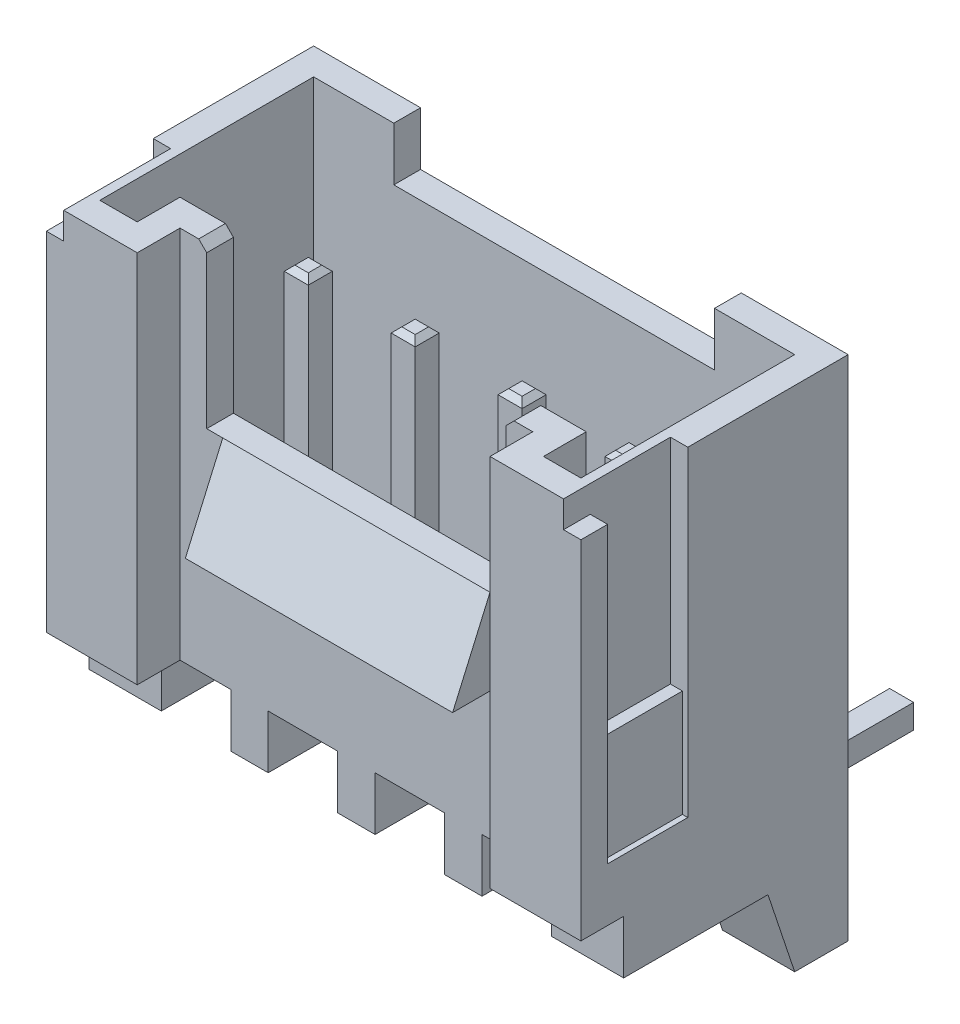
ISO-10303-21;
HEADER;
FILE_DESCRIPTION(('STEP AP214'),'2;1');
FILE_NAME('part.step','',(''),(''),'','','');
FILE_SCHEMA(('AUTOMOTIVE_DESIGN { 1 0 10303 214 1 1 1 1 }'));
ENDSEC;
DATA;
#1=APPLICATION_CONTEXT('core data for automotive mechanical design processes');
#2=APPLICATION_PROTOCOL_DEFINITION('international standard','automotive_design',2000,#1);
#3=PRODUCT_CONTEXT('',#1,'mechanical');
#4=PRODUCT('Part','Part','',(#3));
#5=PRODUCT_RELATED_PRODUCT_CATEGORY('part','',(#4));
#6=PRODUCT_DEFINITION_FORMATION('','',#4);
#7=PRODUCT_DEFINITION_CONTEXT('part definition',#1,'design');
#8=PRODUCT_DEFINITION('design','',#6,#7);
#9=PRODUCT_DEFINITION_SHAPE('','',#8);
#10=(LENGTH_UNIT() NAMED_UNIT(*) SI_UNIT(.MILLI.,.METRE.));
#11=(NAMED_UNIT(*) PLANE_ANGLE_UNIT() SI_UNIT($,.RADIAN.));
#12=(NAMED_UNIT(*) SI_UNIT($,.STERADIAN.) SOLID_ANGLE_UNIT());
#13=UNCERTAINTY_MEASURE_WITH_UNIT(LENGTH_MEASURE(1.E-05),#10,'distance_accuracy_value','');
#14=(GEOMETRIC_REPRESENTATION_CONTEXT(3) GLOBAL_UNCERTAINTY_ASSIGNED_CONTEXT((#13)) GLOBAL_UNIT_ASSIGNED_CONTEXT((#10,
#11,#12)) REPRESENTATION_CONTEXT('',''));
#15=CARTESIAN_POINT('',(0.,0.,0.));
#16=DIRECTION('',(0.,0.,1.));
#17=DIRECTION('',(1.,0.,0.));
#18=AXIS2_PLACEMENT_3D('',#15,#16,#17);
#19=CARTESIAN_POINT('',(-3.225,-0.021727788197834,-3.07595866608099));
#20=DIRECTION('',(0.,-1.,0.));
#21=DIRECTION('',(0.,0.,-1.));
#22=AXIS2_PLACEMENT_3D('',#19,#20,#21);
#23=PLANE('',#22);
#24=DIRECTION('',(0.,0.,-1.));
#25=VECTOR('',#24,1.);
#26=CARTESIAN_POINT('',(-2.775,-0.021727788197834,-3.07595866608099));
#27=LINE('',#26,#25);
#28=CARTESIAN_POINT('',(-2.775,-0.021727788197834,-3.125));
#29=VERTEX_POINT('',#28);
#30=CARTESIAN_POINT('',(-2.775,-0.0217277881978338,-8.));
#31=VERTEX_POINT('',#30);
#32=EDGE_CURVE('E133',#29,#31,#27,.T.);
#33=ORIENTED_EDGE('',*,*,#32,.T.);
#34=DIRECTION('',(1.,0.,0.));
#35=VECTOR('',#34,1.);
#36=CARTESIAN_POINT('',(-3.225,-0.0217277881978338,-8.));
#37=LINE('',#36,#35);
#38=CARTESIAN_POINT('',(-3.225,-0.0217277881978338,-8.));
#39=VERTEX_POINT('',#38);
#40=EDGE_CURVE('E131',#39,#31,#37,.T.);
#41=ORIENTED_EDGE('',*,*,#40,.F.);
#42=DIRECTION('',(0.,0.,-1.));
#43=VECTOR('',#42,1.);
#44=CARTESIAN_POINT('',(-3.225,-0.021727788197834,-3.07595866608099));
#45=LINE('',#44,#43);
#46=CARTESIAN_POINT('',(-3.225,-0.021727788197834,-3.125));
#47=VERTEX_POINT('',#46);
#48=EDGE_CURVE('E117',#47,#39,#45,.T.);
#49=ORIENTED_EDGE('',*,*,#48,.F.);
#50=DIRECTION('',(1.,0.,0.));
#51=VECTOR('',#50,1.);
#52=CARTESIAN_POINT('',(-3.225,-0.021727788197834,-3.125));
#53=LINE('',#52,#51);
#54=EDGE_CURVE('E151',#47,#29,#53,.T.);
#55=ORIENTED_EDGE('',*,*,#54,.T.);
#56=EDGE_LOOP('',(#33,#41,#49,#55));
#57=FACE_BOUND('',#56,.T.);
#58=ADVANCED_FACE('F46',(#57),#23,.F.);
#59=CARTESIAN_POINT('',(-3.225,-0.471727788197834,-8.));
#60=DIRECTION('',(0.,0.,-1.));
#61=DIRECTION('',(-1.,0.,0.));
#62=AXIS2_PLACEMENT_3D('',#59,#60,#61);
#63=PLANE('',#62);
#64=DIRECTION('',(0.,1.,0.));
#65=VECTOR('',#64,1.);
#66=CARTESIAN_POINT('',(-2.775,-0.471727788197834,-8.));
#67=LINE('',#66,#65);
#68=CARTESIAN_POINT('',(-2.775,-0.471727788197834,-8.));
#69=VERTEX_POINT('',#68);
#70=EDGE_CURVE('E153',#69,#31,#67,.T.);
#71=ORIENTED_EDGE('',*,*,#70,.F.);
#72=DIRECTION('',(1.,0.,0.));
#73=VECTOR('',#72,1.);
#74=CARTESIAN_POINT('',(-3.225,-0.471727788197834,-8.));
#75=LINE('',#74,#73);
#76=CARTESIAN_POINT('',(-3.225,-0.471727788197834,-8.));
#77=VERTEX_POINT('',#76);
#78=EDGE_CURVE('E138',#77,#69,#75,.T.);
#79=ORIENTED_EDGE('',*,*,#78,.F.);
#80=DIRECTION('',(0.,1.,0.));
#81=VECTOR('',#80,1.);
#82=CARTESIAN_POINT('',(-3.225,-0.471727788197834,-8.));
#83=LINE('',#82,#81);
#84=EDGE_CURVE('E122',#77,#39,#83,.T.);
#85=ORIENTED_EDGE('',*,*,#84,.T.);
#86=ORIENTED_EDGE('',*,*,#40,.T.);
#87=EDGE_LOOP('',(#71,#79,#85,#86));
#88=FACE_BOUND('',#87,.T.);
#89=ADVANCED_FACE('F140',(#88),#63,.T.);
#90=CARTESIAN_POINT('',(-3.225,-0.471727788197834,-3.07595866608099));
#91=DIRECTION('',(0.,-1.,0.));
#92=DIRECTION('',(0.,0.,-1.));
#93=AXIS2_PLACEMENT_3D('',#90,#91,#92);
#94=PLANE('',#93);
#95=DIRECTION('',(0.,0.,-1.));
#96=VECTOR('',#95,1.);
#97=CARTESIAN_POINT('',(-2.775,-0.471727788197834,-3.07595866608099));
#98=LINE('',#97,#96);
#99=CARTESIAN_POINT('',(-2.775,-0.471727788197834,-3.05543442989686));
#100=VERTEX_POINT('',#99);
#101=EDGE_CURVE('E155',#100,#69,#98,.T.);
#102=ORIENTED_EDGE('',*,*,#101,.F.);
#103=DIRECTION('',(1.,0.,0.));
#104=VECTOR('',#103,1.);
#105=CARTESIAN_POINT('',(-3.225,-0.471727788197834,-3.05543442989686));
#106=LINE('',#105,#104);
#107=CARTESIAN_POINT('',(-3.225,-0.471727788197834,-3.05543442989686));
#108=VERTEX_POINT('',#107);
#109=EDGE_CURVE('E168',#108,#100,#106,.T.);
#110=ORIENTED_EDGE('',*,*,#109,.F.);
#111=DIRECTION('',(0.,0.,-1.));
#112=VECTOR('',#111,1.);
#113=CARTESIAN_POINT('',(-3.225,-0.471727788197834,-3.07595866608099));
#114=LINE('',#113,#112);
#115=EDGE_CURVE('E141',#108,#77,#114,.T.);
#116=ORIENTED_EDGE('',*,*,#115,.T.);
#117=ORIENTED_EDGE('',*,*,#78,.T.);
#118=EDGE_LOOP('',(#102,#110,#116,#117));
#119=FACE_BOUND('',#118,.T.);
#120=ADVANCED_FACE('F231',(#119),#94,.T.);
#121=CARTESIAN_POINT('',(-3.225,-0.0271373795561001,-3.125));
#122=DIRECTION('',(1.,0.,0.));
#123=DIRECTION('',(0.,0.,-1.));
#124=AXIS2_PLACEMENT_3D('',#121,#122,#123);
#125=CYLINDRICAL_SURFACE('',#124,0.45);
#126=CARTESIAN_POINT('',(-2.775,-0.0271373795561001,-3.125));
#127=DIRECTION('',(-1.,0.,0.));
#128=DIRECTION('',(0.,0.,1.));
#129=AXIS2_PLACEMENT_3D('',#126,#127,#128);
#130=CIRCLE('',#129,0.45);
#131=CARTESIAN_POINT('',(-2.775,-0.0271373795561,-2.675));
#132=VERTEX_POINT('',#131);
#133=EDGE_CURVE('E158',#132,#100,#130,.F.);
#134=ORIENTED_EDGE('',*,*,#133,.F.);
#135=DIRECTION('',(1.,0.,0.));
#136=VECTOR('',#135,1.);
#137=CARTESIAN_POINT('',(-3.225,-0.0271373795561,-2.675));
#138=LINE('',#137,#136);
#139=CARTESIAN_POINT('',(-3.225,-0.0271373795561,-2.675));
#140=VERTEX_POINT('',#139);
#141=EDGE_CURVE('E165',#140,#132,#138,.T.);
#142=ORIENTED_EDGE('',*,*,#141,.F.);
#143=CARTESIAN_POINT('',(-3.225,-0.0271373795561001,-3.125));
#144=DIRECTION('',(-1.,0.,0.));
#145=DIRECTION('',(0.,0.,1.));
#146=AXIS2_PLACEMENT_3D('',#143,#144,#145);
#147=CIRCLE('',#146,0.45);
#148=EDGE_CURVE('E143',#140,#108,#147,.F.);
#149=ORIENTED_EDGE('',*,*,#148,.T.);
#150=ORIENTED_EDGE('',*,*,#109,.T.);
#151=EDGE_LOOP('',(#134,#142,#149,#150));
#152=FACE_BOUND('',#151,.T.);
#153=ADVANCED_FACE('F224',(#152),#125,.T.);
#154=CARTESIAN_POINT('',(-3.225,6.5,-2.675));
#155=DIRECTION('',(0.,0.,1.));
#156=DIRECTION('',(0.,-1.,0.));
#157=AXIS2_PLACEMENT_3D('',#154,#155,#156);
#158=PLANE('',#157);
#159=DIRECTION('',(0.,-1.,0.));
#160=VECTOR('',#159,1.);
#161=CARTESIAN_POINT('',(-2.775,6.5,-2.675));
#162=LINE('',#161,#160);
#163=CARTESIAN_POINT('',(-2.775,6.4,-2.675));
#164=VERTEX_POINT('',#163);
#165=EDGE_CURVE('E161',#164,#132,#162,.T.);
#166=ORIENTED_EDGE('',*,*,#165,.F.);
#167=DIRECTION('',(-1.,0.,0.));
#168=VECTOR('',#167,1.);
#169=CARTESIAN_POINT('',(-3.225,6.4,-2.675));
#170=LINE('',#169,#168);
#171=CARTESIAN_POINT('',(-3.225,6.4,-2.675));
#172=VERTEX_POINT('',#171);
#173=EDGE_CURVE('E179',#164,#172,#170,.T.);
#174=ORIENTED_EDGE('',*,*,#173,.T.);
#175=DIRECTION('',(0.,-1.,0.));
#176=VECTOR('',#175,1.);
#177=CARTESIAN_POINT('',(-3.225,6.5,-2.675));
#178=LINE('',#177,#176);
#179=EDGE_CURVE('E148',#172,#140,#178,.T.);
#180=ORIENTED_EDGE('',*,*,#179,.T.);
#181=ORIENTED_EDGE('',*,*,#141,.T.);
#182=EDGE_LOOP('',(#166,#174,#180,#181));
#183=FACE_BOUND('',#182,.T.);
#184=ADVANCED_FACE('F208',(#183),#158,.T.);
#185=CARTESIAN_POINT('',(-3.225,6.5,-3.125));
#186=DIRECTION('',(0.,1.,0.));
#187=DIRECTION('',(0.,0.,1.));
#188=AXIS2_PLACEMENT_3D('',#185,#186,#187);
#189=PLANE('',#188);
#190=DIRECTION('',(0.,0.,1.));
#191=VECTOR('',#190,1.);
#192=CARTESIAN_POINT('',(-3.125,6.5,-3.125));
#193=LINE('',#192,#191);
#194=CARTESIAN_POINT('',(-3.125,6.5,-3.025));
#195=VERTEX_POINT('',#194);
#196=CARTESIAN_POINT('',(-3.125,6.5,-2.775));
#197=VERTEX_POINT('',#196);
#198=EDGE_CURVE('E174',#195,#197,#193,.T.);
#199=ORIENTED_EDGE('',*,*,#198,.T.);
#200=DIRECTION('',(1.,0.,0.));
#201=VECTOR('',#200,1.);
#202=CARTESIAN_POINT('',(-3.225,6.5,-2.775));
#203=LINE('',#202,#201);
#204=CARTESIAN_POINT('',(-2.875,6.5,-2.775));
#205=VERTEX_POINT('',#204);
#206=EDGE_CURVE('E176',#197,#205,#203,.T.);
#207=ORIENTED_EDGE('',*,*,#206,.T.);
#208=DIRECTION('',(0.,0.,-1.));
#209=VECTOR('',#208,1.);
#210=CARTESIAN_POINT('',(-2.875,6.5,-3.125));
#211=LINE('',#210,#209);
#212=CARTESIAN_POINT('',(-2.875,6.5,-3.025));
#213=VERTEX_POINT('',#212);
#214=EDGE_CURVE('E137',#205,#213,#211,.T.);
#215=ORIENTED_EDGE('',*,*,#214,.T.);
#216=DIRECTION('',(-1.,0.,0.));
#217=VECTOR('',#216,1.);
#218=CARTESIAN_POINT('',(-3.225,6.5,-3.025));
#219=LINE('',#218,#217);
#220=EDGE_CURVE('E172',#213,#195,#219,.T.);
#221=ORIENTED_EDGE('',*,*,#220,.T.);
#222=EDGE_LOOP('',(#199,#207,#215,#221));
#223=FACE_BOUND('',#222,.T.);
#224=ADVANCED_FACE('F215',(#223),#189,.T.);
#225=CARTESIAN_POINT('',(-3.225,6.5,-3.125));
#226=DIRECTION('',(0.,0.,1.));
#227=DIRECTION('',(0.,-1.,0.));
#228=AXIS2_PLACEMENT_3D('',#225,#226,#227);
#229=PLANE('',#228);
#230=DIRECTION('',(0.,-1.,0.));
#231=VECTOR('',#230,1.);
#232=CARTESIAN_POINT('',(-3.225,6.5,-3.125));
#233=LINE('',#232,#231);
#234=CARTESIAN_POINT('',(-3.225,6.4,-3.125));
#235=VERTEX_POINT('',#234);
#236=EDGE_CURVE('E124',#235,#47,#233,.T.);
#237=ORIENTED_EDGE('',*,*,#236,.F.);
#238=DIRECTION('',(1.,0.,0.));
#239=VECTOR('',#238,1.);
#240=CARTESIAN_POINT('',(-2.775,6.4,-3.125));
#241=LINE('',#240,#239);
#242=CARTESIAN_POINT('',(-2.775,6.4,-3.125));
#243=VERTEX_POINT('',#242);
#244=EDGE_CURVE('E55',#235,#243,#241,.T.);
#245=ORIENTED_EDGE('',*,*,#244,.T.);
#246=DIRECTION('',(0.,-1.,0.));
#247=VECTOR('',#246,1.);
#248=CARTESIAN_POINT('',(-2.775,6.5,-3.125));
#249=LINE('',#248,#247);
#250=EDGE_CURVE('E128',#243,#29,#249,.T.);
#251=ORIENTED_EDGE('',*,*,#250,.T.);
#252=ORIENTED_EDGE('',*,*,#54,.F.);
#253=EDGE_LOOP('',(#237,#245,#251,#252));
#254=FACE_BOUND('',#253,.T.);
#255=ADVANCED_FACE('F217',(#254),#229,.F.);
#256=CARTESIAN_POINT('',(-3.225,-0.0271373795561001,-3.125));
#257=DIRECTION('',(-1.,0.,0.));
#258=DIRECTION('',(0.,0.,1.));
#259=AXIS2_PLACEMENT_3D('',#256,#257,#258);
#260=PLANE('',#259);
#261=ORIENTED_EDGE('',*,*,#179,.F.);
#262=DIRECTION('',(0.,0.,-1.));
#263=VECTOR('',#262,1.);
#264=CARTESIAN_POINT('',(-3.225,6.4,-3.125));
#265=LINE('',#264,#263);
#266=EDGE_CURVE('E70',#172,#235,#265,.T.);
#267=ORIENTED_EDGE('',*,*,#266,.T.);
#268=ORIENTED_EDGE('',*,*,#236,.T.);
#269=ORIENTED_EDGE('',*,*,#48,.T.);
#270=ORIENTED_EDGE('',*,*,#84,.F.);
#271=ORIENTED_EDGE('',*,*,#115,.F.);
#272=ORIENTED_EDGE('',*,*,#148,.F.);
#273=EDGE_LOOP('',(#261,#267,#268,#269,#270,#271,#272));
#274=FACE_BOUND('',#273,.T.);
#275=ADVANCED_FACE('F119',(#274),#260,.T.);
#276=CARTESIAN_POINT('',(-2.775,-0.0271373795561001,-3.125));
#277=DIRECTION('',(-1.,0.,0.));
#278=DIRECTION('',(0.,0.,1.));
#279=AXIS2_PLACEMENT_3D('',#276,#277,#278);
#280=PLANE('',#279);
#281=ORIENTED_EDGE('',*,*,#250,.F.);
#282=DIRECTION('',(0.,0.,1.));
#283=VECTOR('',#282,1.);
#284=CARTESIAN_POINT('',(-2.775,6.4,-2.675));
#285=LINE('',#284,#283);
#286=EDGE_CURVE('E12',#243,#164,#285,.T.);
#287=ORIENTED_EDGE('',*,*,#286,.T.);
#288=ORIENTED_EDGE('',*,*,#165,.T.);
#289=ORIENTED_EDGE('',*,*,#133,.T.);
#290=ORIENTED_EDGE('',*,*,#101,.T.);
#291=ORIENTED_EDGE('',*,*,#70,.T.);
#292=ORIENTED_EDGE('',*,*,#32,.F.);
#293=EDGE_LOOP('',(#281,#287,#288,#289,#290,#291,#292));
#294=FACE_BOUND('',#293,.T.);
#295=ADVANCED_FACE('F205',(#294),#280,.F.);
#296=CARTESIAN_POINT('',(-3.225,6.4,-3.125));
#297=DIRECTION('',(0.,0.707106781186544,-0.707106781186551));
#298=DIRECTION('',(-1.,0.,0.));
#299=AXIS2_PLACEMENT_3D('',#296,#297,#298);
#300=PLANE('',#299);
#301=DIRECTION('',(-0.577350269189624,0.577350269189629,0.577350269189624));
#302=VECTOR('',#301,1.);
#303=CARTESIAN_POINT('',(-2.775,6.4,-3.125));
#304=LINE('',#303,#302);
#305=EDGE_CURVE('E187',#243,#213,#304,.T.);
#306=ORIENTED_EDGE('',*,*,#305,.F.);
#307=ORIENTED_EDGE('',*,*,#244,.F.);
#308=DIRECTION('',(-0.577350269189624,-0.577350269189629,-0.577350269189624));
#309=VECTOR('',#308,1.);
#310=CARTESIAN_POINT('',(-3.225,6.4,-3.125));
#311=LINE('',#310,#309);
#312=EDGE_CURVE('E50',#195,#235,#311,.T.);
#313=ORIENTED_EDGE('',*,*,#312,.F.);
#314=ORIENTED_EDGE('',*,*,#220,.F.);
#315=EDGE_LOOP('',(#306,#307,#313,#314));
#316=FACE_BOUND('',#315,.T.);
#317=ADVANCED_FACE('F48',(#316),#300,.T.);
#318=CARTESIAN_POINT('',(-3.125,6.5,-3.125));
#319=DIRECTION('',(0.707106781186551,-0.707106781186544,0.));
#320=DIRECTION('',(0.,0.,1.));
#321=AXIS2_PLACEMENT_3D('',#318,#319,#320);
#322=PLANE('',#321);
#323=ORIENTED_EDGE('',*,*,#312,.T.);
#324=ORIENTED_EDGE('',*,*,#266,.F.);
#325=DIRECTION('',(0.577350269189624,0.577350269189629,-0.577350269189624));
#326=VECTOR('',#325,1.);
#327=CARTESIAN_POINT('',(-3.00833333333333,6.61666666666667,-2.89166666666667));
#328=LINE('',#327,#326);
#329=EDGE_CURVE('E186',#197,#172,#328,.F.);
#330=ORIENTED_EDGE('',*,*,#329,.F.);
#331=ORIENTED_EDGE('',*,*,#198,.F.);
#332=EDGE_LOOP('',(#323,#324,#330,#331));
#333=FACE_BOUND('',#332,.T.);
#334=ADVANCED_FACE('F197',(#333),#322,.F.);
#335=CARTESIAN_POINT('',(-2.775,6.4,-3.125));
#336=DIRECTION('',(0.707106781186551,0.707106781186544,0.));
#337=DIRECTION('',(0.,0.,-1.));
#338=AXIS2_PLACEMENT_3D('',#335,#336,#337);
#339=PLANE('',#338);
#340=ORIENTED_EDGE('',*,*,#305,.T.);
#341=ORIENTED_EDGE('',*,*,#214,.F.);
#342=DIRECTION('',(-0.577350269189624,0.577350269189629,-0.577350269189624));
#343=VECTOR('',#342,1.);
#344=CARTESIAN_POINT('',(-2.925,6.55,-2.825));
#345=LINE('',#344,#343);
#346=EDGE_CURVE('E184',#164,#205,#345,.T.);
#347=ORIENTED_EDGE('',*,*,#346,.F.);
#348=ORIENTED_EDGE('',*,*,#286,.F.);
#349=EDGE_LOOP('',(#340,#341,#347,#348));
#350=FACE_BOUND('',#349,.T.);
#351=ADVANCED_FACE('F202',(#350),#339,.T.);
#352=CARTESIAN_POINT('',(-3.225,6.5,-2.775));
#353=DIRECTION('',(0.,-0.707106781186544,-0.707106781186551));
#354=DIRECTION('',(1.,0.,0.));
#355=AXIS2_PLACEMENT_3D('',#352,#353,#354);
#356=PLANE('',#355);
#357=ORIENTED_EDGE('',*,*,#329,.T.);
#358=ORIENTED_EDGE('',*,*,#173,.F.);
#359=ORIENTED_EDGE('',*,*,#346,.T.);
#360=ORIENTED_EDGE('',*,*,#206,.F.);
#361=EDGE_LOOP('',(#357,#358,#359,#360));
#362=FACE_BOUND('',#361,.T.);
#363=ADVANCED_FACE('F212',(#362),#356,.F.);
#364=CLOSED_SHELL('',(#58,#89,#120,#153,#184,#224,#255,#275,#295,#317,#334,#351,#363));
#365=MANIFOLD_SOLID_BREP('B2',#364);
#366=CARTESIAN_POINT('',(-1.225,-0.021727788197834,-3.07595866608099));
#367=DIRECTION('',(0.,-1.,0.));
#368=DIRECTION('',(0.,0.,-1.));
#369=AXIS2_PLACEMENT_3D('',#366,#367,#368);
#370=PLANE('',#369);
#371=DIRECTION('',(0.,0.,-1.));
#372=VECTOR('',#371,1.);
#373=CARTESIAN_POINT('',(-0.775,-0.021727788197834,-3.07595866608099));
#374=LINE('',#373,#372);
#375=CARTESIAN_POINT('',(-0.775,-0.021727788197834,-3.125));
#376=VERTEX_POINT('',#375);
#377=CARTESIAN_POINT('',(-0.775,-0.0217277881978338,-8.));
#378=VERTEX_POINT('',#377);
#379=EDGE_CURVE('E443',#376,#378,#374,.T.);
#380=ORIENTED_EDGE('',*,*,#379,.T.);
#381=DIRECTION('',(1.,0.,0.));
#382=VECTOR('',#381,1.);
#383=CARTESIAN_POINT('',(-1.225,-0.0217277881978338,-8.));
#384=LINE('',#383,#382);
#385=CARTESIAN_POINT('',(-1.225,-0.0217277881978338,-8.));
#386=VERTEX_POINT('',#385);
#387=EDGE_CURVE('E441',#386,#378,#384,.T.);
#388=ORIENTED_EDGE('',*,*,#387,.F.);
#389=DIRECTION('',(0.,0.,-1.));
#390=VECTOR('',#389,1.);
#391=CARTESIAN_POINT('',(-1.225,-0.021727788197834,-3.07595866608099));
#392=LINE('',#391,#390);
#393=CARTESIAN_POINT('',(-1.225,-0.021727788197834,-3.125));
#394=VERTEX_POINT('',#393);
#395=EDGE_CURVE('E427',#394,#386,#392,.T.);
#396=ORIENTED_EDGE('',*,*,#395,.F.);
#397=DIRECTION('',(1.,0.,0.));
#398=VECTOR('',#397,1.);
#399=CARTESIAN_POINT('',(-1.225,-0.021727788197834,-3.125));
#400=LINE('',#399,#398);
#401=EDGE_CURVE('E461',#394,#376,#400,.T.);
#402=ORIENTED_EDGE('',*,*,#401,.T.);
#403=EDGE_LOOP('',(#380,#388,#396,#402));
#404=FACE_BOUND('',#403,.T.);
#405=ADVANCED_FACE('F356',(#404),#370,.F.);
#406=CARTESIAN_POINT('',(-1.225,-0.471727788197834,-8.));
#407=DIRECTION('',(0.,0.,-1.));
#408=DIRECTION('',(-1.,0.,0.));
#409=AXIS2_PLACEMENT_3D('',#406,#407,#408);
#410=PLANE('',#409);
#411=DIRECTION('',(0.,1.,0.));
#412=VECTOR('',#411,1.);
#413=CARTESIAN_POINT('',(-0.775,-0.471727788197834,-8.));
#414=LINE('',#413,#412);
#415=CARTESIAN_POINT('',(-0.775,-0.471727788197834,-8.));
#416=VERTEX_POINT('',#415);
#417=EDGE_CURVE('E463',#416,#378,#414,.T.);
#418=ORIENTED_EDGE('',*,*,#417,.F.);
#419=DIRECTION('',(1.,0.,0.));
#420=VECTOR('',#419,1.);
#421=CARTESIAN_POINT('',(-1.225,-0.471727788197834,-8.));
#422=LINE('',#421,#420);
#423=CARTESIAN_POINT('',(-1.225,-0.471727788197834,-8.));
#424=VERTEX_POINT('',#423);
#425=EDGE_CURVE('E448',#424,#416,#422,.T.);
#426=ORIENTED_EDGE('',*,*,#425,.F.);
#427=DIRECTION('',(0.,1.,0.));
#428=VECTOR('',#427,1.);
#429=CARTESIAN_POINT('',(-1.225,-0.471727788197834,-8.));
#430=LINE('',#429,#428);
#431=EDGE_CURVE('E432',#424,#386,#430,.T.);
#432=ORIENTED_EDGE('',*,*,#431,.T.);
#433=ORIENTED_EDGE('',*,*,#387,.T.);
#434=EDGE_LOOP('',(#418,#426,#432,#433));
#435=FACE_BOUND('',#434,.T.);
#436=ADVANCED_FACE('F450',(#435),#410,.T.);
#437=CARTESIAN_POINT('',(-1.225,-0.471727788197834,-3.07595866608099));
#438=DIRECTION('',(0.,-1.,0.));
#439=DIRECTION('',(0.,0.,-1.));
#440=AXIS2_PLACEMENT_3D('',#437,#438,#439);
#441=PLANE('',#440);
#442=DIRECTION('',(0.,0.,-1.));
#443=VECTOR('',#442,1.);
#444=CARTESIAN_POINT('',(-0.775,-0.471727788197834,-3.07595866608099));
#445=LINE('',#444,#443);
#446=CARTESIAN_POINT('',(-0.775,-0.471727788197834,-3.05543442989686));
#447=VERTEX_POINT('',#446);
#448=EDGE_CURVE('E465',#447,#416,#445,.T.);
#449=ORIENTED_EDGE('',*,*,#448,.F.);
#450=DIRECTION('',(1.,0.,0.));
#451=VECTOR('',#450,1.);
#452=CARTESIAN_POINT('',(-1.225,-0.471727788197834,-3.05543442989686));
#453=LINE('',#452,#451);
#454=CARTESIAN_POINT('',(-1.225,-0.471727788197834,-3.05543442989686));
#455=VERTEX_POINT('',#454);
#456=EDGE_CURVE('E478',#455,#447,#453,.T.);
#457=ORIENTED_EDGE('',*,*,#456,.F.);
#458=DIRECTION('',(0.,0.,-1.));
#459=VECTOR('',#458,1.);
#460=CARTESIAN_POINT('',(-1.225,-0.471727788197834,-3.07595866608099));
#461=LINE('',#460,#459);
#462=EDGE_CURVE('E451',#455,#424,#461,.T.);
#463=ORIENTED_EDGE('',*,*,#462,.T.);
#464=ORIENTED_EDGE('',*,*,#425,.T.);
#465=EDGE_LOOP('',(#449,#457,#463,#464));
#466=FACE_BOUND('',#465,.T.);
#467=ADVANCED_FACE('F541',(#466),#441,.T.);
#468=CARTESIAN_POINT('',(-1.225,-0.0271373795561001,-3.125));
#469=DIRECTION('',(1.,0.,0.));
#470=DIRECTION('',(0.,0.,-1.));
#471=AXIS2_PLACEMENT_3D('',#468,#469,#470);
#472=CYLINDRICAL_SURFACE('',#471,0.45);
#473=CARTESIAN_POINT('',(-0.775,-0.0271373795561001,-3.125));
#474=DIRECTION('',(-1.,0.,0.));
#475=DIRECTION('',(0.,0.,1.));
#476=AXIS2_PLACEMENT_3D('',#473,#474,#475);
#477=CIRCLE('',#476,0.45);
#478=CARTESIAN_POINT('',(-0.775,-0.0271373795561,-2.675));
#479=VERTEX_POINT('',#478);
#480=EDGE_CURVE('E468',#479,#447,#477,.F.);
#481=ORIENTED_EDGE('',*,*,#480,.F.);
#482=DIRECTION('',(1.,0.,0.));
#483=VECTOR('',#482,1.);
#484=CARTESIAN_POINT('',(-1.225,-0.0271373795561,-2.675));
#485=LINE('',#484,#483);
#486=CARTESIAN_POINT('',(-1.225,-0.0271373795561,-2.675));
#487=VERTEX_POINT('',#486);
#488=EDGE_CURVE('E475',#487,#479,#485,.T.);
#489=ORIENTED_EDGE('',*,*,#488,.F.);
#490=CARTESIAN_POINT('',(-1.225,-0.0271373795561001,-3.125));
#491=DIRECTION('',(-1.,0.,0.));
#492=DIRECTION('',(0.,0.,1.));
#493=AXIS2_PLACEMENT_3D('',#490,#491,#492);
#494=CIRCLE('',#493,0.45);
#495=EDGE_CURVE('E453',#487,#455,#494,.F.);
#496=ORIENTED_EDGE('',*,*,#495,.T.);
#497=ORIENTED_EDGE('',*,*,#456,.T.);
#498=EDGE_LOOP('',(#481,#489,#496,#497));
#499=FACE_BOUND('',#498,.T.);
#500=ADVANCED_FACE('F534',(#499),#472,.T.);
#501=CARTESIAN_POINT('',(-1.225,6.5,-2.675));
#502=DIRECTION('',(0.,0.,1.));
#503=DIRECTION('',(0.,-1.,0.));
#504=AXIS2_PLACEMENT_3D('',#501,#502,#503);
#505=PLANE('',#504);
#506=DIRECTION('',(0.,-1.,0.));
#507=VECTOR('',#506,1.);
#508=CARTESIAN_POINT('',(-0.775,6.5,-2.675));
#509=LINE('',#508,#507);
#510=CARTESIAN_POINT('',(-0.775,6.4,-2.675));
#511=VERTEX_POINT('',#510);
#512=EDGE_CURVE('E471',#511,#479,#509,.T.);
#513=ORIENTED_EDGE('',*,*,#512,.F.);
#514=DIRECTION('',(-1.,0.,0.));
#515=VECTOR('',#514,1.);
#516=CARTESIAN_POINT('',(-1.225,6.4,-2.675));
#517=LINE('',#516,#515);
#518=CARTESIAN_POINT('',(-1.225,6.4,-2.675));
#519=VERTEX_POINT('',#518);
#520=EDGE_CURVE('E489',#511,#519,#517,.T.);
#521=ORIENTED_EDGE('',*,*,#520,.T.);
#522=DIRECTION('',(0.,-1.,0.));
#523=VECTOR('',#522,1.);
#524=CARTESIAN_POINT('',(-1.225,6.5,-2.675));
#525=LINE('',#524,#523);
#526=EDGE_CURVE('E458',#519,#487,#525,.T.);
#527=ORIENTED_EDGE('',*,*,#526,.T.);
#528=ORIENTED_EDGE('',*,*,#488,.T.);
#529=EDGE_LOOP('',(#513,#521,#527,#528));
#530=FACE_BOUND('',#529,.T.);
#531=ADVANCED_FACE('F518',(#530),#505,.T.);
#532=CARTESIAN_POINT('',(-1.225,6.5,-3.125));
#533=DIRECTION('',(0.,1.,0.));
#534=DIRECTION('',(0.,0.,1.));
#535=AXIS2_PLACEMENT_3D('',#532,#533,#534);
#536=PLANE('',#535);
#537=DIRECTION('',(0.,0.,1.));
#538=VECTOR('',#537,1.);
#539=CARTESIAN_POINT('',(-1.125,6.5,-3.125));
#540=LINE('',#539,#538);
#541=CARTESIAN_POINT('',(-1.125,6.5,-3.025));
#542=VERTEX_POINT('',#541);
#543=CARTESIAN_POINT('',(-1.125,6.5,-2.775));
#544=VERTEX_POINT('',#543);
#545=EDGE_CURVE('E484',#542,#544,#540,.T.);
#546=ORIENTED_EDGE('',*,*,#545,.T.);
#547=DIRECTION('',(1.,0.,0.));
#548=VECTOR('',#547,1.);
#549=CARTESIAN_POINT('',(-1.225,6.5,-2.775));
#550=LINE('',#549,#548);
#551=CARTESIAN_POINT('',(-0.875000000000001,6.5,-2.775));
#552=VERTEX_POINT('',#551);
#553=EDGE_CURVE('E486',#544,#552,#550,.T.);
#554=ORIENTED_EDGE('',*,*,#553,.T.);
#555=DIRECTION('',(0.,0.,-1.));
#556=VECTOR('',#555,1.);
#557=CARTESIAN_POINT('',(-0.875000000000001,6.5,-3.125));
#558=LINE('',#557,#556);
#559=CARTESIAN_POINT('',(-0.875000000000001,6.5,-3.025));
#560=VERTEX_POINT('',#559);
#561=EDGE_CURVE('E447',#552,#560,#558,.T.);
#562=ORIENTED_EDGE('',*,*,#561,.T.);
#563=DIRECTION('',(-1.,0.,0.));
#564=VECTOR('',#563,1.);
#565=CARTESIAN_POINT('',(-1.225,6.5,-3.025));
#566=LINE('',#565,#564);
#567=EDGE_CURVE('E482',#560,#542,#566,.T.);
#568=ORIENTED_EDGE('',*,*,#567,.T.);
#569=EDGE_LOOP('',(#546,#554,#562,#568));
#570=FACE_BOUND('',#569,.T.);
#571=ADVANCED_FACE('F525',(#570),#536,.T.);
#572=CARTESIAN_POINT('',(-1.225,6.5,-3.125));
#573=DIRECTION('',(0.,0.,1.));
#574=DIRECTION('',(0.,-1.,0.));
#575=AXIS2_PLACEMENT_3D('',#572,#573,#574);
#576=PLANE('',#575);
#577=DIRECTION('',(0.,-1.,0.));
#578=VECTOR('',#577,1.);
#579=CARTESIAN_POINT('',(-1.225,6.5,-3.125));
#580=LINE('',#579,#578);
#581=CARTESIAN_POINT('',(-1.225,6.4,-3.125));
#582=VERTEX_POINT('',#581);
#583=EDGE_CURVE('E434',#582,#394,#580,.T.);
#584=ORIENTED_EDGE('',*,*,#583,.F.);
#585=DIRECTION('',(1.,0.,0.));
#586=VECTOR('',#585,1.);
#587=CARTESIAN_POINT('',(-0.775,6.4,-3.125));
#588=LINE('',#587,#586);
#589=CARTESIAN_POINT('',(-0.775,6.4,-3.125));
#590=VERTEX_POINT('',#589);
#591=EDGE_CURVE('E365',#582,#590,#588,.T.);
#592=ORIENTED_EDGE('',*,*,#591,.T.);
#593=DIRECTION('',(0.,-1.,0.));
#594=VECTOR('',#593,1.);
#595=CARTESIAN_POINT('',(-0.775,6.5,-3.125));
#596=LINE('',#595,#594);
#597=EDGE_CURVE('E438',#590,#376,#596,.T.);
#598=ORIENTED_EDGE('',*,*,#597,.T.);
#599=ORIENTED_EDGE('',*,*,#401,.F.);
#600=EDGE_LOOP('',(#584,#592,#598,#599));
#601=FACE_BOUND('',#600,.T.);
#602=ADVANCED_FACE('F527',(#601),#576,.F.);
#603=CARTESIAN_POINT('',(-1.225,-0.0271373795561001,-3.125));
#604=DIRECTION('',(-1.,0.,0.));
#605=DIRECTION('',(0.,0.,1.));
#606=AXIS2_PLACEMENT_3D('',#603,#604,#605);
#607=PLANE('',#606);
#608=ORIENTED_EDGE('',*,*,#526,.F.);
#609=DIRECTION('',(0.,0.,-1.));
#610=VECTOR('',#609,1.);
#611=CARTESIAN_POINT('',(-1.225,6.4,-3.125));
#612=LINE('',#611,#610);
#613=EDGE_CURVE('E380',#519,#582,#612,.T.);
#614=ORIENTED_EDGE('',*,*,#613,.T.);
#615=ORIENTED_EDGE('',*,*,#583,.T.);
#616=ORIENTED_EDGE('',*,*,#395,.T.);
#617=ORIENTED_EDGE('',*,*,#431,.F.);
#618=ORIENTED_EDGE('',*,*,#462,.F.);
#619=ORIENTED_EDGE('',*,*,#495,.F.);
#620=EDGE_LOOP('',(#608,#614,#615,#616,#617,#618,#619));
#621=FACE_BOUND('',#620,.T.);
#622=ADVANCED_FACE('F429',(#621),#607,.T.);
#623=CARTESIAN_POINT('',(-0.775,-0.0271373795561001,-3.125));
#624=DIRECTION('',(-1.,0.,0.));
#625=DIRECTION('',(0.,0.,1.));
#626=AXIS2_PLACEMENT_3D('',#623,#624,#625);
#627=PLANE('',#626);
#628=ORIENTED_EDGE('',*,*,#597,.F.);
#629=DIRECTION('',(0.,0.,1.));
#630=VECTOR('',#629,1.);
#631=CARTESIAN_POINT('',(-0.775,6.4,-2.675));
#632=LINE('',#631,#630);
#633=EDGE_CURVE('E44',#590,#511,#632,.T.);
#634=ORIENTED_EDGE('',*,*,#633,.T.);
#635=ORIENTED_EDGE('',*,*,#512,.T.);
#636=ORIENTED_EDGE('',*,*,#480,.T.);
#637=ORIENTED_EDGE('',*,*,#448,.T.);
#638=ORIENTED_EDGE('',*,*,#417,.T.);
#639=ORIENTED_EDGE('',*,*,#379,.F.);
#640=EDGE_LOOP('',(#628,#634,#635,#636,#637,#638,#639));
#641=FACE_BOUND('',#640,.T.);
#642=ADVANCED_FACE('F515',(#641),#627,.F.);
#643=CARTESIAN_POINT('',(-1.225,6.4,-3.125));
#644=DIRECTION('',(0.,0.707106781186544,-0.707106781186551));
#645=DIRECTION('',(-1.,0.,0.));
#646=AXIS2_PLACEMENT_3D('',#643,#644,#645);
#647=PLANE('',#646);
#648=DIRECTION('',(-0.577350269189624,0.577350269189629,0.577350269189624));
#649=VECTOR('',#648,1.);
#650=CARTESIAN_POINT('',(-0.775,6.4,-3.125));
#651=LINE('',#650,#649);
#652=EDGE_CURVE('E497',#590,#560,#651,.T.);
#653=ORIENTED_EDGE('',*,*,#652,.F.);
#654=ORIENTED_EDGE('',*,*,#591,.F.);
#655=DIRECTION('',(-0.577350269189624,-0.577350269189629,-0.577350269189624));
#656=VECTOR('',#655,1.);
#657=CARTESIAN_POINT('',(-1.225,6.4,-3.125));
#658=LINE('',#657,#656);
#659=EDGE_CURVE('E360',#542,#582,#658,.T.);
#660=ORIENTED_EDGE('',*,*,#659,.F.);
#661=ORIENTED_EDGE('',*,*,#567,.F.);
#662=EDGE_LOOP('',(#653,#654,#660,#661));
#663=FACE_BOUND('',#662,.T.);
#664=ADVANCED_FACE('F358',(#663),#647,.T.);
#665=CARTESIAN_POINT('',(-1.125,6.5,-3.125));
#666=DIRECTION('',(0.707106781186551,-0.707106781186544,0.));
#667=DIRECTION('',(0.,0.,1.));
#668=AXIS2_PLACEMENT_3D('',#665,#666,#667);
#669=PLANE('',#668);
#670=ORIENTED_EDGE('',*,*,#659,.T.);
#671=ORIENTED_EDGE('',*,*,#613,.F.);
#672=DIRECTION('',(0.577350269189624,0.577350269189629,-0.577350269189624));
#673=VECTOR('',#672,1.);
#674=CARTESIAN_POINT('',(-1.00833333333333,6.61666666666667,-2.89166666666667));
#675=LINE('',#674,#673);
#676=EDGE_CURVE('E496',#544,#519,#675,.F.);
#677=ORIENTED_EDGE('',*,*,#676,.F.);
#678=ORIENTED_EDGE('',*,*,#545,.F.);
#679=EDGE_LOOP('',(#670,#671,#677,#678));
#680=FACE_BOUND('',#679,.T.);
#681=ADVANCED_FACE('F507',(#680),#669,.F.);
#682=CARTESIAN_POINT('',(-0.775,6.4,-3.125));
#683=DIRECTION('',(0.707106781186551,0.707106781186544,0.));
#684=DIRECTION('',(0.,0.,-1.));
#685=AXIS2_PLACEMENT_3D('',#682,#683,#684);
#686=PLANE('',#685);
#687=ORIENTED_EDGE('',*,*,#652,.T.);
#688=ORIENTED_EDGE('',*,*,#561,.F.);
#689=DIRECTION('',(-0.577350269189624,0.577350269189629,-0.577350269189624));
#690=VECTOR('',#689,1.);
#691=CARTESIAN_POINT('',(-0.924999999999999,6.55,-2.825));
#692=LINE('',#691,#690);
#693=EDGE_CURVE('E494',#511,#552,#692,.T.);
#694=ORIENTED_EDGE('',*,*,#693,.F.);
#695=ORIENTED_EDGE('',*,*,#633,.F.);
#696=EDGE_LOOP('',(#687,#688,#694,#695));
#697=FACE_BOUND('',#696,.T.);
#698=ADVANCED_FACE('F512',(#697),#686,.T.);
#699=CARTESIAN_POINT('',(-1.225,6.5,-2.775));
#700=DIRECTION('',(0.,-0.707106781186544,-0.707106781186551));
#701=DIRECTION('',(1.,0.,0.));
#702=AXIS2_PLACEMENT_3D('',#699,#700,#701);
#703=PLANE('',#702);
#704=ORIENTED_EDGE('',*,*,#676,.T.);
#705=ORIENTED_EDGE('',*,*,#520,.F.);
#706=ORIENTED_EDGE('',*,*,#693,.T.);
#707=ORIENTED_EDGE('',*,*,#553,.F.);
#708=EDGE_LOOP('',(#704,#705,#706,#707));
#709=FACE_BOUND('',#708,.T.);
#710=ADVANCED_FACE('F522',(#709),#703,.F.);
#711=CLOSED_SHELL('',(#405,#436,#467,#500,#531,#571,#602,#622,#642,#664,#681,#698,#710));
#712=MANIFOLD_SOLID_BREP('B6',#711);
#713=CARTESIAN_POINT('',(0.775,-0.021727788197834,-3.07595866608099));
#714=DIRECTION('',(0.,-1.,0.));
#715=DIRECTION('',(0.,0.,-1.));
#716=AXIS2_PLACEMENT_3D('',#713,#714,#715);
#717=PLANE('',#716);
#718=DIRECTION('',(0.,0.,-1.));
#719=VECTOR('',#718,1.);
#720=CARTESIAN_POINT('',(1.225,-0.021727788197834,-3.07595866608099));
#721=LINE('',#720,#719);
#722=CARTESIAN_POINT('',(1.225,-0.021727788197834,-3.125));
#723=VERTEX_POINT('',#722);
#724=CARTESIAN_POINT('',(1.225,-0.0217277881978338,-8.));
#725=VERTEX_POINT('',#724);
#726=EDGE_CURVE('E753',#723,#725,#721,.T.);
#727=ORIENTED_EDGE('',*,*,#726,.T.);
#728=DIRECTION('',(1.,0.,0.));
#729=VECTOR('',#728,1.);
#730=CARTESIAN_POINT('',(0.775,-0.0217277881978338,-8.));
#731=LINE('',#730,#729);
#732=CARTESIAN_POINT('',(0.775,-0.0217277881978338,-8.));
#733=VERTEX_POINT('',#732);
#734=EDGE_CURVE('E751',#733,#725,#731,.T.);
#735=ORIENTED_EDGE('',*,*,#734,.F.);
#736=DIRECTION('',(0.,0.,-1.));
#737=VECTOR('',#736,1.);
#738=CARTESIAN_POINT('',(0.775,-0.021727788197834,-3.07595866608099));
#739=LINE('',#738,#737);
#740=CARTESIAN_POINT('',(0.775,-0.021727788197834,-3.125));
#741=VERTEX_POINT('',#740);
#742=EDGE_CURVE('E737',#741,#733,#739,.T.);
#743=ORIENTED_EDGE('',*,*,#742,.F.);
#744=DIRECTION('',(1.,0.,0.));
#745=VECTOR('',#744,1.);
#746=CARTESIAN_POINT('',(0.775,-0.021727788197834,-3.125));
#747=LINE('',#746,#745);
#748=EDGE_CURVE('E771',#741,#723,#747,.T.);
#749=ORIENTED_EDGE('',*,*,#748,.T.);
#750=EDGE_LOOP('',(#727,#735,#743,#749));
#751=FACE_BOUND('',#750,.T.);
#752=ADVANCED_FACE('F666',(#751),#717,.F.);
#753=CARTESIAN_POINT('',(0.775,-0.471727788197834,-8.));
#754=DIRECTION('',(0.,0.,-1.));
#755=DIRECTION('',(-1.,0.,0.));
#756=AXIS2_PLACEMENT_3D('',#753,#754,#755);
#757=PLANE('',#756);
#758=DIRECTION('',(0.,1.,0.));
#759=VECTOR('',#758,1.);
#760=CARTESIAN_POINT('',(1.225,-0.471727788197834,-8.));
#761=LINE('',#760,#759);
#762=CARTESIAN_POINT('',(1.225,-0.471727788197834,-8.));
#763=VERTEX_POINT('',#762);
#764=EDGE_CURVE('E773',#763,#725,#761,.T.);
#765=ORIENTED_EDGE('',*,*,#764,.F.);
#766=DIRECTION('',(1.,0.,0.));
#767=VECTOR('',#766,1.);
#768=CARTESIAN_POINT('',(0.775,-0.471727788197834,-8.));
#769=LINE('',#768,#767);
#770=CARTESIAN_POINT('',(0.775,-0.471727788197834,-8.));
#771=VERTEX_POINT('',#770);
#772=EDGE_CURVE('E758',#771,#763,#769,.T.);
#773=ORIENTED_EDGE('',*,*,#772,.F.);
#774=DIRECTION('',(0.,1.,0.));
#775=VECTOR('',#774,1.);
#776=CARTESIAN_POINT('',(0.775,-0.471727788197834,-8.));
#777=LINE('',#776,#775);
#778=EDGE_CURVE('E742',#771,#733,#777,.T.);
#779=ORIENTED_EDGE('',*,*,#778,.T.);
#780=ORIENTED_EDGE('',*,*,#734,.T.);
#781=EDGE_LOOP('',(#765,#773,#779,#780));
#782=FACE_BOUND('',#781,.T.);
#783=ADVANCED_FACE('F760',(#782),#757,.T.);
#784=CARTESIAN_POINT('',(0.775,-0.471727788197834,-3.07595866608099));
#785=DIRECTION('',(0.,-1.,0.));
#786=DIRECTION('',(0.,0.,-1.));
#787=AXIS2_PLACEMENT_3D('',#784,#785,#786);
#788=PLANE('',#787);
#789=DIRECTION('',(0.,0.,-1.));
#790=VECTOR('',#789,1.);
#791=CARTESIAN_POINT('',(1.225,-0.471727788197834,-3.07595866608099));
#792=LINE('',#791,#790);
#793=CARTESIAN_POINT('',(1.225,-0.471727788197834,-3.05543442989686));
#794=VERTEX_POINT('',#793);
#795=EDGE_CURVE('E775',#794,#763,#792,.T.);
#796=ORIENTED_EDGE('',*,*,#795,.F.);
#797=DIRECTION('',(1.,0.,0.));
#798=VECTOR('',#797,1.);
#799=CARTESIAN_POINT('',(0.775,-0.471727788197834,-3.05543442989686));
#800=LINE('',#799,#798);
#801=CARTESIAN_POINT('',(0.775,-0.471727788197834,-3.05543442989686));
#802=VERTEX_POINT('',#801);
#803=EDGE_CURVE('E788',#802,#794,#800,.T.);
#804=ORIENTED_EDGE('',*,*,#803,.F.);
#805=DIRECTION('',(0.,0.,-1.));
#806=VECTOR('',#805,1.);
#807=CARTESIAN_POINT('',(0.775,-0.471727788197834,-3.07595866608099));
#808=LINE('',#807,#806);
#809=EDGE_CURVE('E761',#802,#771,#808,.T.);
#810=ORIENTED_EDGE('',*,*,#809,.T.);
#811=ORIENTED_EDGE('',*,*,#772,.T.);
#812=EDGE_LOOP('',(#796,#804,#810,#811));
#813=FACE_BOUND('',#812,.T.);
#814=ADVANCED_FACE('F851',(#813),#788,.T.);
#815=CARTESIAN_POINT('',(0.775,-0.0271373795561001,-3.125));
#816=DIRECTION('',(1.,0.,0.));
#817=DIRECTION('',(0.,0.,-1.));
#818=AXIS2_PLACEMENT_3D('',#815,#816,#817);
#819=CYLINDRICAL_SURFACE('',#818,0.45);
#820=CARTESIAN_POINT('',(1.225,-0.0271373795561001,-3.125));
#821=DIRECTION('',(-1.,0.,0.));
#822=DIRECTION('',(0.,0.,1.));
#823=AXIS2_PLACEMENT_3D('',#820,#821,#822);
#824=CIRCLE('',#823,0.45);
#825=CARTESIAN_POINT('',(1.225,-0.0271373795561,-2.675));
#826=VERTEX_POINT('',#825);
#827=EDGE_CURVE('E778',#826,#794,#824,.F.);
#828=ORIENTED_EDGE('',*,*,#827,.F.);
#829=DIRECTION('',(1.,0.,0.));
#830=VECTOR('',#829,1.);
#831=CARTESIAN_POINT('',(0.775,-0.0271373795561,-2.675));
#832=LINE('',#831,#830);
#833=CARTESIAN_POINT('',(0.775,-0.0271373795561,-2.675));
#834=VERTEX_POINT('',#833);
#835=EDGE_CURVE('E785',#834,#826,#832,.T.);
#836=ORIENTED_EDGE('',*,*,#835,.F.);
#837=CARTESIAN_POINT('',(0.775,-0.0271373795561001,-3.125));
#838=DIRECTION('',(-1.,0.,0.));
#839=DIRECTION('',(0.,0.,1.));
#840=AXIS2_PLACEMENT_3D('',#837,#838,#839);
#841=CIRCLE('',#840,0.45);
#842=EDGE_CURVE('E763',#834,#802,#841,.F.);
#843=ORIENTED_EDGE('',*,*,#842,.T.);
#844=ORIENTED_EDGE('',*,*,#803,.T.);
#845=EDGE_LOOP('',(#828,#836,#843,#844));
#846=FACE_BOUND('',#845,.T.);
#847=ADVANCED_FACE('F844',(#846),#819,.T.);
#848=CARTESIAN_POINT('',(0.775,6.5,-2.675));
#849=DIRECTION('',(0.,0.,1.));
#850=DIRECTION('',(0.,-1.,0.));
#851=AXIS2_PLACEMENT_3D('',#848,#849,#850);
#852=PLANE('',#851);
#853=DIRECTION('',(0.,-1.,0.));
#854=VECTOR('',#853,1.);
#855=CARTESIAN_POINT('',(1.225,6.5,-2.675));
#856=LINE('',#855,#854);
#857=CARTESIAN_POINT('',(1.225,6.4,-2.675));
#858=VERTEX_POINT('',#857);
#859=EDGE_CURVE('E781',#858,#826,#856,.T.);
#860=ORIENTED_EDGE('',*,*,#859,.F.);
#861=DIRECTION('',(-1.,0.,0.));
#862=VECTOR('',#861,1.);
#863=CARTESIAN_POINT('',(0.775,6.4,-2.675));
#864=LINE('',#863,#862);
#865=CARTESIAN_POINT('',(0.775,6.4,-2.675));
#866=VERTEX_POINT('',#865);
#867=EDGE_CURVE('E799',#858,#866,#864,.T.);
#868=ORIENTED_EDGE('',*,*,#867,.T.);
#869=DIRECTION('',(0.,-1.,0.));
#870=VECTOR('',#869,1.);
#871=CARTESIAN_POINT('',(0.775,6.5,-2.675));
#872=LINE('',#871,#870);
#873=EDGE_CURVE('E768',#866,#834,#872,.T.);
#874=ORIENTED_EDGE('',*,*,#873,.T.);
#875=ORIENTED_EDGE('',*,*,#835,.T.);
#876=EDGE_LOOP('',(#860,#868,#874,#875));
#877=FACE_BOUND('',#876,.T.);
#878=ADVANCED_FACE('F828',(#877),#852,.T.);
#879=CARTESIAN_POINT('',(0.775,6.5,-3.125));
#880=DIRECTION('',(0.,1.,0.));
#881=DIRECTION('',(0.,0.,1.));
#882=AXIS2_PLACEMENT_3D('',#879,#880,#881);
#883=PLANE('',#882);
#884=DIRECTION('',(0.,0.,1.));
#885=VECTOR('',#884,1.);
#886=CARTESIAN_POINT('',(0.875000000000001,6.5,-3.125));
#887=LINE('',#886,#885);
#888=CARTESIAN_POINT('',(0.875000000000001,6.5,-3.025));
#889=VERTEX_POINT('',#888);
#890=CARTESIAN_POINT('',(0.875000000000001,6.5,-2.775));
#891=VERTEX_POINT('',#890);
#892=EDGE_CURVE('E794',#889,#891,#887,.T.);
#893=ORIENTED_EDGE('',*,*,#892,.T.);
#894=DIRECTION('',(1.,0.,0.));
#895=VECTOR('',#894,1.);
#896=CARTESIAN_POINT('',(0.775,6.5,-2.775));
#897=LINE('',#896,#895);
#898=CARTESIAN_POINT('',(1.125,6.5,-2.775));
#899=VERTEX_POINT('',#898);
#900=EDGE_CURVE('E796',#891,#899,#897,.T.);
#901=ORIENTED_EDGE('',*,*,#900,.T.);
#902=DIRECTION('',(0.,0.,-1.));
#903=VECTOR('',#902,1.);
#904=CARTESIAN_POINT('',(1.125,6.5,-3.125));
#905=LINE('',#904,#903);
#906=CARTESIAN_POINT('',(1.125,6.5,-3.025));
#907=VERTEX_POINT('',#906);
#908=EDGE_CURVE('E757',#899,#907,#905,.T.);
#909=ORIENTED_EDGE('',*,*,#908,.T.);
#910=DIRECTION('',(-1.,0.,0.));
#911=VECTOR('',#910,1.);
#912=CARTESIAN_POINT('',(0.775,6.5,-3.025));
#913=LINE('',#912,#911);
#914=EDGE_CURVE('E792',#907,#889,#913,.T.);
#915=ORIENTED_EDGE('',*,*,#914,.T.);
#916=EDGE_LOOP('',(#893,#901,#909,#915));
#917=FACE_BOUND('',#916,.T.);
#918=ADVANCED_FACE('F835',(#917),#883,.T.);
#919=CARTESIAN_POINT('',(0.775,6.5,-3.125));
#920=DIRECTION('',(0.,0.,1.));
#921=DIRECTION('',(0.,-1.,0.));
#922=AXIS2_PLACEMENT_3D('',#919,#920,#921);
#923=PLANE('',#922);
#924=DIRECTION('',(0.,-1.,0.));
#925=VECTOR('',#924,1.);
#926=CARTESIAN_POINT('',(0.775,6.5,-3.125));
#927=LINE('',#926,#925);
#928=CARTESIAN_POINT('',(0.775,6.4,-3.125));
#929=VERTEX_POINT('',#928);
#930=EDGE_CURVE('E744',#929,#741,#927,.T.);
#931=ORIENTED_EDGE('',*,*,#930,.F.);
#932=DIRECTION('',(1.,0.,0.));
#933=VECTOR('',#932,1.);
#934=CARTESIAN_POINT('',(1.225,6.4,-3.125));
#935=LINE('',#934,#933);
#936=CARTESIAN_POINT('',(1.225,6.4,-3.125));
#937=VERTEX_POINT('',#936);
#938=EDGE_CURVE('E675',#929,#937,#935,.T.);
#939=ORIENTED_EDGE('',*,*,#938,.T.);
#940=DIRECTION('',(0.,-1.,0.));
#941=VECTOR('',#940,1.);
#942=CARTESIAN_POINT('',(1.225,6.5,-3.125));
#943=LINE('',#942,#941);
#944=EDGE_CURVE('E748',#937,#723,#943,.T.);
#945=ORIENTED_EDGE('',*,*,#944,.T.);
#946=ORIENTED_EDGE('',*,*,#748,.F.);
#947=EDGE_LOOP('',(#931,#939,#945,#946));
#948=FACE_BOUND('',#947,.T.);
#949=ADVANCED_FACE('F837',(#948),#923,.F.);
#950=CARTESIAN_POINT('',(0.775,-0.0271373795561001,-3.125));
#951=DIRECTION('',(-1.,0.,0.));
#952=DIRECTION('',(0.,0.,1.));
#953=AXIS2_PLACEMENT_3D('',#950,#951,#952);
#954=PLANE('',#953);
#955=ORIENTED_EDGE('',*,*,#873,.F.);
#956=DIRECTION('',(0.,0.,-1.));
#957=VECTOR('',#956,1.);
#958=CARTESIAN_POINT('',(0.775,6.4,-3.125));
#959=LINE('',#958,#957);
#960=EDGE_CURVE('E690',#866,#929,#959,.T.);
#961=ORIENTED_EDGE('',*,*,#960,.T.);
#962=ORIENTED_EDGE('',*,*,#930,.T.);
#963=ORIENTED_EDGE('',*,*,#742,.T.);
#964=ORIENTED_EDGE('',*,*,#778,.F.);
#965=ORIENTED_EDGE('',*,*,#809,.F.);
#966=ORIENTED_EDGE('',*,*,#842,.F.);
#967=EDGE_LOOP('',(#955,#961,#962,#963,#964,#965,#966));
#968=FACE_BOUND('',#967,.T.);
#969=ADVANCED_FACE('F739',(#968),#954,.T.);
#970=CARTESIAN_POINT('',(1.225,-0.0271373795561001,-3.125));
#971=DIRECTION('',(-1.,0.,0.));
#972=DIRECTION('',(0.,0.,1.));
#973=AXIS2_PLACEMENT_3D('',#970,#971,#972);
#974=PLANE('',#973);
#975=ORIENTED_EDGE('',*,*,#944,.F.);
#976=DIRECTION('',(0.,0.,1.));
#977=VECTOR('',#976,1.);
#978=CARTESIAN_POINT('',(1.225,6.4,-2.675));
#979=LINE('',#978,#977);
#980=EDGE_CURVE('E354',#937,#858,#979,.T.);
#981=ORIENTED_EDGE('',*,*,#980,.T.);
#982=ORIENTED_EDGE('',*,*,#859,.T.);
#983=ORIENTED_EDGE('',*,*,#827,.T.);
#984=ORIENTED_EDGE('',*,*,#795,.T.);
#985=ORIENTED_EDGE('',*,*,#764,.T.);
#986=ORIENTED_EDGE('',*,*,#726,.F.);
#987=EDGE_LOOP('',(#975,#981,#982,#983,#984,#985,#986));
#988=FACE_BOUND('',#987,.T.);
#989=ADVANCED_FACE('F825',(#988),#974,.F.);
#990=CARTESIAN_POINT('',(0.775,6.4,-3.125));
#991=DIRECTION('',(0.,0.707106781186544,-0.707106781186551));
#992=DIRECTION('',(-1.,0.,0.));
#993=AXIS2_PLACEMENT_3D('',#990,#991,#992);
#994=PLANE('',#993);
#995=DIRECTION('',(-0.577350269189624,0.577350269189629,0.577350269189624));
#996=VECTOR('',#995,1.);
#997=CARTESIAN_POINT('',(1.225,6.4,-3.125));
#998=LINE('',#997,#996);
#999=EDGE_CURVE('E807',#937,#907,#998,.T.);
#1000=ORIENTED_EDGE('',*,*,#999,.F.);
#1001=ORIENTED_EDGE('',*,*,#938,.F.);
#1002=DIRECTION('',(-0.577350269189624,-0.577350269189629,-0.577350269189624));
#1003=VECTOR('',#1002,1.);
#1004=CARTESIAN_POINT('',(0.775,6.4,-3.125));
#1005=LINE('',#1004,#1003);
#1006=EDGE_CURVE('E670',#889,#929,#1005,.T.);
#1007=ORIENTED_EDGE('',*,*,#1006,.F.);
#1008=ORIENTED_EDGE('',*,*,#914,.F.);
#1009=EDGE_LOOP('',(#1000,#1001,#1007,#1008));
#1010=FACE_BOUND('',#1009,.T.);
#1011=ADVANCED_FACE('F668',(#1010),#994,.T.);
#1012=CARTESIAN_POINT('',(0.875000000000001,6.5,-3.125));
#1013=DIRECTION('',(0.707106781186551,-0.707106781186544,0.));
#1014=DIRECTION('',(0.,0.,1.));
#1015=AXIS2_PLACEMENT_3D('',#1012,#1013,#1014);
#1016=PLANE('',#1015);
#1017=ORIENTED_EDGE('',*,*,#1006,.T.);
#1018=ORIENTED_EDGE('',*,*,#960,.F.);
#1019=DIRECTION('',(0.577350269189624,0.577350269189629,-0.577350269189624));
#1020=VECTOR('',#1019,1.);
#1021=CARTESIAN_POINT('',(0.991666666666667,6.61666666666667,-2.89166666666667));
#1022=LINE('',#1021,#1020);
#1023=EDGE_CURVE('E806',#891,#866,#1022,.F.);
#1024=ORIENTED_EDGE('',*,*,#1023,.F.);
#1025=ORIENTED_EDGE('',*,*,#892,.F.);
#1026=EDGE_LOOP('',(#1017,#1018,#1024,#1025));
#1027=FACE_BOUND('',#1026,.T.);
#1028=ADVANCED_FACE('F817',(#1027),#1016,.F.);
#1029=CARTESIAN_POINT('',(1.225,6.4,-3.125));
#1030=DIRECTION('',(0.707106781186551,0.707106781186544,0.));
#1031=DIRECTION('',(0.,0.,-1.));
#1032=AXIS2_PLACEMENT_3D('',#1029,#1030,#1031);
#1033=PLANE('',#1032);
#1034=ORIENTED_EDGE('',*,*,#999,.T.);
#1035=ORIENTED_EDGE('',*,*,#908,.F.);
#1036=DIRECTION('',(-0.577350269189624,0.577350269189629,-0.577350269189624));
#1037=VECTOR('',#1036,1.);
#1038=CARTESIAN_POINT('',(1.075,6.55,-2.825));
#1039=LINE('',#1038,#1037);
#1040=EDGE_CURVE('E804',#858,#899,#1039,.T.);
#1041=ORIENTED_EDGE('',*,*,#1040,.F.);
#1042=ORIENTED_EDGE('',*,*,#980,.F.);
#1043=EDGE_LOOP('',(#1034,#1035,#1041,#1042));
#1044=FACE_BOUND('',#1043,.T.);
#1045=ADVANCED_FACE('F822',(#1044),#1033,.T.);
#1046=CARTESIAN_POINT('',(0.775,6.5,-2.775));
#1047=DIRECTION('',(0.,-0.707106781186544,-0.707106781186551));
#1048=DIRECTION('',(1.,0.,0.));
#1049=AXIS2_PLACEMENT_3D('',#1046,#1047,#1048);
#1050=PLANE('',#1049);
#1051=ORIENTED_EDGE('',*,*,#1023,.T.);
#1052=ORIENTED_EDGE('',*,*,#867,.F.);
#1053=ORIENTED_EDGE('',*,*,#1040,.T.);
#1054=ORIENTED_EDGE('',*,*,#900,.F.);
#1055=EDGE_LOOP('',(#1051,#1052,#1053,#1054));
#1056=FACE_BOUND('',#1055,.T.);
#1057=ADVANCED_FACE('F832',(#1056),#1050,.F.);
#1058=CLOSED_SHELL('',(#752,#783,#814,#847,#878,#918,#949,#969,#989,#1011,#1028,#1045,#1057));
#1059=MANIFOLD_SOLID_BREP('B38',#1058);
#1060=CARTESIAN_POINT('',(2.775,-0.021727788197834,-3.07595866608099));
#1061=DIRECTION('',(0.,-1.,0.));
#1062=DIRECTION('',(0.,0.,-1.));
#1063=AXIS2_PLACEMENT_3D('',#1060,#1061,#1062);
#1064=PLANE('',#1063);
#1065=DIRECTION('',(0.,0.,-1.));
#1066=VECTOR('',#1065,1.);
#1067=CARTESIAN_POINT('',(3.225,-0.021727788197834,-3.07595866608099));
#1068=LINE('',#1067,#1066);
#1069=CARTESIAN_POINT('',(3.225,-0.021727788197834,-3.125));
#1070=VERTEX_POINT('',#1069);
#1071=CARTESIAN_POINT('',(3.225,-0.0217277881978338,-8.));
#1072=VERTEX_POINT('',#1071);
#1073=EDGE_CURVE('E1062',#1070,#1072,#1068,.T.);
#1074=ORIENTED_EDGE('',*,*,#1073,.T.);
#1075=DIRECTION('',(1.,0.,0.));
#1076=VECTOR('',#1075,1.);
#1077=CARTESIAN_POINT('',(2.775,-0.0217277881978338,-8.));
#1078=LINE('',#1077,#1076);
#1079=CARTESIAN_POINT('',(2.775,-0.0217277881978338,-8.));
#1080=VERTEX_POINT('',#1079);
#1081=EDGE_CURVE('E1060',#1080,#1072,#1078,.T.);
#1082=ORIENTED_EDGE('',*,*,#1081,.F.);
#1083=DIRECTION('',(0.,0.,-1.));
#1084=VECTOR('',#1083,1.);
#1085=CARTESIAN_POINT('',(2.775,-0.021727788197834,-3.07595866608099));
#1086=LINE('',#1085,#1084);
#1087=CARTESIAN_POINT('',(2.775,-0.021727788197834,-3.125));
#1088=VERTEX_POINT('',#1087);
#1089=EDGE_CURVE('E1046',#1088,#1080,#1086,.T.);
#1090=ORIENTED_EDGE('',*,*,#1089,.F.);
#1091=DIRECTION('',(1.,0.,0.));
#1092=VECTOR('',#1091,1.);
#1093=CARTESIAN_POINT('',(2.775,-0.021727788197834,-3.125));
#1094=LINE('',#1093,#1092);
#1095=EDGE_CURVE('E1080',#1088,#1070,#1094,.T.);
#1096=ORIENTED_EDGE('',*,*,#1095,.T.);
#1097=EDGE_LOOP('',(#1074,#1082,#1090,#1096));
#1098=FACE_BOUND('',#1097,.T.);
#1099=ADVANCED_FACE('F975',(#1098),#1064,.F.);
#1100=CARTESIAN_POINT('',(2.775,-0.471727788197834,-8.));
#1101=DIRECTION('',(0.,0.,-1.));
#1102=DIRECTION('',(-1.,0.,0.));
#1103=AXIS2_PLACEMENT_3D('',#1100,#1101,#1102);
#1104=PLANE('',#1103);
#1105=DIRECTION('',(0.,1.,0.));
#1106=VECTOR('',#1105,1.);
#1107=CARTESIAN_POINT('',(3.225,-0.471727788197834,-8.));
#1108=LINE('',#1107,#1106);
#1109=CARTESIAN_POINT('',(3.225,-0.471727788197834,-8.));
#1110=VERTEX_POINT('',#1109);
#1111=EDGE_CURVE('E1082',#1110,#1072,#1108,.T.);
#1112=ORIENTED_EDGE('',*,*,#1111,.F.);
#1113=DIRECTION('',(1.,0.,0.));
#1114=VECTOR('',#1113,1.);
#1115=CARTESIAN_POINT('',(2.775,-0.471727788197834,-8.));
#1116=LINE('',#1115,#1114);
#1117=CARTESIAN_POINT('',(2.775,-0.471727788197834,-8.));
#1118=VERTEX_POINT('',#1117);
#1119=EDGE_CURVE('E1067',#1118,#1110,#1116,.T.);
#1120=ORIENTED_EDGE('',*,*,#1119,.F.);
#1121=DIRECTION('',(0.,1.,0.));
#1122=VECTOR('',#1121,1.);
#1123=CARTESIAN_POINT('',(2.775,-0.471727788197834,-8.));
#1124=LINE('',#1123,#1122);
#1125=EDGE_CURVE('E1051',#1118,#1080,#1124,.T.);
#1126=ORIENTED_EDGE('',*,*,#1125,.T.);
#1127=ORIENTED_EDGE('',*,*,#1081,.T.);
#1128=EDGE_LOOP('',(#1112,#1120,#1126,#1127));
#1129=FACE_BOUND('',#1128,.T.);
#1130=ADVANCED_FACE('F1069',(#1129),#1104,.T.);
#1131=CARTESIAN_POINT('',(2.775,-0.471727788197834,-3.07595866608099));
#1132=DIRECTION('',(0.,-1.,0.));
#1133=DIRECTION('',(0.,0.,-1.));
#1134=AXIS2_PLACEMENT_3D('',#1131,#1132,#1133);
#1135=PLANE('',#1134);
#1136=DIRECTION('',(0.,0.,-1.));
#1137=VECTOR('',#1136,1.);
#1138=CARTESIAN_POINT('',(3.225,-0.471727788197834,-3.07595866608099));
#1139=LINE('',#1138,#1137);
#1140=CARTESIAN_POINT('',(3.225,-0.471727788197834,-3.05543442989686));
#1141=VERTEX_POINT('',#1140);
#1142=EDGE_CURVE('E1084',#1141,#1110,#1139,.T.);
#1143=ORIENTED_EDGE('',*,*,#1142,.F.);
#1144=DIRECTION('',(1.,0.,0.));
#1145=VECTOR('',#1144,1.);
#1146=CARTESIAN_POINT('',(2.775,-0.471727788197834,-3.05543442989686));
#1147=LINE('',#1146,#1145);
#1148=CARTESIAN_POINT('',(2.775,-0.471727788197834,-3.05543442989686));
#1149=VERTEX_POINT('',#1148);
#1150=EDGE_CURVE('E1097',#1149,#1141,#1147,.T.);
#1151=ORIENTED_EDGE('',*,*,#1150,.F.);
#1152=DIRECTION('',(0.,0.,-1.));
#1153=VECTOR('',#1152,1.);
#1154=CARTESIAN_POINT('',(2.775,-0.471727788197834,-3.07595866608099));
#1155=LINE('',#1154,#1153);
#1156=EDGE_CURVE('E1070',#1149,#1118,#1155,.T.);
#1157=ORIENTED_EDGE('',*,*,#1156,.T.);
#1158=ORIENTED_EDGE('',*,*,#1119,.T.);
#1159=EDGE_LOOP('',(#1143,#1151,#1157,#1158));
#1160=FACE_BOUND('',#1159,.T.);
#1161=ADVANCED_FACE('F1160',(#1160),#1135,.T.);
#1162=CARTESIAN_POINT('',(2.775,-0.0271373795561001,-3.125));
#1163=DIRECTION('',(1.,0.,0.));
#1164=DIRECTION('',(0.,0.,-1.));
#1165=AXIS2_PLACEMENT_3D('',#1162,#1163,#1164);
#1166=CYLINDRICAL_SURFACE('',#1165,0.45);
#1167=CARTESIAN_POINT('',(3.225,-0.0271373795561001,-3.125));
#1168=DIRECTION('',(-1.,0.,0.));
#1169=DIRECTION('',(0.,0.,1.));
#1170=AXIS2_PLACEMENT_3D('',#1167,#1168,#1169);
#1171=CIRCLE('',#1170,0.45);
#1172=CARTESIAN_POINT('',(3.225,-0.0271373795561,-2.675));
#1173=VERTEX_POINT('',#1172);
#1174=EDGE_CURVE('E1087',#1173,#1141,#1171,.F.);
#1175=ORIENTED_EDGE('',*,*,#1174,.F.);
#1176=DIRECTION('',(1.,0.,0.));
#1177=VECTOR('',#1176,1.);
#1178=CARTESIAN_POINT('',(2.775,-0.0271373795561,-2.675));
#1179=LINE('',#1178,#1177);
#1180=CARTESIAN_POINT('',(2.775,-0.0271373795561,-2.675));
#1181=VERTEX_POINT('',#1180);
#1182=EDGE_CURVE('E1094',#1181,#1173,#1179,.T.);
#1183=ORIENTED_EDGE('',*,*,#1182,.F.);
#1184=CARTESIAN_POINT('',(2.775,-0.0271373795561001,-3.125));
#1185=DIRECTION('',(-1.,0.,0.));
#1186=DIRECTION('',(0.,0.,1.));
#1187=AXIS2_PLACEMENT_3D('',#1184,#1185,#1186);
#1188=CIRCLE('',#1187,0.45);
#1189=EDGE_CURVE('E1072',#1181,#1149,#1188,.F.);
#1190=ORIENTED_EDGE('',*,*,#1189,.T.);
#1191=ORIENTED_EDGE('',*,*,#1150,.T.);
#1192=EDGE_LOOP('',(#1175,#1183,#1190,#1191));
#1193=FACE_BOUND('',#1192,.T.);
#1194=ADVANCED_FACE('F1153',(#1193),#1166,.T.);
#1195=CARTESIAN_POINT('',(2.775,6.5,-2.675));
#1196=DIRECTION('',(0.,0.,1.));
#1197=DIRECTION('',(0.,-1.,0.));
#1198=AXIS2_PLACEMENT_3D('',#1195,#1196,#1197);
#1199=PLANE('',#1198);
#1200=DIRECTION('',(0.,-1.,0.));
#1201=VECTOR('',#1200,1.);
#1202=CARTESIAN_POINT('',(3.225,6.5,-2.675));
#1203=LINE('',#1202,#1201);
#1204=CARTESIAN_POINT('',(3.225,6.4,-2.675));
#1205=VERTEX_POINT('',#1204);
#1206=EDGE_CURVE('E1090',#1205,#1173,#1203,.T.);
#1207=ORIENTED_EDGE('',*,*,#1206,.F.);
#1208=DIRECTION('',(-1.,0.,0.));
#1209=VECTOR('',#1208,1.);
#1210=CARTESIAN_POINT('',(2.775,6.4,-2.675));
#1211=LINE('',#1210,#1209);
#1212=CARTESIAN_POINT('',(2.775,6.4,-2.675));
#1213=VERTEX_POINT('',#1212);
#1214=EDGE_CURVE('E1108',#1205,#1213,#1211,.T.);
#1215=ORIENTED_EDGE('',*,*,#1214,.T.);
#1216=DIRECTION('',(0.,-1.,0.));
#1217=VECTOR('',#1216,1.);
#1218=CARTESIAN_POINT('',(2.775,6.5,-2.675));
#1219=LINE('',#1218,#1217);
#1220=EDGE_CURVE('E1077',#1213,#1181,#1219,.T.);
#1221=ORIENTED_EDGE('',*,*,#1220,.T.);
#1222=ORIENTED_EDGE('',*,*,#1182,.T.);
#1223=EDGE_LOOP('',(#1207,#1215,#1221,#1222));
#1224=FACE_BOUND('',#1223,.T.);
#1225=ADVANCED_FACE('F1137',(#1224),#1199,.T.);
#1226=CARTESIAN_POINT('',(2.775,6.5,-3.125));
#1227=DIRECTION('',(0.,1.,0.));
#1228=DIRECTION('',(0.,0.,1.));
#1229=AXIS2_PLACEMENT_3D('',#1226,#1227,#1228);
#1230=PLANE('',#1229);
#1231=DIRECTION('',(0.,0.,1.));
#1232=VECTOR('',#1231,1.);
#1233=CARTESIAN_POINT('',(2.875,6.5,-3.125));
#1234=LINE('',#1233,#1232);
#1235=CARTESIAN_POINT('',(2.875,6.5,-3.025));
#1236=VERTEX_POINT('',#1235);
#1237=CARTESIAN_POINT('',(2.875,6.5,-2.775));
#1238=VERTEX_POINT('',#1237);
#1239=EDGE_CURVE('E1103',#1236,#1238,#1234,.T.);
#1240=ORIENTED_EDGE('',*,*,#1239,.T.);
#1241=DIRECTION('',(1.,0.,0.));
#1242=VECTOR('',#1241,1.);
#1243=CARTESIAN_POINT('',(2.775,6.5,-2.775));
#1244=LINE('',#1243,#1242);
#1245=CARTESIAN_POINT('',(3.125,6.5,-2.775));
#1246=VERTEX_POINT('',#1245);
#1247=EDGE_CURVE('E1105',#1238,#1246,#1244,.T.);
#1248=ORIENTED_EDGE('',*,*,#1247,.T.);
#1249=DIRECTION('',(0.,0.,-1.));
#1250=VECTOR('',#1249,1.);
#1251=CARTESIAN_POINT('',(3.125,6.5,-3.125));
#1252=LINE('',#1251,#1250);
#1253=CARTESIAN_POINT('',(3.125,6.5,-3.025));
#1254=VERTEX_POINT('',#1253);
#1255=EDGE_CURVE('E1066',#1246,#1254,#1252,.T.);
#1256=ORIENTED_EDGE('',*,*,#1255,.T.);
#1257=DIRECTION('',(-1.,0.,0.));
#1258=VECTOR('',#1257,1.);
#1259=CARTESIAN_POINT('',(2.775,6.5,-3.025));
#1260=LINE('',#1259,#1258);
#1261=EDGE_CURVE('E1101',#1254,#1236,#1260,.T.);
#1262=ORIENTED_EDGE('',*,*,#1261,.T.);
#1263=EDGE_LOOP('',(#1240,#1248,#1256,#1262));
#1264=FACE_BOUND('',#1263,.T.);
#1265=ADVANCED_FACE('F1144',(#1264),#1230,.T.);
#1266=CARTESIAN_POINT('',(2.775,6.5,-3.125));
#1267=DIRECTION('',(0.,0.,1.));
#1268=DIRECTION('',(0.,-1.,0.));
#1269=AXIS2_PLACEMENT_3D('',#1266,#1267,#1268);
#1270=PLANE('',#1269);
#1271=DIRECTION('',(0.,-1.,0.));
#1272=VECTOR('',#1271,1.);
#1273=CARTESIAN_POINT('',(2.775,6.5,-3.125));
#1274=LINE('',#1273,#1272);
#1275=CARTESIAN_POINT('',(2.775,6.4,-3.125));
#1276=VERTEX_POINT('',#1275);
#1277=EDGE_CURVE('E1053',#1276,#1088,#1274,.T.);
#1278=ORIENTED_EDGE('',*,*,#1277,.F.);
#1279=DIRECTION('',(1.,0.,0.));
#1280=VECTOR('',#1279,1.);
#1281=CARTESIAN_POINT('',(3.225,6.4,-3.125));
#1282=LINE('',#1281,#1280);
#1283=CARTESIAN_POINT('',(3.225,6.4,-3.125));
#1284=VERTEX_POINT('',#1283);
#1285=EDGE_CURVE('E984',#1276,#1284,#1282,.T.);
#1286=ORIENTED_EDGE('',*,*,#1285,.T.);
#1287=DIRECTION('',(0.,-1.,0.));
#1288=VECTOR('',#1287,1.);
#1289=CARTESIAN_POINT('',(3.225,6.5,-3.125));
#1290=LINE('',#1289,#1288);
#1291=EDGE_CURVE('E1057',#1284,#1070,#1290,.T.);
#1292=ORIENTED_EDGE('',*,*,#1291,.T.);
#1293=ORIENTED_EDGE('',*,*,#1095,.F.);
#1294=EDGE_LOOP('',(#1278,#1286,#1292,#1293));
#1295=FACE_BOUND('',#1294,.T.);
#1296=ADVANCED_FACE('F1146',(#1295),#1270,.F.);
#1297=CARTESIAN_POINT('',(2.775,-0.0271373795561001,-3.125));
#1298=DIRECTION('',(-1.,0.,0.));
#1299=DIRECTION('',(0.,0.,1.));
#1300=AXIS2_PLACEMENT_3D('',#1297,#1298,#1299);
#1301=PLANE('',#1300);
#1302=ORIENTED_EDGE('',*,*,#1220,.F.);
#1303=DIRECTION('',(0.,0.,-1.));
#1304=VECTOR('',#1303,1.);
#1305=CARTESIAN_POINT('',(2.775,6.4,-3.125));
#1306=LINE('',#1305,#1304);
#1307=EDGE_CURVE('E999',#1213,#1276,#1306,.T.);
#1308=ORIENTED_EDGE('',*,*,#1307,.T.);
#1309=ORIENTED_EDGE('',*,*,#1277,.T.);
#1310=ORIENTED_EDGE('',*,*,#1089,.T.);
#1311=ORIENTED_EDGE('',*,*,#1125,.F.);
#1312=ORIENTED_EDGE('',*,*,#1156,.F.);
#1313=ORIENTED_EDGE('',*,*,#1189,.F.);
#1314=EDGE_LOOP('',(#1302,#1308,#1309,#1310,#1311,#1312,#1313));
#1315=FACE_BOUND('',#1314,.T.);
#1316=ADVANCED_FACE('F1048',(#1315),#1301,.T.);
#1317=CARTESIAN_POINT('',(3.225,-0.0271373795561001,-3.125));
#1318=DIRECTION('',(-1.,0.,0.));
#1319=DIRECTION('',(0.,0.,1.));
#1320=AXIS2_PLACEMENT_3D('',#1317,#1318,#1319);
#1321=PLANE('',#1320);
#1322=ORIENTED_EDGE('',*,*,#1291,.F.);
#1323=DIRECTION('',(0.,0.,1.));
#1324=VECTOR('',#1323,1.);
#1325=CARTESIAN_POINT('',(3.225,6.4,-2.675));
#1326=LINE('',#1325,#1324);
#1327=EDGE_CURVE('E664',#1284,#1205,#1326,.T.);
#1328=ORIENTED_EDGE('',*,*,#1327,.T.);
#1329=ORIENTED_EDGE('',*,*,#1206,.T.);
#1330=ORIENTED_EDGE('',*,*,#1174,.T.);
#1331=ORIENTED_EDGE('',*,*,#1142,.T.);
#1332=ORIENTED_EDGE('',*,*,#1111,.T.);
#1333=ORIENTED_EDGE('',*,*,#1073,.F.);
#1334=EDGE_LOOP('',(#1322,#1328,#1329,#1330,#1331,#1332,#1333));
#1335=FACE_BOUND('',#1334,.T.);
#1336=ADVANCED_FACE('F1134',(#1335),#1321,.F.);
#1337=CARTESIAN_POINT('',(2.775,6.4,-3.125));
#1338=DIRECTION('',(0.,0.707106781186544,-0.707106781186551));
#1339=DIRECTION('',(-1.,0.,0.));
#1340=AXIS2_PLACEMENT_3D('',#1337,#1338,#1339);
#1341=PLANE('',#1340);
#1342=DIRECTION('',(-0.577350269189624,0.577350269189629,0.577350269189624));
#1343=VECTOR('',#1342,1.);
#1344=CARTESIAN_POINT('',(3.225,6.4,-3.125));
#1345=LINE('',#1344,#1343);
#1346=EDGE_CURVE('E1116',#1284,#1254,#1345,.T.);
#1347=ORIENTED_EDGE('',*,*,#1346,.F.);
#1348=ORIENTED_EDGE('',*,*,#1285,.F.);
#1349=DIRECTION('',(-0.577350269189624,-0.577350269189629,-0.577350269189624));
#1350=VECTOR('',#1349,1.);
#1351=CARTESIAN_POINT('',(2.775,6.4,-3.125));
#1352=LINE('',#1351,#1350);
#1353=EDGE_CURVE('E979',#1236,#1276,#1352,.T.);
#1354=ORIENTED_EDGE('',*,*,#1353,.F.);
#1355=ORIENTED_EDGE('',*,*,#1261,.F.);
#1356=EDGE_LOOP('',(#1347,#1348,#1354,#1355));
#1357=FACE_BOUND('',#1356,.T.);
#1358=ADVANCED_FACE('F977',(#1357),#1341,.T.);
#1359=CARTESIAN_POINT('',(2.875,6.5,-3.125));
#1360=DIRECTION('',(0.707106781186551,-0.707106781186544,0.));
#1361=DIRECTION('',(0.,0.,1.));
#1362=AXIS2_PLACEMENT_3D('',#1359,#1360,#1361);
#1363=PLANE('',#1362);
#1364=ORIENTED_EDGE('',*,*,#1353,.T.);
#1365=ORIENTED_EDGE('',*,*,#1307,.F.);
#1366=DIRECTION('',(0.577350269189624,0.577350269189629,-0.577350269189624));
#1367=VECTOR('',#1366,1.);
#1368=CARTESIAN_POINT('',(2.99166666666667,6.61666666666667,-2.89166666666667));
#1369=LINE('',#1368,#1367);
#1370=EDGE_CURVE('E1115',#1238,#1213,#1369,.F.);
#1371=ORIENTED_EDGE('',*,*,#1370,.F.);
#1372=ORIENTED_EDGE('',*,*,#1239,.F.);
#1373=EDGE_LOOP('',(#1364,#1365,#1371,#1372));
#1374=FACE_BOUND('',#1373,.T.);
#1375=ADVANCED_FACE('F1126',(#1374),#1363,.F.);
#1376=CARTESIAN_POINT('',(3.225,6.4,-3.125));
#1377=DIRECTION('',(0.707106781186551,0.707106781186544,0.));
#1378=DIRECTION('',(0.,0.,-1.));
#1379=AXIS2_PLACEMENT_3D('',#1376,#1377,#1378);
#1380=PLANE('',#1379);
#1381=ORIENTED_EDGE('',*,*,#1346,.T.);
#1382=ORIENTED_EDGE('',*,*,#1255,.F.);
#1383=DIRECTION('',(-0.577350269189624,0.577350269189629,-0.577350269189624));
#1384=VECTOR('',#1383,1.);
#1385=CARTESIAN_POINT('',(3.075,6.55,-2.825));
#1386=LINE('',#1385,#1384);
#1387=EDGE_CURVE('E1113',#1205,#1246,#1386,.T.);
#1388=ORIENTED_EDGE('',*,*,#1387,.F.);
#1389=ORIENTED_EDGE('',*,*,#1327,.F.);
#1390=EDGE_LOOP('',(#1381,#1382,#1388,#1389));
#1391=FACE_BOUND('',#1390,.T.);
#1392=ADVANCED_FACE('F1131',(#1391),#1380,.T.);
#1393=CARTESIAN_POINT('',(2.775,6.5,-2.775));
#1394=DIRECTION('',(0.,-0.707106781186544,-0.707106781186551));
#1395=DIRECTION('',(1.,0.,0.));
#1396=AXIS2_PLACEMENT_3D('',#1393,#1394,#1395);
#1397=PLANE('',#1396);
#1398=ORIENTED_EDGE('',*,*,#1370,.T.);
#1399=ORIENTED_EDGE('',*,*,#1214,.F.);
#1400=ORIENTED_EDGE('',*,*,#1387,.T.);
#1401=ORIENTED_EDGE('',*,*,#1247,.F.);
#1402=EDGE_LOOP('',(#1398,#1399,#1400,#1401));
#1403=FACE_BOUND('',#1402,.T.);
#1404=ADVANCED_FACE('F1141',(#1403),#1397,.F.);
#1405=CLOSED_SHELL('',(#1099,#1130,#1161,#1194,#1225,#1265,#1296,#1316,#1336,#1358,#1375,#1392,#1404));
#1406=MANIFOLD_SOLID_BREP('B348',#1405);
#1407=CARTESIAN_POINT('',(0.,0.,0.));
#1408=DIRECTION('',(0.,-1.,0.));
#1409=DIRECTION('',(0.,0.,-1.));
#1410=AXIS2_PLACEMENT_3D('',#1407,#1408,#1409);
#1411=PLANE('',#1410);
#1412=DIRECTION('',(0.,0.,-1.));
#1413=VECTOR('',#1412,1.);
#1414=CARTESIAN_POINT('',(3.65,0.,-5.));
#1415=LINE('',#1414,#1413);
#1416=CARTESIAN_POINT('',(3.65,0.,-0.8));
#1417=VERTEX_POINT('',#1416);
#1418=CARTESIAN_POINT('',(3.65,0.,-3.5));
#1419=VERTEX_POINT('',#1418);
#1420=EDGE_CURVE('E1277',#1417,#1419,#1415,.T.);
#1421=ORIENTED_EDGE('',*,*,#1420,.T.);
#1422=DIRECTION('',(1.,0.,0.));
#1423=VECTOR('',#1422,1.);
#1424=CARTESIAN_POINT('',(3.65,0.,-3.5));
#1425=LINE('',#1424,#1423);
#1426=CARTESIAN_POINT('',(5.,0.,-3.5));
#1427=VERTEX_POINT('',#1426);
#1428=EDGE_CURVE('E1272',#1419,#1427,#1425,.T.);
#1429=ORIENTED_EDGE('',*,*,#1428,.T.);
#1430=DIRECTION('',(0.,0.,-1.));
#1431=VECTOR('',#1430,1.);
#1432=CARTESIAN_POINT('',(5.,0.,0.));
#1433=LINE('',#1432,#1431);
#1434=CARTESIAN_POINT('',(5.,0.,-0.8));
#1435=VERTEX_POINT('',#1434);
#1436=EDGE_CURVE('E2320',#1435,#1427,#1433,.T.);
#1437=ORIENTED_EDGE('',*,*,#1436,.F.);
#1438=DIRECTION('',(1.,0.,0.));
#1439=VECTOR('',#1438,1.);
#1440=CARTESIAN_POINT('',(-5.,0.,-0.8));
#1441=LINE('',#1440,#1439);
#1442=EDGE_CURVE('E2287',#1417,#1435,#1441,.T.);
#1443=ORIENTED_EDGE('',*,*,#1442,.F.);
#1444=EDGE_LOOP('',(#1421,#1429,#1437,#1443));
#1445=FACE_BOUND('',#1444,.T.);
#1446=ADVANCED_FACE('F1257',(#1445),#1411,.T.);
#1447=CARTESIAN_POINT('',(0.,8.,0.));
#1448=DIRECTION('',(0.,-1.,0.));
#1449=DIRECTION('',(0.,0.,-1.));
#1450=AXIS2_PLACEMENT_3D('',#1447,#1448,#1449);
#1451=PLANE('',#1450);
#1452=DIRECTION('',(0.,0.,-1.));
#1453=VECTOR('',#1452,1.);
#1454=CARTESIAN_POINT('',(4.675,8.,0.));
#1455=LINE('',#1454,#1453);
#1456=CARTESIAN_POINT('',(4.675,8.,0.));
#1457=VERTEX_POINT('',#1456);
#1458=CARTESIAN_POINT('',(4.675,8.,-2.));
#1459=VERTEX_POINT('',#1458);
#1460=EDGE_CURVE('E1813',#1457,#1459,#1455,.T.);
#1461=ORIENTED_EDGE('',*,*,#1460,.T.);
#1462=DIRECTION('',(-1.,0.,0.));
#1463=VECTOR('',#1462,1.);
#1464=CARTESIAN_POINT('',(0.,8.,-2.));
#1465=LINE('',#1464,#1463);
#1466=CARTESIAN_POINT('',(5.,8.,-2.));
#1467=VERTEX_POINT('',#1466);
#1468=EDGE_CURVE('E1832',#1467,#1459,#1465,.T.);
#1469=ORIENTED_EDGE('',*,*,#1468,.F.);
#1470=DIRECTION('',(0.,0.,-1.));
#1471=VECTOR('',#1470,1.);
#1472=CARTESIAN_POINT('',(5.,8.,0.));
#1473=LINE('',#1472,#1471);
#1474=CARTESIAN_POINT('',(5.,8.,-5.));
#1475=VERTEX_POINT('',#1474);
#1476=EDGE_CURVE('E2312',#1467,#1475,#1473,.T.);
#1477=ORIENTED_EDGE('',*,*,#1476,.T.);
#1478=DIRECTION('',(-1.,0.,0.));
#1479=VECTOR('',#1478,1.);
#1480=CARTESIAN_POINT('',(-5.,8.,-5.));
#1481=LINE('',#1480,#1479);
#1482=CARTESIAN_POINT('',(3.,8.,-5.));
#1483=VERTEX_POINT('',#1482);
#1484=EDGE_CURVE('E2315',#1475,#1483,#1481,.T.);
#1485=ORIENTED_EDGE('',*,*,#1484,.T.);
#1486=DIRECTION('',(0.,0.,-1.));
#1487=VECTOR('',#1486,1.);
#1488=CARTESIAN_POINT('',(3.,8.,-4.));
#1489=LINE('',#1488,#1487);
#1490=CARTESIAN_POINT('',(3.,8.,-4.5));
#1491=VERTEX_POINT('',#1490);
#1492=EDGE_CURVE('E1946',#1491,#1483,#1489,.T.);
#1493=ORIENTED_EDGE('',*,*,#1492,.F.);
#1494=DIRECTION('',(-1.,0.,0.));
#1495=VECTOR('',#1494,1.);
#1496=CARTESIAN_POINT('',(4.5,8.,-4.5));
#1497=LINE('',#1496,#1495);
#1498=CARTESIAN_POINT('',(4.5,8.,-4.5));
#1499=VERTEX_POINT('',#1498);
#1500=EDGE_CURVE('E2004',#1499,#1491,#1497,.T.);
#1501=ORIENTED_EDGE('',*,*,#1500,.F.);
#1502=DIRECTION('',(0.,0.,-1.));
#1503=VECTOR('',#1502,1.);
#1504=CARTESIAN_POINT('',(4.5,8.,-0.5));
#1505=LINE('',#1504,#1503);
#1506=CARTESIAN_POINT('',(4.5,8.,-0.5));
#1507=VERTEX_POINT('',#1506);
#1508=EDGE_CURVE('E2000',#1507,#1499,#1505,.T.);
#1509=ORIENTED_EDGE('',*,*,#1508,.F.);
#1510=DIRECTION('',(1.,0.,0.));
#1511=VECTOR('',#1510,1.);
#1512=CARTESIAN_POINT('',(3.8,8.,-0.5));
#1513=LINE('',#1512,#1511);
#1514=CARTESIAN_POINT('',(3.8,8.,-0.5));
#1515=VERTEX_POINT('',#1514);
#1516=EDGE_CURVE('E1997',#1515,#1507,#1513,.T.);
#1517=ORIENTED_EDGE('',*,*,#1516,.F.);
#1518=DIRECTION('',(0.,0.,1.));
#1519=VECTOR('',#1518,1.);
#1520=CARTESIAN_POINT('',(3.8,8.,-1.3));
#1521=LINE('',#1520,#1519);
#1522=CARTESIAN_POINT('',(3.8,8.,-1.3));
#1523=VERTEX_POINT('',#1522);
#1524=EDGE_CURVE('E1994',#1523,#1515,#1521,.T.);
#1525=ORIENTED_EDGE('',*,*,#1524,.F.);
#1526=DIRECTION('',(1.,0.,0.));
#1527=VECTOR('',#1526,1.);
#1528=CARTESIAN_POINT('',(-3.8,8.,-1.3));
#1529=LINE('',#1528,#1527);
#1530=CARTESIAN_POINT('',(2.95,8.,-1.3));
#1531=VERTEX_POINT('',#1530);
#1532=EDGE_CURVE('E1990',#1531,#1523,#1529,.T.);
#1533=ORIENTED_EDGE('',*,*,#1532,.F.);
#1534=DIRECTION('',(0.,0.,1.));
#1535=VECTOR('',#1534,1.);
#1536=CARTESIAN_POINT('',(2.95,8.,0.));
#1537=LINE('',#1536,#1535);
#1538=CARTESIAN_POINT('',(2.95,8.,-0.8));
#1539=VERTEX_POINT('',#1538);
#1540=EDGE_CURVE('E2355',#1531,#1539,#1537,.T.);
#1541=ORIENTED_EDGE('',*,*,#1540,.T.);
#1542=DIRECTION('',(-1.,0.,0.));
#1543=VECTOR('',#1542,1.);
#1544=CARTESIAN_POINT('',(-3.3,8.,-0.8));
#1545=LINE('',#1544,#1543);
#1546=CARTESIAN_POINT('',(3.3,8.,-0.8));
#1547=VERTEX_POINT('',#1546);
#1548=EDGE_CURVE('E2033',#1547,#1539,#1545,.T.);
#1549=ORIENTED_EDGE('',*,*,#1548,.F.);
#1550=DIRECTION('',(0.,0.,-1.));
#1551=VECTOR('',#1550,1.);
#1552=CARTESIAN_POINT('',(3.3,8.,0.8));
#1553=LINE('',#1552,#1551);
#1554=CARTESIAN_POINT('',(3.3,8.,0.));
#1555=VERTEX_POINT('',#1554);
#1556=EDGE_CURVE('E2014',#1555,#1547,#1553,.T.);
#1557=ORIENTED_EDGE('',*,*,#1556,.F.);
#1558=DIRECTION('',(1.,0.,0.));
#1559=VECTOR('',#1558,1.);
#1560=CARTESIAN_POINT('',(-5.,8.,0.));
#1561=LINE('',#1560,#1559);
#1562=EDGE_CURVE('E2308',#1555,#1457,#1561,.T.);
#1563=ORIENTED_EDGE('',*,*,#1562,.T.);
#1564=EDGE_LOOP('',(#1461,#1469,#1477,#1485,#1493,#1501,#1509,#1517,#1525,#1533,#1541,#1549,
#1557,#1563));
#1565=FACE_BOUND('',#1564,.T.);
#1566=ADVANCED_FACE('F2395',(#1565),#1451,.F.);
#1567=CARTESIAN_POINT('',(5.,8.,0.));
#1568=DIRECTION('',(-1.,0.,0.));
#1569=DIRECTION('',(0.,0.,1.));
#1570=AXIS2_PLACEMENT_3D('',#1567,#1568,#1569);
#1571=PLANE('',#1570);
#1572=DIRECTION('',(0.,1.,0.));
#1573=VECTOR('',#1572,1.);
#1574=CARTESIAN_POINT('',(5.,8.44014587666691,-0.5));
#1575=LINE('',#1574,#1573);
#1576=CARTESIAN_POINT('',(5.,2.,-0.499999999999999));
#1577=VERTEX_POINT('',#1576);
#1578=CARTESIAN_POINT('',(5.,7.5,-0.5));
#1579=VERTEX_POINT('',#1578);
#1580=EDGE_CURVE('E1816',#1577,#1579,#1575,.T.);
#1581=ORIENTED_EDGE('',*,*,#1580,.T.);
#1582=DIRECTION('',(0.,0.,1.));
#1583=VECTOR('',#1582,1.);
#1584=CARTESIAN_POINT('',(5.,7.5,0.));
#1585=LINE('',#1584,#1583);
#1586=CARTESIAN_POINT('',(5.,7.5,0.));
#1587=VERTEX_POINT('',#1586);
#1588=EDGE_CURVE('E1810',#1579,#1587,#1585,.T.);
#1589=ORIENTED_EDGE('',*,*,#1588,.T.);
#1590=DIRECTION('',(0.,-1.,0.));
#1591=VECTOR('',#1590,1.);
#1592=CARTESIAN_POINT('',(5.,8.,0.));
#1593=LINE('',#1592,#1591);
#1594=CARTESIAN_POINT('',(5.,1.,0.));
#1595=VERTEX_POINT('',#1594);
#1596=EDGE_CURVE('E2329',#1587,#1595,#1593,.T.);
#1597=ORIENTED_EDGE('',*,*,#1596,.T.);
#1598=DIRECTION('',(0.,0.,1.));
#1599=VECTOR('',#1598,1.);
#1600=CARTESIAN_POINT('',(5.,1.,0.));
#1601=LINE('',#1600,#1599);
#1602=CARTESIAN_POINT('',(5.,1.,-0.8));
#1603=VERTEX_POINT('',#1602);
#1604=EDGE_CURVE('E2284',#1603,#1595,#1601,.T.);
#1605=ORIENTED_EDGE('',*,*,#1604,.F.);
#1606=DIRECTION('',(0.,1.,0.));
#1607=VECTOR('',#1606,1.);
#1608=CARTESIAN_POINT('',(5.,0.,-0.8));
#1609=LINE('',#1608,#1607);
#1610=EDGE_CURVE('E2272',#1435,#1603,#1609,.T.);
#1611=ORIENTED_EDGE('',*,*,#1610,.F.);
#1612=ORIENTED_EDGE('',*,*,#1436,.T.);
#1613=DIRECTION('',(0.,0.948683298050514,0.316227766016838));
#1614=VECTOR('',#1613,1.);
#1615=CARTESIAN_POINT('',(5.,-1.5,-4.));
#1616=LINE('',#1615,#1614);
#1617=CARTESIAN_POINT('',(5.,-1.5,-4.));
#1618=VERTEX_POINT('',#1617);
#1619=EDGE_CURVE('E1783',#1618,#1427,#1616,.T.);
#1620=ORIENTED_EDGE('',*,*,#1619,.F.);
#1621=DIRECTION('',(0.,0.,1.));
#1622=VECTOR('',#1621,1.);
#1623=CARTESIAN_POINT('',(5.,-1.5,-5.));
#1624=LINE('',#1623,#1622);
#1625=CARTESIAN_POINT('',(5.,-1.5,-5.));
#1626=VERTEX_POINT('',#1625);
#1627=EDGE_CURVE('E1775',#1626,#1618,#1624,.T.);
#1628=ORIENTED_EDGE('',*,*,#1627,.F.);
#1629=DIRECTION('',(0.,-1.,0.));
#1630=VECTOR('',#1629,1.);
#1631=CARTESIAN_POINT('',(5.,8.,-5.));
#1632=LINE('',#1631,#1630);
#1633=EDGE_CURVE('E2327',#1475,#1626,#1632,.T.);
#1634=ORIENTED_EDGE('',*,*,#1633,.F.);
#1635=ORIENTED_EDGE('',*,*,#1476,.F.);
#1636=DIRECTION('',(0.,1.,0.));
#1637=VECTOR('',#1636,1.);
#1638=CARTESIAN_POINT('',(5.,8.,-2.));
#1639=LINE('',#1638,#1637);
#1640=CARTESIAN_POINT('',(5.,2.,-2.));
#1641=VERTEX_POINT('',#1640);
#1642=EDGE_CURVE('E2374',#1641,#1467,#1639,.T.);
#1643=ORIENTED_EDGE('',*,*,#1642,.F.);
#1644=DIRECTION('',(0.,0.,1.));
#1645=VECTOR('',#1644,1.);
#1646=CARTESIAN_POINT('',(5.,2.,-2.));
#1647=LINE('',#1646,#1645);
#1648=EDGE_CURVE('E1820',#1641,#1577,#1647,.T.);
#1649=ORIENTED_EDGE('',*,*,#1648,.T.);
#1650=EDGE_LOOP('',(#1581,#1589,#1597,#1605,#1611,#1612,#1620,#1628,#1634,#1635,#1643,#1649));
#1651=FACE_BOUND('',#1650,.T.);
#1652=ADVANCED_FACE('F2434',(#1651),#1571,.F.);
#1653=CARTESIAN_POINT('',(-5.,8.,0.));
#1654=DIRECTION('',(1.,0.,0.));
#1655=DIRECTION('',(0.,0.,-1.));
#1656=AXIS2_PLACEMENT_3D('',#1653,#1654,#1655);
#1657=PLANE('',#1656);
#1658=DIRECTION('',(0.,0.,1.));
#1659=VECTOR('',#1658,1.);
#1660=CARTESIAN_POINT('',(-5.,7.5,0.));
#1661=LINE('',#1660,#1659);
#1662=CARTESIAN_POINT('',(-5.,7.5,-0.499999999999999));
#1663=VERTEX_POINT('',#1662);
#1664=CARTESIAN_POINT('',(-5.,7.5,0.));
#1665=VERTEX_POINT('',#1664);
#1666=EDGE_CURVE('E1855',#1663,#1665,#1661,.T.);
#1667=ORIENTED_EDGE('',*,*,#1666,.F.);
#1668=DIRECTION('',(0.,1.,0.));
#1669=VECTOR('',#1668,1.);
#1670=CARTESIAN_POINT('',(-5.,8.44014587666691,-0.5));
#1671=LINE('',#1670,#1669);
#1672=CARTESIAN_POINT('',(-5.,2.,-0.499999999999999));
#1673=VERTEX_POINT('',#1672);
#1674=EDGE_CURVE('E1864',#1673,#1663,#1671,.T.);
#1675=ORIENTED_EDGE('',*,*,#1674,.F.);
#1676=DIRECTION('',(0.,0.,1.));
#1677=VECTOR('',#1676,1.);
#1678=CARTESIAN_POINT('',(-5.,2.,-2.));
#1679=LINE('',#1678,#1677);
#1680=CARTESIAN_POINT('',(-5.,2.,-2.));
#1681=VERTEX_POINT('',#1680);
#1682=EDGE_CURVE('E1872',#1681,#1673,#1679,.T.);
#1683=ORIENTED_EDGE('',*,*,#1682,.F.);
#1684=DIRECTION('',(0.,-1.,0.));
#1685=VECTOR('',#1684,1.);
#1686=CARTESIAN_POINT('',(-5.,8.44014587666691,-2.));
#1687=LINE('',#1686,#1685);
#1688=CARTESIAN_POINT('',(-5.,8.,-2.));
#1689=VERTEX_POINT('',#1688);
#1690=EDGE_CURVE('E1860',#1689,#1681,#1687,.T.);
#1691=ORIENTED_EDGE('',*,*,#1690,.F.);
#1692=DIRECTION('',(0.,0.,1.));
#1693=VECTOR('',#1692,1.);
#1694=CARTESIAN_POINT('',(-5.,8.,0.));
#1695=LINE('',#1694,#1693);
#1696=CARTESIAN_POINT('',(-5.,8.,-5.));
#1697=VERTEX_POINT('',#1696);
#1698=EDGE_CURVE('E2305',#1697,#1689,#1695,.T.);
#1699=ORIENTED_EDGE('',*,*,#1698,.F.);
#1700=DIRECTION('',(0.,-1.,0.));
#1701=VECTOR('',#1700,1.);
#1702=CARTESIAN_POINT('',(-5.,8.,-5.));
#1703=LINE('',#1702,#1701);
#1704=CARTESIAN_POINT('',(-5.,-1.5,-5.));
#1705=VERTEX_POINT('',#1704);
#1706=EDGE_CURVE('E2318',#1697,#1705,#1703,.T.);
#1707=ORIENTED_EDGE('',*,*,#1706,.T.);
#1708=DIRECTION('',(0.,0.,1.));
#1709=VECTOR('',#1708,1.);
#1710=CARTESIAN_POINT('',(-5.,-1.5,-5.));
#1711=LINE('',#1710,#1709);
#1712=CARTESIAN_POINT('',(-5.,-1.5,-4.));
#1713=VERTEX_POINT('',#1712);
#1714=EDGE_CURVE('E1878',#1705,#1713,#1711,.T.);
#1715=ORIENTED_EDGE('',*,*,#1714,.T.);
#1716=DIRECTION('',(0.,0.948683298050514,0.316227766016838));
#1717=VECTOR('',#1716,1.);
#1718=CARTESIAN_POINT('',(-5.,-1.5,-4.));
#1719=LINE('',#1718,#1717);
#1720=CARTESIAN_POINT('',(-5.,0.,-3.5));
#1721=VERTEX_POINT('',#1720);
#1722=EDGE_CURVE('E1885',#1713,#1721,#1719,.T.);
#1723=ORIENTED_EDGE('',*,*,#1722,.T.);
#1724=DIRECTION('',(0.,0.,1.));
#1725=VECTOR('',#1724,1.);
#1726=CARTESIAN_POINT('',(-5.,0.,0.));
#1727=LINE('',#1726,#1725);
#1728=CARTESIAN_POINT('',(-5.,0.,-0.8));
#1729=VERTEX_POINT('',#1728);
#1730=EDGE_CURVE('E2295',#1721,#1729,#1727,.T.);
#1731=ORIENTED_EDGE('',*,*,#1730,.T.);
#1732=DIRECTION('',(0.,1.,0.));
#1733=VECTOR('',#1732,1.);
#1734=CARTESIAN_POINT('',(-5.,0.,-0.8));
#1735=LINE('',#1734,#1733);
#1736=CARTESIAN_POINT('',(-5.,1.,-0.8));
#1737=VERTEX_POINT('',#1736);
#1738=EDGE_CURVE('E2280',#1729,#1737,#1735,.T.);
#1739=ORIENTED_EDGE('',*,*,#1738,.T.);
#1740=DIRECTION('',(0.,0.,1.));
#1741=VECTOR('',#1740,1.);
#1742=CARTESIAN_POINT('',(-5.,1.,0.));
#1743=LINE('',#1742,#1741);
#1744=CARTESIAN_POINT('',(-5.,1.,0.));
#1745=VERTEX_POINT('',#1744);
#1746=EDGE_CURVE('E2283',#1737,#1745,#1743,.T.);
#1747=ORIENTED_EDGE('',*,*,#1746,.T.);
#1748=DIRECTION('',(0.,-1.,0.));
#1749=VECTOR('',#1748,1.);
#1750=CARTESIAN_POINT('',(-5.,8.,0.));
#1751=LINE('',#1750,#1749);
#1752=EDGE_CURVE('E2331',#1665,#1745,#1751,.T.);
#1753=ORIENTED_EDGE('',*,*,#1752,.F.);
#1754=EDGE_LOOP('',(#1667,#1675,#1683,#1691,#1699,#1707,#1715,#1723,#1731,#1739,#1747,#1753));
#1755=FACE_BOUND('',#1754,.T.);
#1756=ADVANCED_FACE('F2572',(#1755),#1657,.F.);
#1757=CARTESIAN_POINT('',(-5.,8.,0.));
#1758=DIRECTION('',(0.,0.,-1.));
#1759=DIRECTION('',(-1.,0.,0.));
#1760=AXIS2_PLACEMENT_3D('',#1757,#1758,#1759);
#1761=PLANE('',#1760);
#1762=DIRECTION('',(1.,0.,0.));
#1763=VECTOR('',#1762,1.);
#1764=CARTESIAN_POINT('',(-5.,7.5,0.));
#1765=LINE('',#1764,#1763);
#1766=CARTESIAN_POINT('',(-4.675,7.5,0.));
#1767=VERTEX_POINT('',#1766);
#1768=EDGE_CURVE('E1853',#1665,#1767,#1765,.T.);
#1769=ORIENTED_EDGE('',*,*,#1768,.F.);
#1770=ORIENTED_EDGE('',*,*,#1752,.T.);
#1771=DIRECTION('',(1.,0.,0.));
#1772=VECTOR('',#1771,1.);
#1773=CARTESIAN_POINT('',(-5.,1.,0.));
#1774=LINE('',#1773,#1772);
#1775=CARTESIAN_POINT('',(-3.3,1.,0.));
#1776=VERTEX_POINT('',#1775);
#1777=EDGE_CURVE('E2292',#1745,#1776,#1774,.T.);
#1778=ORIENTED_EDGE('',*,*,#1777,.T.);
#1779=DIRECTION('',(0.,1.,0.));
#1780=VECTOR('',#1779,1.);
#1781=CARTESIAN_POINT('',(-3.3,8.,0.));
#1782=LINE('',#1781,#1780);
#1783=CARTESIAN_POINT('',(-3.3,8.,0.));
#1784=VERTEX_POINT('',#1783);
#1785=EDGE_CURVE('E2050',#1776,#1784,#1782,.T.);
#1786=ORIENTED_EDGE('',*,*,#1785,.T.);
#1787=CARTESIAN_POINT('',(-4.675,8.,0.));
#1788=VERTEX_POINT('',#1787);
#1789=EDGE_CURVE('E2310',#1788,#1784,#1561,.T.);
#1790=ORIENTED_EDGE('',*,*,#1789,.F.);
#1791=DIRECTION('',(0.,-1.,0.));
#1792=VECTOR('',#1791,1.);
#1793=CARTESIAN_POINT('',(-4.675,8.,0.));
#1794=LINE('',#1793,#1792);
#1795=EDGE_CURVE('E1857',#1788,#1767,#1794,.T.);
#1796=ORIENTED_EDGE('',*,*,#1795,.T.);
#1797=EDGE_LOOP('',(#1769,#1770,#1778,#1786,#1790,#1796));
#1798=FACE_BOUND('',#1797,.T.);
#1799=ADVANCED_FACE('F2566',(#1798),#1761,.F.);
#1800=DIRECTION('',(1.,0.,0.));
#1801=VECTOR('',#1800,1.);
#1802=CARTESIAN_POINT('',(0.,8.,-2.));
#1803=LINE('',#1802,#1801);
#1804=CARTESIAN_POINT('',(-4.675,8.,-2.));
#1805=VERTEX_POINT('',#1804);
#1806=EDGE_CURVE('E2366',#1689,#1805,#1803,.T.);
#1807=ORIENTED_EDGE('',*,*,#1806,.T.);
#1808=DIRECTION('',(0.,0.,1.));
#1809=VECTOR('',#1808,1.);
#1810=CARTESIAN_POINT('',(-4.675,8.,0.));
#1811=LINE('',#1810,#1809);
#1812=EDGE_CURVE('E2371',#1805,#1788,#1811,.T.);
#1813=ORIENTED_EDGE('',*,*,#1812,.T.);
#1814=ORIENTED_EDGE('',*,*,#1789,.T.);
#1815=DIRECTION('',(0.,0.,1.));
#1816=VECTOR('',#1815,1.);
#1817=CARTESIAN_POINT('',(-3.3,8.,0.8));
#1818=LINE('',#1817,#1816);
#1819=CARTESIAN_POINT('',(-3.3,8.,-0.8));
#1820=VERTEX_POINT('',#1819);
#1821=EDGE_CURVE('E2036',#1820,#1784,#1818,.T.);
#1822=ORIENTED_EDGE('',*,*,#1821,.F.);
#1823=CARTESIAN_POINT('',(-2.95,8.,-0.8));
#1824=VERTEX_POINT('',#1823);
#1825=EDGE_CURVE('E2032',#1824,#1820,#1545,.T.);
#1826=ORIENTED_EDGE('',*,*,#1825,.F.);
#1827=DIRECTION('',(0.,0.,-1.));
#1828=VECTOR('',#1827,1.);
#1829=CARTESIAN_POINT('',(-2.95,8.,0.));
#1830=LINE('',#1829,#1828);
#1831=CARTESIAN_POINT('',(-2.95,8.,-1.3));
#1832=VERTEX_POINT('',#1831);
#1833=EDGE_CURVE('E2364',#1824,#1832,#1830,.T.);
#1834=ORIENTED_EDGE('',*,*,#1833,.T.);
#1835=CARTESIAN_POINT('',(-3.8,8.,-1.3));
#1836=VERTEX_POINT('',#1835);
#1837=EDGE_CURVE('E1991',#1836,#1832,#1529,.T.);
#1838=ORIENTED_EDGE('',*,*,#1837,.F.);
#1839=DIRECTION('',(0.,0.,-1.));
#1840=VECTOR('',#1839,1.);
#1841=CARTESIAN_POINT('',(-3.8,8.,-0.5));
#1842=LINE('',#1841,#1840);
#1843=CARTESIAN_POINT('',(-3.8,8.,-0.5));
#1844=VERTEX_POINT('',#1843);
#1845=EDGE_CURVE('E1960',#1844,#1836,#1842,.T.);
#1846=ORIENTED_EDGE('',*,*,#1845,.F.);
#1847=DIRECTION('',(1.,0.,0.));
#1848=VECTOR('',#1847,1.);
#1849=CARTESIAN_POINT('',(-4.5,8.,-0.5));
#1850=LINE('',#1849,#1848);
#1851=CARTESIAN_POINT('',(-4.5,8.,-0.5));
#1852=VERTEX_POINT('',#1851);
#1853=EDGE_CURVE('E1967',#1852,#1844,#1850,.T.);
#1854=ORIENTED_EDGE('',*,*,#1853,.F.);
#1855=DIRECTION('',(0.,0.,1.));
#1856=VECTOR('',#1855,1.);
#1857=CARTESIAN_POINT('',(-4.5,8.,-4.5));
#1858=LINE('',#1857,#1856);
#1859=CARTESIAN_POINT('',(-4.5,8.,-4.5));
#1860=VERTEX_POINT('',#1859);
#1861=EDGE_CURVE('E2007',#1860,#1852,#1858,.T.);
#1862=ORIENTED_EDGE('',*,*,#1861,.F.);
#1863=CARTESIAN_POINT('',(-3.,8.,-4.5));
#1864=VERTEX_POINT('',#1863);
#1865=EDGE_CURVE('E2003',#1864,#1860,#1497,.T.);
#1866=ORIENTED_EDGE('',*,*,#1865,.F.);
#1867=DIRECTION('',(0.,0.,1.));
#1868=VECTOR('',#1867,1.);
#1869=CARTESIAN_POINT('',(-3.,8.,-4.));
#1870=LINE('',#1869,#1868);
#1871=CARTESIAN_POINT('',(-3.,8.,-5.));
#1872=VERTEX_POINT('',#1871);
#1873=EDGE_CURVE('E1950',#1872,#1864,#1870,.T.);
#1874=ORIENTED_EDGE('',*,*,#1873,.F.);
#1875=EDGE_CURVE('E2314',#1872,#1697,#1481,.T.);
#1876=ORIENTED_EDGE('',*,*,#1875,.T.);
#1877=ORIENTED_EDGE('',*,*,#1698,.T.);
#1878=EDGE_LOOP('',(#1807,#1813,#1814,#1822,#1826,#1834,#1838,#1846,#1854,#1862,#1866,#1874,
#1876,#1877));
#1879=FACE_BOUND('',#1878,.T.);
#1880=ADVANCED_FACE('F2443',(#1879),#1451,.F.);
#1881=CARTESIAN_POINT('',(-4.9,8.44014587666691,-0.5));
#1882=DIRECTION('',(0.,0.,1.));
#1883=DIRECTION('',(0.,-1.,0.));
#1884=AXIS2_PLACEMENT_3D('',#1881,#1882,#1883);
#1885=PLANE('',#1884);
#1886=DIRECTION('',(1.,0.,0.));
#1887=VECTOR('',#1886,1.);
#1888=CARTESIAN_POINT('',(-5.125,7.5,-0.499999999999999));
#1889=LINE('',#1888,#1887);
#1890=CARTESIAN_POINT('',(-4.675,7.5,-0.499999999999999));
#1891=VERTEX_POINT('',#1890);
#1892=EDGE_CURVE('E1846',#1663,#1891,#1889,.T.);
#1893=ORIENTED_EDGE('',*,*,#1892,.T.);
#1894=DIRECTION('',(0.,1.,0.));
#1895=VECTOR('',#1894,1.);
#1896=CARTESIAN_POINT('',(-4.675,4.,-0.499999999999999));
#1897=LINE('',#1896,#1895);
#1898=CARTESIAN_POINT('',(-4.675,4.,-0.499999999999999));
#1899=VERTEX_POINT('',#1898);
#1900=EDGE_CURVE('E1840',#1899,#1891,#1897,.T.);
#1901=ORIENTED_EDGE('',*,*,#1900,.F.);
#1902=DIRECTION('',(1.,0.,0.));
#1903=VECTOR('',#1902,1.);
#1904=CARTESIAN_POINT('',(-5.125,4.,-0.499999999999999));
#1905=LINE('',#1904,#1903);
#1906=CARTESIAN_POINT('',(-4.9,4.,-0.499999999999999));
#1907=VERTEX_POINT('',#1906);
#1908=EDGE_CURVE('E1848',#1907,#1899,#1905,.T.);
#1909=ORIENTED_EDGE('',*,*,#1908,.F.);
#1910=DIRECTION('',(0.,1.,0.));
#1911=VECTOR('',#1910,1.);
#1912=CARTESIAN_POINT('',(-4.9,8.44014587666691,-0.5));
#1913=LINE('',#1912,#1911);
#1914=CARTESIAN_POINT('',(-4.9,2.,-0.499999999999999));
#1915=VERTEX_POINT('',#1914);
#1916=EDGE_CURVE('E1867',#1915,#1907,#1913,.T.);
#1917=ORIENTED_EDGE('',*,*,#1916,.F.);
#1918=DIRECTION('',(-1.,0.,0.));
#1919=VECTOR('',#1918,1.);
#1920=CARTESIAN_POINT('',(-4.9,2.,-0.499999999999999));
#1921=LINE('',#1920,#1919);
#1922=EDGE_CURVE('E1876',#1915,#1673,#1921,.T.);
#1923=ORIENTED_EDGE('',*,*,#1922,.T.);
#1924=ORIENTED_EDGE('',*,*,#1674,.T.);
#1925=EDGE_LOOP('',(#1893,#1901,#1909,#1917,#1923,#1924));
#1926=FACE_BOUND('',#1925,.T.);
#1927=ADVANCED_FACE('F2649',(#1926),#1885,.F.);
#1928=CARTESIAN_POINT('',(-4.9,0.,0.));
#1929=DIRECTION('',(-1.,0.,0.));
#1930=DIRECTION('',(0.,0.,1.));
#1931=AXIS2_PLACEMENT_3D('',#1928,#1929,#1930);
#1932=PLANE('',#1931);
#1933=ORIENTED_EDGE('',*,*,#1916,.T.);
#1934=DIRECTION('',(0.,0.,-1.));
#1935=VECTOR('',#1934,1.);
#1936=CARTESIAN_POINT('',(-4.9,4.,0.));
#1937=LINE('',#1936,#1935);
#1938=CARTESIAN_POINT('',(-4.9,4.,-2.));
#1939=VERTEX_POINT('',#1938);
#1940=EDGE_CURVE('E2368',#1907,#1939,#1937,.T.);
#1941=ORIENTED_EDGE('',*,*,#1940,.T.);
#1942=DIRECTION('',(0.,-1.,0.));
#1943=VECTOR('',#1942,1.);
#1944=CARTESIAN_POINT('',(-4.9,8.44014587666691,-2.));
#1945=LINE('',#1944,#1943);
#1946=CARTESIAN_POINT('',(-4.9,2.,-2.));
#1947=VERTEX_POINT('',#1946);
#1948=EDGE_CURVE('E1861',#1939,#1947,#1945,.T.);
#1949=ORIENTED_EDGE('',*,*,#1948,.T.);
#1950=DIRECTION('',(0.,0.,1.));
#1951=VECTOR('',#1950,1.);
#1952=CARTESIAN_POINT('',(-4.9,2.,-2.));
#1953=LINE('',#1952,#1951);
#1954=EDGE_CURVE('E1863',#1947,#1915,#1953,.T.);
#1955=ORIENTED_EDGE('',*,*,#1954,.T.);
#1956=EDGE_LOOP('',(#1933,#1941,#1949,#1955));
#1957=FACE_BOUND('',#1956,.T.);
#1958=ADVANCED_FACE('F2654',(#1957),#1932,.T.);
#1959=CARTESIAN_POINT('',(-5.,0.,-0.8));
#1960=DIRECTION('',(0.,0.,-1.));
#1961=DIRECTION('',(-1.,0.,0.));
#1962=AXIS2_PLACEMENT_3D('',#1959,#1960,#1961);
#1963=PLANE('',#1962);
#1964=ORIENTED_EDGE('',*,*,#1548,.T.);
#1965=DIRECTION('',(0.707106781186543,0.707106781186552,0.));
#1966=VECTOR('',#1965,1.);
#1967=CARTESIAN_POINT('',(2.8,7.85,-0.8));
#1968=LINE('',#1967,#1966);
#1969=CARTESIAN_POINT('',(2.8,7.85,-0.8));
#1970=VERTEX_POINT('',#1969);
#1971=EDGE_CURVE('E2359',#1539,#1970,#1968,.F.);
#1972=ORIENTED_EDGE('',*,*,#1971,.T.);
#1973=DIRECTION('',(0.,-1.,0.));
#1974=VECTOR('',#1973,1.);
#1975=CARTESIAN_POINT('',(2.8,0.,-0.8));
#1976=LINE('',#1975,#1974);
#1977=CARTESIAN_POINT('',(2.8,5.,-0.8));
#1978=VERTEX_POINT('',#1977);
#1979=EDGE_CURVE('E1944',#1970,#1978,#1976,.T.);
#1980=ORIENTED_EDGE('',*,*,#1979,.T.);
#1981=DIRECTION('',(-1.,0.,0.));
#1982=VECTOR('',#1981,1.);
#1983=CARTESIAN_POINT('',(-5.,5.,-0.8));
#1984=LINE('',#1983,#1982);
#1985=CARTESIAN_POINT('',(2.5,5.,-0.8));
#1986=VERTEX_POINT('',#1985);
#1987=EDGE_CURVE('E1938',#1978,#1986,#1984,.T.);
#1988=ORIENTED_EDGE('',*,*,#1987,.T.);
#1989=DIRECTION('',(0.,1.,0.));
#1990=VECTOR('',#1989,1.);
#1991=CARTESIAN_POINT('',(2.5,3.4,-0.8));
#1992=LINE('',#1991,#1990);
#1993=CARTESIAN_POINT('',(2.5,3.4,-0.8));
#1994=VERTEX_POINT('',#1993);
#1995=EDGE_CURVE('E1899',#1994,#1986,#1992,.T.);
#1996=ORIENTED_EDGE('',*,*,#1995,.F.);
#1997=DIRECTION('',(-1.,0.,0.));
#1998=VECTOR('',#1997,1.);
#1999=CARTESIAN_POINT('',(2.5,3.4,-0.8));
#2000=LINE('',#1999,#1998);
#2001=CARTESIAN_POINT('',(-2.5,3.4,-0.8));
#2002=VERTEX_POINT('',#2001);
#2003=EDGE_CURVE('E1908',#1994,#2002,#2000,.T.);
#2004=ORIENTED_EDGE('',*,*,#2003,.T.);
#2005=DIRECTION('',(0.,1.,0.));
#2006=VECTOR('',#2005,1.);
#2007=CARTESIAN_POINT('',(-2.5,3.4,-0.8));
#2008=LINE('',#2007,#2006);
#2009=CARTESIAN_POINT('',(-2.5,5.,-0.8));
#2010=VERTEX_POINT('',#2009);
#2011=EDGE_CURVE('E1894',#2002,#2010,#2008,.T.);
#2012=ORIENTED_EDGE('',*,*,#2011,.T.);
#2013=CARTESIAN_POINT('',(-2.8,5.,-0.8));
#2014=VERTEX_POINT('',#2013);
#2015=EDGE_CURVE('E1935',#2010,#2014,#1984,.T.);
#2016=ORIENTED_EDGE('',*,*,#2015,.T.);
#2017=DIRECTION('',(0.,1.,0.));
#2018=VECTOR('',#2017,1.);
#2019=CARTESIAN_POINT('',(-2.8,0.,-0.8));
#2020=LINE('',#2019,#2018);
#2021=CARTESIAN_POINT('',(-2.8,7.85,-0.8));
#2022=VERTEX_POINT('',#2021);
#2023=EDGE_CURVE('E1941',#2014,#2022,#2020,.T.);
#2024=ORIENTED_EDGE('',*,*,#2023,.T.);
#2025=DIRECTION('',(0.707106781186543,-0.707106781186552,0.));
#2026=VECTOR('',#2025,1.);
#2027=CARTESIAN_POINT('',(-2.8,7.85,-0.8));
#2028=LINE('',#2027,#2026);
#2029=EDGE_CURVE('E2357',#2022,#1824,#2028,.F.);
#2030=ORIENTED_EDGE('',*,*,#2029,.T.);
#2031=ORIENTED_EDGE('',*,*,#1825,.T.);
#2032=DIRECTION('',(0.,1.,0.));
#2033=VECTOR('',#2032,1.);
#2034=CARTESIAN_POINT('',(-3.3,0.,-0.8));
#2035=LINE('',#2034,#2033);
#2036=CARTESIAN_POINT('',(-3.3,1.,-0.8));
#2037=VERTEX_POINT('',#2036);
#2038=EDGE_CURVE('E2040',#2037,#1820,#2035,.T.);
#2039=ORIENTED_EDGE('',*,*,#2038,.F.);
#2040=DIRECTION('',(-1.,0.,0.));
#2041=VECTOR('',#2040,1.);
#2042=CARTESIAN_POINT('',(-5.,1.,-0.8));
#2043=LINE('',#2042,#2041);
#2044=CARTESIAN_POINT('',(-2.35,1.,-0.8));
#2045=VERTEX_POINT('',#2044);
#2046=EDGE_CURVE('E2043',#2045,#2037,#2043,.T.);
#2047=ORIENTED_EDGE('',*,*,#2046,.F.);
#2048=DIRECTION('',(0.,-1.,0.));
#2049=VECTOR('',#2048,1.);
#2050=CARTESIAN_POINT('',(-2.35,0.,-0.8));
#2051=LINE('',#2050,#2049);
#2052=CARTESIAN_POINT('',(-2.35,0.,-0.8));
#2053=VERTEX_POINT('',#2052);
#2054=EDGE_CURVE('E2056',#2045,#2053,#2051,.T.);
#2055=ORIENTED_EDGE('',*,*,#2054,.T.);
#2056=CARTESIAN_POINT('',(-1.65,0.,-0.8));
#2057=VERTEX_POINT('',#2056);
#2058=EDGE_CURVE('E2304',#2053,#2057,#1441,.T.);
#2059=ORIENTED_EDGE('',*,*,#2058,.T.);
#2060=DIRECTION('',(0.,-1.,0.));
#2061=VECTOR('',#2060,1.);
#2062=CARTESIAN_POINT('',(-1.65,0.,-0.8));
#2063=LINE('',#2062,#2061);
#2064=CARTESIAN_POINT('',(-1.65,1.,-0.8));
#2065=VERTEX_POINT('',#2064);
#2066=EDGE_CURVE('E2113',#2065,#2057,#2063,.T.);
#2067=ORIENTED_EDGE('',*,*,#2066,.F.);
#2068=CARTESIAN_POINT('',(-0.35,1.,-0.8));
#2069=VERTEX_POINT('',#2068);
#2070=EDGE_CURVE('E2048',#2069,#2065,#2043,.T.);
#2071=ORIENTED_EDGE('',*,*,#2070,.F.);
#2072=DIRECTION('',(0.,-1.,0.));
#2073=VECTOR('',#2072,1.);
#2074=CARTESIAN_POINT('',(-0.35,0.,-0.8));
#2075=LINE('',#2074,#2073);
#2076=CARTESIAN_POINT('',(-0.35,0.,-0.8));
#2077=VERTEX_POINT('',#2076);
#2078=EDGE_CURVE('E2105',#2069,#2077,#2075,.T.);
#2079=ORIENTED_EDGE('',*,*,#2078,.T.);
#2080=CARTESIAN_POINT('',(0.35,0.,-0.8));
#2081=VERTEX_POINT('',#2080);
#2082=EDGE_CURVE('E2423',#2077,#2081,#1441,.T.);
#2083=ORIENTED_EDGE('',*,*,#2082,.T.);
#2084=DIRECTION('',(0.,-1.,0.));
#2085=VECTOR('',#2084,1.);
#2086=CARTESIAN_POINT('',(0.35,0.,-0.8));
#2087=LINE('',#2086,#2085);
#2088=CARTESIAN_POINT('',(0.35,1.,-0.8));
#2089=VERTEX_POINT('',#2088);
#2090=EDGE_CURVE('E2170',#2089,#2081,#2087,.T.);
#2091=ORIENTED_EDGE('',*,*,#2090,.F.);
#2092=CARTESIAN_POINT('',(1.65,1.,-0.8));
#2093=VERTEX_POINT('',#2092);
#2094=EDGE_CURVE('E2407',#2093,#2089,#2043,.T.);
#2095=ORIENTED_EDGE('',*,*,#2094,.F.);
#2096=DIRECTION('',(0.,-1.,0.));
#2097=VECTOR('',#2096,1.);
#2098=CARTESIAN_POINT('',(1.65,0.,-0.8));
#2099=LINE('',#2098,#2097);
#2100=CARTESIAN_POINT('',(1.65,0.,-0.8));
#2101=VERTEX_POINT('',#2100);
#2102=EDGE_CURVE('E2162',#2093,#2101,#2099,.T.);
#2103=ORIENTED_EDGE('',*,*,#2102,.T.);
#2104=CARTESIAN_POINT('',(2.35,0.,-0.8));
#2105=VERTEX_POINT('',#2104);
#2106=EDGE_CURVE('E2424',#2101,#2105,#1441,.T.);
#2107=ORIENTED_EDGE('',*,*,#2106,.T.);
#2108=DIRECTION('',(0.,-1.,0.));
#2109=VECTOR('',#2108,1.);
#2110=CARTESIAN_POINT('',(2.35,0.,-0.8));
#2111=LINE('',#2110,#2109);
#2112=CARTESIAN_POINT('',(2.35,1.,-0.8));
#2113=VERTEX_POINT('',#2112);
#2114=EDGE_CURVE('E2227',#2113,#2105,#2111,.T.);
#2115=ORIENTED_EDGE('',*,*,#2114,.F.);
#2116=CARTESIAN_POINT('',(3.3,1.,-0.8));
#2117=VERTEX_POINT('',#2116);
#2118=EDGE_CURVE('E2049',#2117,#2113,#2043,.T.);
#2119=ORIENTED_EDGE('',*,*,#2118,.F.);
#2120=DIRECTION('',(0.,1.,0.));
#2121=VECTOR('',#2120,1.);
#2122=CARTESIAN_POINT('',(3.3,0.,-0.8));
#2123=LINE('',#2122,#2121);
#2124=EDGE_CURVE('E2039',#2117,#1547,#2123,.T.);
#2125=ORIENTED_EDGE('',*,*,#2124,.T.);
#2126=EDGE_LOOP('',(#1964,#1972,#1980,#1988,#1996,#2004,#2012,#2016,#2024,#2030,#2031,#2039,
#2047,#2055,#2059,#2067,#2071,#2079,#2083,#2091,#2095,#2103,#2107,#2115,#2119,#2125));
#2127=FACE_BOUND('',#2126,.T.);
#2128=ADVANCED_FACE('F2402',(#2127),#1963,.F.);
#2129=ORIENTED_EDGE('',*,*,#1596,.F.);
#2130=DIRECTION('',(-1.,0.,0.));
#2131=VECTOR('',#2130,1.);
#2132=CARTESIAN_POINT('',(-5.,7.5,0.));
#2133=LINE('',#2132,#2131);
#2134=CARTESIAN_POINT('',(4.675,7.5,0.));
#2135=VERTEX_POINT('',#2134);
#2136=EDGE_CURVE('E1807',#1587,#2135,#2133,.T.);
#2137=ORIENTED_EDGE('',*,*,#2136,.T.);
#2138=DIRECTION('',(0.,1.,0.));
#2139=VECTOR('',#2138,1.);
#2140=CARTESIAN_POINT('',(4.675,8.,0.));
#2141=LINE('',#2140,#2139);
#2142=EDGE_CURVE('E973',#2135,#1457,#2141,.T.);
#2143=ORIENTED_EDGE('',*,*,#2142,.T.);
#2144=ORIENTED_EDGE('',*,*,#1562,.F.);
#2145=DIRECTION('',(0.,-1.,0.));
#2146=VECTOR('',#2145,1.);
#2147=CARTESIAN_POINT('',(3.3,8.,0.));
#2148=LINE('',#2147,#2146);
#2149=CARTESIAN_POINT('',(3.3,1.,0.));
#2150=VERTEX_POINT('',#2149);
#2151=EDGE_CURVE('E2053',#1555,#2150,#2148,.T.);
#2152=ORIENTED_EDGE('',*,*,#2151,.T.);
#2153=EDGE_CURVE('E2296',#2150,#1595,#1774,.T.);
#2154=ORIENTED_EDGE('',*,*,#2153,.T.);
#2155=EDGE_LOOP('',(#2129,#2137,#2143,#2144,#2152,#2154));
#2156=FACE_BOUND('',#2155,.T.);
#2157=ADVANCED_FACE('F2392',(#2156),#1761,.F.);
#2158=CARTESIAN_POINT('',(-5.,1.,0.));
#2159=DIRECTION('',(0.,1.,0.));
#2160=DIRECTION('',(0.,0.,1.));
#2161=AXIS2_PLACEMENT_3D('',#2158,#2159,#2160);
#2162=PLANE('',#2161);
#2163=ORIENTED_EDGE('',*,*,#2153,.F.);
#2164=DIRECTION('',(0.,0.,-1.));
#2165=VECTOR('',#2164,1.);
#2166=CARTESIAN_POINT('',(3.3,1.,0.));
#2167=LINE('',#2166,#2165);
#2168=EDGE_CURVE('E2336',#2150,#2117,#2167,.T.);
#2169=ORIENTED_EDGE('',*,*,#2168,.T.);
#2170=ORIENTED_EDGE('',*,*,#2118,.T.);
#2171=DIRECTION('',(0.,0.,1.));
#2172=VECTOR('',#2171,1.);
#2173=CARTESIAN_POINT('',(2.35,1.,-0.8));
#2174=LINE('',#2173,#2172);
#2175=CARTESIAN_POINT('',(2.35,1.,-1.1));
#2176=VERTEX_POINT('',#2175);
#2177=EDGE_CURVE('E2248',#2176,#2113,#2174,.T.);
#2178=ORIENTED_EDGE('',*,*,#2177,.F.);
#2179=DIRECTION('',(1.,0.,0.));
#2180=VECTOR('',#2179,1.);
#2181=CARTESIAN_POINT('',(2.35,1.,-1.1));
#2182=LINE('',#2181,#2180);
#2183=CARTESIAN_POINT('',(3.65,1.,-1.1));
#2184=VERTEX_POINT('',#2183);
#2185=EDGE_CURVE('E2270',#2176,#2184,#2182,.T.);
#2186=ORIENTED_EDGE('',*,*,#2185,.T.);
#2187=DIRECTION('',(0.,0.,1.));
#2188=VECTOR('',#2187,1.);
#2189=CARTESIAN_POINT('',(3.65,1.,-0.8));
#2190=LINE('',#2189,#2188);
#2191=CARTESIAN_POINT('',(3.65,1.,-0.8));
#2192=VERTEX_POINT('',#2191);
#2193=EDGE_CURVE('E2231',#2184,#2192,#2190,.T.);
#2194=ORIENTED_EDGE('',*,*,#2193,.T.);
#2195=DIRECTION('',(1.,0.,0.));
#2196=VECTOR('',#2195,1.);
#2197=CARTESIAN_POINT('',(-5.,1.,-0.8));
#2198=LINE('',#2197,#2196);
#2199=EDGE_CURVE('E2300',#2192,#1603,#2198,.T.);
#2200=ORIENTED_EDGE('',*,*,#2199,.T.);
#2201=ORIENTED_EDGE('',*,*,#1604,.T.);
#2202=EDGE_LOOP('',(#2163,#2169,#2170,#2178,#2186,#2194,#2200,#2201));
#2203=FACE_BOUND('',#2202,.T.);
#2204=ADVANCED_FACE('F2459',(#2203),#2162,.F.);
#2205=DIRECTION('',(0.,0.,1.));
#2206=VECTOR('',#2205,1.);
#2207=CARTESIAN_POINT('',(1.65,1.,-0.8));
#2208=LINE('',#2207,#2206);
#2209=CARTESIAN_POINT('',(1.65,1.,-1.1));
#2210=VERTEX_POINT('',#2209);
#2211=EDGE_CURVE('E2174',#2210,#2093,#2208,.T.);
#2212=ORIENTED_EDGE('',*,*,#2211,.T.);
#2213=ORIENTED_EDGE('',*,*,#2094,.T.);
#2214=DIRECTION('',(0.,0.,1.));
#2215=VECTOR('',#2214,1.);
#2216=CARTESIAN_POINT('',(0.35,1.,-0.8));
#2217=LINE('',#2216,#2215);
#2218=CARTESIAN_POINT('',(0.35,1.,-1.1));
#2219=VERTEX_POINT('',#2218);
#2220=EDGE_CURVE('E2191',#2219,#2089,#2217,.T.);
#2221=ORIENTED_EDGE('',*,*,#2220,.F.);
#2222=DIRECTION('',(1.,0.,0.));
#2223=VECTOR('',#2222,1.);
#2224=CARTESIAN_POINT('',(0.35,1.,-1.1));
#2225=LINE('',#2224,#2223);
#2226=EDGE_CURVE('E2217',#2219,#2210,#2225,.T.);
#2227=ORIENTED_EDGE('',*,*,#2226,.T.);
#2228=EDGE_LOOP('',(#2212,#2213,#2221,#2227));
#2229=FACE_BOUND('',#2228,.T.);
#2230=ADVANCED_FACE('F2639',(#2229),#2162,.F.);
#2231=DIRECTION('',(0.,0.,1.));
#2232=VECTOR('',#2231,1.);
#2233=CARTESIAN_POINT('',(-0.35,1.,-0.8));
#2234=LINE('',#2233,#2232);
#2235=CARTESIAN_POINT('',(-0.35,1.,-1.1));
#2236=VERTEX_POINT('',#2235);
#2237=EDGE_CURVE('E2117',#2236,#2069,#2234,.T.);
#2238=ORIENTED_EDGE('',*,*,#2237,.T.);
#2239=ORIENTED_EDGE('',*,*,#2070,.T.);
#2240=DIRECTION('',(0.,0.,1.));
#2241=VECTOR('',#2240,1.);
#2242=CARTESIAN_POINT('',(-1.65,1.,-0.8));
#2243=LINE('',#2242,#2241);
#2244=CARTESIAN_POINT('',(-1.65,1.,-1.1));
#2245=VERTEX_POINT('',#2244);
#2246=EDGE_CURVE('E2134',#2245,#2065,#2243,.T.);
#2247=ORIENTED_EDGE('',*,*,#2246,.F.);
#2248=DIRECTION('',(1.,0.,0.));
#2249=VECTOR('',#2248,1.);
#2250=CARTESIAN_POINT('',(-1.65,1.,-1.1));
#2251=LINE('',#2250,#2249);
#2252=EDGE_CURVE('E2160',#2245,#2236,#2251,.T.);
#2253=ORIENTED_EDGE('',*,*,#2252,.T.);
#2254=EDGE_LOOP('',(#2238,#2239,#2247,#2253));
#2255=FACE_BOUND('',#2254,.T.);
#2256=ADVANCED_FACE('F2412',(#2255),#2162,.F.);
#2257=ORIENTED_EDGE('',*,*,#2058,.F.);
#2258=DIRECTION('',(0.,0.,-1.));
#2259=VECTOR('',#2258,1.);
#2260=CARTESIAN_POINT('',(-2.35,0.,-5.));
#2261=LINE('',#2260,#2259);
#2262=CARTESIAN_POINT('',(-2.35,0.,-5.));
#2263=VERTEX_POINT('',#2262);
#2264=EDGE_CURVE('E2083',#2053,#2263,#2261,.T.);
#2265=ORIENTED_EDGE('',*,*,#2264,.T.);
#2266=DIRECTION('',(-1.,0.,0.));
#2267=VECTOR('',#2266,1.);
#2268=CARTESIAN_POINT('',(-5.,0.,-5.));
#2269=LINE('',#2268,#2267);
#2270=CARTESIAN_POINT('',(-1.65,0.,-5.));
#2271=VERTEX_POINT('',#2270);
#2272=EDGE_CURVE('E2322',#2271,#2263,#2269,.T.);
#2273=ORIENTED_EDGE('',*,*,#2272,.F.);
#2274=DIRECTION('',(0.,0.,-1.));
#2275=VECTOR('',#2274,1.);
#2276=CARTESIAN_POINT('',(-1.65,0.,-5.));
#2277=LINE('',#2276,#2275);
#2278=EDGE_CURVE('E2116',#2057,#2271,#2277,.T.);
#2279=ORIENTED_EDGE('',*,*,#2278,.F.);
#2280=EDGE_LOOP('',(#2257,#2265,#2273,#2279));
#2281=FACE_BOUND('',#2280,.T.);
#2282=ADVANCED_FACE('F2437',(#2281),#1411,.T.);
#2283=ORIENTED_EDGE('',*,*,#2082,.F.);
#2284=DIRECTION('',(0.,0.,-1.));
#2285=VECTOR('',#2284,1.);
#2286=CARTESIAN_POINT('',(-0.35,0.,-5.));
#2287=LINE('',#2286,#2285);
#2288=CARTESIAN_POINT('',(-0.35,0.,-5.));
#2289=VERTEX_POINT('',#2288);
#2290=EDGE_CURVE('E2140',#2077,#2289,#2287,.T.);
#2291=ORIENTED_EDGE('',*,*,#2290,.T.);
#2292=CARTESIAN_POINT('',(0.35,0.,-5.));
#2293=VERTEX_POINT('',#2292);
#2294=EDGE_CURVE('E2325',#2293,#2289,#2269,.T.);
#2295=ORIENTED_EDGE('',*,*,#2294,.F.);
#2296=DIRECTION('',(0.,0.,-1.));
#2297=VECTOR('',#2296,1.);
#2298=CARTESIAN_POINT('',(0.35,0.,-5.));
#2299=LINE('',#2298,#2297);
#2300=EDGE_CURVE('E2173',#2081,#2293,#2299,.T.);
#2301=ORIENTED_EDGE('',*,*,#2300,.F.);
#2302=EDGE_LOOP('',(#2283,#2291,#2295,#2301));
#2303=FACE_BOUND('',#2302,.T.);
#2304=ADVANCED_FACE('F2446',(#2303),#1411,.T.);
#2305=ORIENTED_EDGE('',*,*,#2106,.F.);
#2306=DIRECTION('',(0.,0.,-1.));
#2307=VECTOR('',#2306,1.);
#2308=CARTESIAN_POINT('',(1.65,0.,-5.));
#2309=LINE('',#2308,#2307);
#2310=CARTESIAN_POINT('',(1.65,0.,-5.));
#2311=VERTEX_POINT('',#2310);
#2312=EDGE_CURVE('E2197',#2101,#2311,#2309,.T.);
#2313=ORIENTED_EDGE('',*,*,#2312,.T.);
#2314=CARTESIAN_POINT('',(2.35,0.,-5.));
#2315=VERTEX_POINT('',#2314);
#2316=EDGE_CURVE('E2309',#2315,#2311,#2269,.T.);
#2317=ORIENTED_EDGE('',*,*,#2316,.F.);
#2318=DIRECTION('',(0.,0.,-1.));
#2319=VECTOR('',#2318,1.);
#2320=CARTESIAN_POINT('',(2.35,0.,-5.));
#2321=LINE('',#2320,#2319);
#2322=EDGE_CURVE('E2230',#2105,#2315,#2321,.T.);
#2323=ORIENTED_EDGE('',*,*,#2322,.F.);
#2324=EDGE_LOOP('',(#2305,#2313,#2317,#2323));
#2325=FACE_BOUND('',#2324,.T.);
#2326=ADVANCED_FACE('F2451',(#2325),#1411,.T.);
#2327=DIRECTION('',(0.,-1.,0.));
#2328=VECTOR('',#2327,1.);
#2329=CARTESIAN_POINT('',(3.65,0.,-0.8));
#2330=LINE('',#2329,#2328);
#2331=EDGE_CURVE('E2219',#2192,#1417,#2330,.T.);
#2332=ORIENTED_EDGE('',*,*,#2331,.T.);
#2333=ORIENTED_EDGE('',*,*,#1442,.T.);
#2334=ORIENTED_EDGE('',*,*,#1610,.T.);
#2335=ORIENTED_EDGE('',*,*,#2199,.F.);
#2336=EDGE_LOOP('',(#2332,#2333,#2334,#2335));
#2337=FACE_BOUND('',#2336,.T.);
#2338=ADVANCED_FACE('F2430',(#2337),#1963,.F.);
#2339=CARTESIAN_POINT('',(-5.,8.,-5.));
#2340=DIRECTION('',(0.,0.,1.));
#2341=DIRECTION('',(1.,0.,0.));
#2342=AXIS2_PLACEMENT_3D('',#2339,#2340,#2341);
#2343=PLANE('',#2342);
#2344=DIRECTION('',(-1.,0.,0.));
#2345=VECTOR('',#2344,1.);
#2346=CARTESIAN_POINT('',(-3.,7.,-5.));
#2347=LINE('',#2346,#2345);
#2348=CARTESIAN_POINT('',(3.,7.,-5.));
#2349=VERTEX_POINT('',#2348);
#2350=CARTESIAN_POINT('',(-3.,7.,-5.));
#2351=VERTEX_POINT('',#2350);
#2352=EDGE_CURVE('E1949',#2349,#2351,#2347,.T.);
#2353=ORIENTED_EDGE('',*,*,#2352,.F.);
#2354=DIRECTION('',(0.,1.,0.));
#2355=VECTOR('',#2354,1.);
#2356=CARTESIAN_POINT('',(3.,7.,-5.));
#2357=LINE('',#2356,#2355);
#2358=EDGE_CURVE('E1955',#2349,#1483,#2357,.T.);
#2359=ORIENTED_EDGE('',*,*,#2358,.T.);
#2360=ORIENTED_EDGE('',*,*,#1484,.F.);
#2361=ORIENTED_EDGE('',*,*,#1633,.T.);
#2362=DIRECTION('',(1.,0.,0.));
#2363=VECTOR('',#2362,1.);
#2364=CARTESIAN_POINT('',(3.65,-1.5,-5.));
#2365=LINE('',#2364,#2363);
#2366=CARTESIAN_POINT('',(3.65,-1.5,-5.));
#2367=VERTEX_POINT('',#2366);
#2368=EDGE_CURVE('E1779',#2367,#1626,#2365,.T.);
#2369=ORIENTED_EDGE('',*,*,#2368,.F.);
#2370=DIRECTION('',(0.,1.,0.));
#2371=VECTOR('',#2370,1.);
#2372=CARTESIAN_POINT('',(3.65,1.,-5.));
#2373=LINE('',#2372,#2371);
#2374=CARTESIAN_POINT('',(3.65,1.,-5.));
#2375=VERTEX_POINT('',#2374);
#2376=EDGE_CURVE('E1766',#2367,#2375,#2373,.T.);
#2377=ORIENTED_EDGE('',*,*,#2376,.T.);
#2378=DIRECTION('',(1.,0.,0.));
#2379=VECTOR('',#2378,1.);
#2380=CARTESIAN_POINT('',(2.35,1.,-5.));
#2381=LINE('',#2380,#2379);
#2382=CARTESIAN_POINT('',(2.35,1.,-5.));
#2383=VERTEX_POINT('',#2382);
#2384=EDGE_CURVE('E2251',#2383,#2375,#2381,.T.);
#2385=ORIENTED_EDGE('',*,*,#2384,.F.);
#2386=DIRECTION('',(0.,1.,0.));
#2387=VECTOR('',#2386,1.);
#2388=CARTESIAN_POINT('',(2.35,1.,-5.));
#2389=LINE('',#2388,#2387);
#2390=EDGE_CURVE('E2233',#2315,#2383,#2389,.T.);
#2391=ORIENTED_EDGE('',*,*,#2390,.F.);
#2392=ORIENTED_EDGE('',*,*,#2316,.T.);
#2393=DIRECTION('',(0.,1.,0.));
#2394=VECTOR('',#2393,1.);
#2395=CARTESIAN_POINT('',(1.65,1.,-5.));
#2396=LINE('',#2395,#2394);
#2397=CARTESIAN_POINT('',(1.65,1.,-5.));
#2398=VERTEX_POINT('',#2397);
#2399=EDGE_CURVE('E2200',#2311,#2398,#2396,.T.);
#2400=ORIENTED_EDGE('',*,*,#2399,.T.);
#2401=DIRECTION('',(1.,0.,0.));
#2402=VECTOR('',#2401,1.);
#2403=CARTESIAN_POINT('',(0.35,1.,-5.));
#2404=LINE('',#2403,#2402);
#2405=CARTESIAN_POINT('',(0.35,1.,-5.));
#2406=VERTEX_POINT('',#2405);
#2407=EDGE_CURVE('E2194',#2406,#2398,#2404,.T.);
#2408=ORIENTED_EDGE('',*,*,#2407,.F.);
#2409=DIRECTION('',(0.,1.,0.));
#2410=VECTOR('',#2409,1.);
#2411=CARTESIAN_POINT('',(0.35,1.,-5.));
#2412=LINE('',#2411,#2410);
#2413=EDGE_CURVE('E2176',#2293,#2406,#2412,.T.);
#2414=ORIENTED_EDGE('',*,*,#2413,.F.);
#2415=ORIENTED_EDGE('',*,*,#2294,.T.);
#2416=DIRECTION('',(0.,1.,0.));
#2417=VECTOR('',#2416,1.);
#2418=CARTESIAN_POINT('',(-0.35,1.,-5.));
#2419=LINE('',#2418,#2417);
#2420=CARTESIAN_POINT('',(-0.35,1.,-5.));
#2421=VERTEX_POINT('',#2420);
#2422=EDGE_CURVE('E2143',#2289,#2421,#2419,.T.);
#2423=ORIENTED_EDGE('',*,*,#2422,.T.);
#2424=DIRECTION('',(1.,0.,0.));
#2425=VECTOR('',#2424,1.);
#2426=CARTESIAN_POINT('',(-1.65,1.,-5.));
#2427=LINE('',#2426,#2425);
#2428=CARTESIAN_POINT('',(-1.65,1.,-5.));
#2429=VERTEX_POINT('',#2428);
#2430=EDGE_CURVE('E2137',#2429,#2421,#2427,.T.);
#2431=ORIENTED_EDGE('',*,*,#2430,.F.);
#2432=DIRECTION('',(0.,1.,0.));
#2433=VECTOR('',#2432,1.);
#2434=CARTESIAN_POINT('',(-1.65,1.,-5.));
#2435=LINE('',#2434,#2433);
#2436=EDGE_CURVE('E2119',#2271,#2429,#2435,.T.);
#2437=ORIENTED_EDGE('',*,*,#2436,.F.);
#2438=ORIENTED_EDGE('',*,*,#2272,.T.);
#2439=DIRECTION('',(0.,1.,0.));
#2440=VECTOR('',#2439,1.);
#2441=CARTESIAN_POINT('',(-2.35,1.,-5.));
#2442=LINE('',#2441,#2440);
#2443=CARTESIAN_POINT('',(-2.35,1.,-5.));
#2444=VERTEX_POINT('',#2443);
#2445=EDGE_CURVE('E2086',#2263,#2444,#2442,.T.);
#2446=ORIENTED_EDGE('',*,*,#2445,.T.);
#2447=DIRECTION('',(1.,0.,0.));
#2448=VECTOR('',#2447,1.);
#2449=CARTESIAN_POINT('',(-3.65,1.,-5.));
#2450=LINE('',#2449,#2448);
#2451=CARTESIAN_POINT('',(-3.65,1.,-5.));
#2452=VERTEX_POINT('',#2451);
#2453=EDGE_CURVE('E2080',#2452,#2444,#2450,.T.);
#2454=ORIENTED_EDGE('',*,*,#2453,.F.);
#2455=DIRECTION('',(0.,1.,0.));
#2456=VECTOR('',#2455,1.);
#2457=CARTESIAN_POINT('',(-3.65,1.,-5.));
#2458=LINE('',#2457,#2456);
#2459=CARTESIAN_POINT('',(-3.65,-1.5,-5.));
#2460=VERTEX_POINT('',#2459);
#2461=EDGE_CURVE('E2063',#2460,#2452,#2458,.T.);
#2462=ORIENTED_EDGE('',*,*,#2461,.F.);
#2463=DIRECTION('',(-1.,0.,0.));
#2464=VECTOR('',#2463,1.);
#2465=CARTESIAN_POINT('',(-3.65,-1.5,-5.));
#2466=LINE('',#2465,#2464);
#2467=EDGE_CURVE('E1887',#2460,#1705,#2466,.T.);
#2468=ORIENTED_EDGE('',*,*,#2467,.T.);
#2469=ORIENTED_EDGE('',*,*,#1706,.F.);
#2470=ORIENTED_EDGE('',*,*,#1875,.F.);
#2471=DIRECTION('',(0.,1.,0.));
#2472=VECTOR('',#2471,1.);
#2473=CARTESIAN_POINT('',(-3.,7.,-5.));
#2474=LINE('',#2473,#2472);
#2475=EDGE_CURVE('E1958',#2351,#1872,#2474,.T.);
#2476=ORIENTED_EDGE('',*,*,#2475,.F.);
#2477=EDGE_LOOP('',(#2353,#2359,#2360,#2361,#2369,#2377,#2385,#2391,#2392,#2400,#2408,#2414,
#2415,#2423,#2431,#2437,#2438,#2446,#2454,#2462,#2468,#2469,#2470,#2476));
#2478=FACE_BOUND('',#2477,.T.);
#2479=ADVANCED_FACE('F2449',(#2478),#2343,.F.);
#2480=DIRECTION('',(-1.,0.,0.));
#2481=VECTOR('',#2480,1.);
#2482=CARTESIAN_POINT('',(-3.65,0.,-3.5));
#2483=LINE('',#2482,#2481);
#2484=CARTESIAN_POINT('',(-3.65,0.,-3.5));
#2485=VERTEX_POINT('',#2484);
#2486=EDGE_CURVE('E1892',#2485,#1721,#2483,.T.);
#2487=ORIENTED_EDGE('',*,*,#2486,.F.);
#2488=DIRECTION('',(0.,0.,-1.));
#2489=VECTOR('',#2488,1.);
#2490=CARTESIAN_POINT('',(-3.65,0.,-5.));
#2491=LINE('',#2490,#2489);
#2492=CARTESIAN_POINT('',(-3.65,0.,-0.8));
#2493=VERTEX_POINT('',#2492);
#2494=EDGE_CURVE('E2059',#2493,#2485,#2491,.T.);
#2495=ORIENTED_EDGE('',*,*,#2494,.F.);
#2496=EDGE_CURVE('E2301',#1729,#2493,#1441,.T.);
#2497=ORIENTED_EDGE('',*,*,#2496,.F.);
#2498=ORIENTED_EDGE('',*,*,#1730,.F.);
#2499=EDGE_LOOP('',(#2487,#2495,#2497,#2498));
#2500=FACE_BOUND('',#2499,.T.);
#2501=ADVANCED_FACE('F2438',(#2500),#1411,.T.);
#2502=ORIENTED_EDGE('',*,*,#2046,.T.);
#2503=DIRECTION('',(0.,0.,1.));
#2504=VECTOR('',#2503,1.);
#2505=CARTESIAN_POINT('',(-3.3,1.,0.));
#2506=LINE('',#2505,#2504);
#2507=EDGE_CURVE('E2333',#2037,#1776,#2506,.T.);
#2508=ORIENTED_EDGE('',*,*,#2507,.T.);
#2509=ORIENTED_EDGE('',*,*,#1777,.F.);
#2510=ORIENTED_EDGE('',*,*,#1746,.F.);
#2511=CARTESIAN_POINT('',(-3.65,1.,-0.8));
#2512=VERTEX_POINT('',#2511);
#2513=EDGE_CURVE('E2297',#1737,#2512,#2198,.T.);
#2514=ORIENTED_EDGE('',*,*,#2513,.T.);
#2515=DIRECTION('',(0.,0.,1.));
#2516=VECTOR('',#2515,1.);
#2517=CARTESIAN_POINT('',(-3.65,1.,-0.8));
#2518=LINE('',#2517,#2516);
#2519=CARTESIAN_POINT('',(-3.65,1.,-1.1));
#2520=VERTEX_POINT('',#2519);
#2521=EDGE_CURVE('E2078',#2520,#2512,#2518,.T.);
#2522=ORIENTED_EDGE('',*,*,#2521,.F.);
#2523=DIRECTION('',(1.,0.,0.));
#2524=VECTOR('',#2523,1.);
#2525=CARTESIAN_POINT('',(-3.65,1.,-1.1));
#2526=LINE('',#2525,#2524);
#2527=CARTESIAN_POINT('',(-2.35,1.,-1.1));
#2528=VERTEX_POINT('',#2527);
#2529=EDGE_CURVE('E2103',#2520,#2528,#2526,.T.);
#2530=ORIENTED_EDGE('',*,*,#2529,.T.);
#2531=DIRECTION('',(0.,0.,1.));
#2532=VECTOR('',#2531,1.);
#2533=CARTESIAN_POINT('',(-2.35,1.,-0.8));
#2534=LINE('',#2533,#2532);
#2535=EDGE_CURVE('E2060',#2528,#2045,#2534,.T.);
#2536=ORIENTED_EDGE('',*,*,#2535,.T.);
#2537=EDGE_LOOP('',(#2502,#2508,#2509,#2510,#2514,#2522,#2530,#2536));
#2538=FACE_BOUND('',#2537,.T.);
#2539=ADVANCED_FACE('F2448',(#2538),#2162,.F.);
#2540=ORIENTED_EDGE('',*,*,#2496,.T.);
#2541=DIRECTION('',(0.,-1.,0.));
#2542=VECTOR('',#2541,1.);
#2543=CARTESIAN_POINT('',(-3.65,0.,-0.8));
#2544=LINE('',#2543,#2542);
#2545=EDGE_CURVE('E2057',#2512,#2493,#2544,.T.);
#2546=ORIENTED_EDGE('',*,*,#2545,.F.);
#2547=ORIENTED_EDGE('',*,*,#2513,.F.);
#2548=ORIENTED_EDGE('',*,*,#1738,.F.);
#2549=EDGE_LOOP('',(#2540,#2546,#2547,#2548));
#2550=FACE_BOUND('',#2549,.T.);
#2551=ADVANCED_FACE('F2456',(#2550),#1963,.F.);
#2552=CARTESIAN_POINT('',(2.35,1.,-1.1));
#2553=DIRECTION('',(0.,0.707106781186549,-0.707106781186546));
#2554=DIRECTION('',(0.,0.707106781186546,0.707106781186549));
#2555=AXIS2_PLACEMENT_3D('',#2552,#2553,#2554);
#2556=PLANE('',#2555);
#2557=DIRECTION('',(0.,0.707106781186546,0.707106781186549));
#2558=VECTOR('',#2557,1.);
#2559=CARTESIAN_POINT('',(3.65,1.,-1.1));
#2560=LINE('',#2559,#2558);
#2561=CARTESIAN_POINT('',(3.65,0.2,-1.9));
#2562=VERTEX_POINT('',#2561);
#2563=EDGE_CURVE('E2265',#2562,#2184,#2560,.T.);
#2564=ORIENTED_EDGE('',*,*,#2563,.T.);
#2565=ORIENTED_EDGE('',*,*,#2185,.F.);
#2566=DIRECTION('',(0.,0.707106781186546,0.707106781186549));
#2567=VECTOR('',#2566,1.);
#2568=CARTESIAN_POINT('',(2.35,1.,-1.1));
#2569=LINE('',#2568,#2567);
#2570=CARTESIAN_POINT('',(2.35,0.2,-1.9));
#2571=VERTEX_POINT('',#2570);
#2572=EDGE_CURVE('E2245',#2571,#2176,#2569,.T.);
#2573=ORIENTED_EDGE('',*,*,#2572,.F.);
#2574=DIRECTION('',(1.,0.,0.));
#2575=VECTOR('',#2574,1.);
#2576=CARTESIAN_POINT('',(2.35,0.2,-1.9));
#2577=LINE('',#2576,#2575);
#2578=EDGE_CURVE('E2273',#2571,#2562,#2577,.T.);
#2579=ORIENTED_EDGE('',*,*,#2578,.T.);
#2580=EDGE_LOOP('',(#2564,#2565,#2573,#2579));
#2581=FACE_BOUND('',#2580,.T.);
#2582=ADVANCED_FACE('F2491',(#2581),#2556,.F.);
#2583=CARTESIAN_POINT('',(2.35,0.2,-1.9));
#2584=DIRECTION('',(0.,1.,0.));
#2585=DIRECTION('',(0.,0.,1.));
#2586=AXIS2_PLACEMENT_3D('',#2583,#2584,#2585);
#2587=PLANE('',#2586);
#2588=DIRECTION('',(0.,0.,1.));
#2589=VECTOR('',#2588,1.);
#2590=CARTESIAN_POINT('',(3.65,0.2,-1.9));
#2591=LINE('',#2590,#2589);
#2592=CARTESIAN_POINT('',(3.65,0.2,-3.9));
#2593=VERTEX_POINT('',#2592);
#2594=EDGE_CURVE('E2262',#2593,#2562,#2591,.T.);
#2595=ORIENTED_EDGE('',*,*,#2594,.T.);
#2596=ORIENTED_EDGE('',*,*,#2578,.F.);
#2597=DIRECTION('',(0.,0.,1.));
#2598=VECTOR('',#2597,1.);
#2599=CARTESIAN_POINT('',(2.35,0.2,-1.9));
#2600=LINE('',#2599,#2598);
#2601=CARTESIAN_POINT('',(2.35,0.2,-3.9));
#2602=VERTEX_POINT('',#2601);
#2603=EDGE_CURVE('E2242',#2602,#2571,#2600,.T.);
#2604=ORIENTED_EDGE('',*,*,#2603,.F.);
#2605=DIRECTION('',(1.,0.,0.));
#2606=VECTOR('',#2605,1.);
#2607=CARTESIAN_POINT('',(2.35,0.2,-3.9));
#2608=LINE('',#2607,#2606);
#2609=EDGE_CURVE('E2275',#2602,#2593,#2608,.T.);
#2610=ORIENTED_EDGE('',*,*,#2609,.T.);
#2611=EDGE_LOOP('',(#2595,#2596,#2604,#2610));
#2612=FACE_BOUND('',#2611,.T.);
#2613=ADVANCED_FACE('F2489',(#2612),#2587,.F.);
#2614=CARTESIAN_POINT('',(2.35,0.2,-3.9));
#2615=DIRECTION('',(0.,0.707106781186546,0.707106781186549));
#2616=DIRECTION('',(0.,-0.707106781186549,0.707106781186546));
#2617=AXIS2_PLACEMENT_3D('',#2614,#2615,#2616);
#2618=PLANE('',#2617);
#2619=DIRECTION('',(0.,-0.707106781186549,0.707106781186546));
#2620=VECTOR('',#2619,1.);
#2621=CARTESIAN_POINT('',(3.65,0.2,-3.9));
#2622=LINE('',#2621,#2620);
#2623=CARTESIAN_POINT('',(3.65,1.,-4.7));
#2624=VERTEX_POINT('',#2623);
#2625=EDGE_CURVE('E2259',#2624,#2593,#2622,.T.);
#2626=ORIENTED_EDGE('',*,*,#2625,.T.);
#2627=ORIENTED_EDGE('',*,*,#2609,.F.);
#2628=DIRECTION('',(0.,-0.707106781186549,0.707106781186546));
#2629=VECTOR('',#2628,1.);
#2630=CARTESIAN_POINT('',(2.35,0.2,-3.9));
#2631=LINE('',#2630,#2629);
#2632=CARTESIAN_POINT('',(2.35,1.,-4.7));
#2633=VERTEX_POINT('',#2632);
#2634=EDGE_CURVE('E2239',#2633,#2602,#2631,.T.);
#2635=ORIENTED_EDGE('',*,*,#2634,.F.);
#2636=DIRECTION('',(1.,0.,0.));
#2637=VECTOR('',#2636,1.);
#2638=CARTESIAN_POINT('',(2.35,1.,-4.7));
#2639=LINE('',#2638,#2637);
#2640=EDGE_CURVE('E2277',#2633,#2624,#2639,.T.);
#2641=ORIENTED_EDGE('',*,*,#2640,.T.);
#2642=EDGE_LOOP('',(#2626,#2627,#2635,#2641));
#2643=FACE_BOUND('',#2642,.T.);
#2644=ADVANCED_FACE('F2484',(#2643),#2618,.F.);
#2645=CARTESIAN_POINT('',(2.35,1.,-4.7));
#2646=DIRECTION('',(0.,1.,0.));
#2647=DIRECTION('',(0.,0.,1.));
#2648=AXIS2_PLACEMENT_3D('',#2645,#2646,#2647);
#2649=PLANE('',#2648);
#2650=DIRECTION('',(0.,0.,1.));
#2651=VECTOR('',#2650,1.);
#2652=CARTESIAN_POINT('',(3.65,1.,-4.7));
#2653=LINE('',#2652,#2651);
#2654=EDGE_CURVE('E2256',#2375,#2624,#2653,.T.);
#2655=ORIENTED_EDGE('',*,*,#2654,.T.);
#2656=ORIENTED_EDGE('',*,*,#2640,.F.);
#2657=DIRECTION('',(0.,0.,1.));
#2658=VECTOR('',#2657,1.);
#2659=CARTESIAN_POINT('',(2.35,1.,-4.7));
#2660=LINE('',#2659,#2658);
#2661=EDGE_CURVE('E2236',#2383,#2633,#2660,.T.);
#2662=ORIENTED_EDGE('',*,*,#2661,.F.);
#2663=ORIENTED_EDGE('',*,*,#2384,.T.);
#2664=EDGE_LOOP('',(#2655,#2656,#2662,#2663));
#2665=FACE_BOUND('',#2664,.T.);
#2666=ADVANCED_FACE('F2479',(#2665),#2649,.F.);
#2667=CARTESIAN_POINT('',(2.35,0.,0.));
#2668=DIRECTION('',(-1.,0.,0.));
#2669=DIRECTION('',(0.,0.,1.));
#2670=AXIS2_PLACEMENT_3D('',#2667,#2668,#2669);
#2671=PLANE('',#2670);
#2672=ORIENTED_EDGE('',*,*,#2114,.T.);
#2673=ORIENTED_EDGE('',*,*,#2322,.T.);
#2674=ORIENTED_EDGE('',*,*,#2390,.T.);
#2675=ORIENTED_EDGE('',*,*,#2661,.T.);
#2676=ORIENTED_EDGE('',*,*,#2634,.T.);
#2677=ORIENTED_EDGE('',*,*,#2603,.T.);
#2678=ORIENTED_EDGE('',*,*,#2572,.T.);
#2679=ORIENTED_EDGE('',*,*,#2177,.T.);
#2680=EDGE_LOOP('',(#2672,#2673,#2674,#2675,#2676,#2677,#2678,#2679));
#2681=FACE_BOUND('',#2680,.T.);
#2682=ADVANCED_FACE('F2475',(#2681),#2671,.F.);
#2683=CARTESIAN_POINT('',(3.65,0.,0.));
#2684=DIRECTION('',(-1.,0.,0.));
#2685=DIRECTION('',(0.,0.,1.));
#2686=AXIS2_PLACEMENT_3D('',#2683,#2684,#2685);
#2687=PLANE('',#2686);
#2688=ORIENTED_EDGE('',*,*,#2331,.F.);
#2689=ORIENTED_EDGE('',*,*,#2193,.F.);
#2690=ORIENTED_EDGE('',*,*,#2563,.F.);
#2691=ORIENTED_EDGE('',*,*,#2594,.F.);
#2692=ORIENTED_EDGE('',*,*,#2625,.F.);
#2693=ORIENTED_EDGE('',*,*,#2654,.F.);
#2694=ORIENTED_EDGE('',*,*,#2376,.F.);
#2695=DIRECTION('',(0.,0.,1.));
#2696=VECTOR('',#2695,1.);
#2697=CARTESIAN_POINT('',(3.65,-1.5,-5.));
#2698=LINE('',#2697,#2696);
#2699=CARTESIAN_POINT('',(3.65,-1.5,-4.));
#2700=VERTEX_POINT('',#2699);
#2701=EDGE_CURVE('E1759',#2367,#2700,#2698,.T.);
#2702=ORIENTED_EDGE('',*,*,#2701,.T.);
#2703=DIRECTION('',(0.,0.948683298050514,0.316227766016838));
#2704=VECTOR('',#2703,1.);
#2705=CARTESIAN_POINT('',(3.65,-1.5,-4.));
#2706=LINE('',#2705,#2704);
#2707=EDGE_CURVE('E1763',#2700,#1419,#2706,.T.);
#2708=ORIENTED_EDGE('',*,*,#2707,.T.);
#2709=ORIENTED_EDGE('',*,*,#1420,.F.);
#2710=EDGE_LOOP('',(#2688,#2689,#2690,#2691,#2692,#2693,#2694,#2702,#2708,#2709));
#2711=FACE_BOUND('',#2710,.T.);
#2712=ADVANCED_FACE('F1761',(#2711),#2687,.T.);
#2713=CARTESIAN_POINT('',(0.35,1.,-1.1));
#2714=DIRECTION('',(0.,0.707106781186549,-0.707106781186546));
#2715=DIRECTION('',(0.,0.707106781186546,0.707106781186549));
#2716=AXIS2_PLACEMENT_3D('',#2713,#2714,#2715);
#2717=PLANE('',#2716);
#2718=DIRECTION('',(0.,0.707106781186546,0.707106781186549));
#2719=VECTOR('',#2718,1.);
#2720=CARTESIAN_POINT('',(1.65,1.,-1.1));
#2721=LINE('',#2720,#2719);
#2722=CARTESIAN_POINT('',(1.65,0.2,-1.9));
#2723=VERTEX_POINT('',#2722);
#2724=EDGE_CURVE('E2212',#2723,#2210,#2721,.T.);
#2725=ORIENTED_EDGE('',*,*,#2724,.T.);
#2726=ORIENTED_EDGE('',*,*,#2226,.F.);
#2727=DIRECTION('',(0.,0.707106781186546,0.707106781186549));
#2728=VECTOR('',#2727,1.);
#2729=CARTESIAN_POINT('',(0.35,1.,-1.1));
#2730=LINE('',#2729,#2728);
#2731=CARTESIAN_POINT('',(0.35,0.2,-1.9));
#2732=VERTEX_POINT('',#2731);
#2733=EDGE_CURVE('E2188',#2732,#2219,#2730,.T.);
#2734=ORIENTED_EDGE('',*,*,#2733,.F.);
#2735=DIRECTION('',(1.,0.,0.));
#2736=VECTOR('',#2735,1.);
#2737=CARTESIAN_POINT('',(0.35,0.2,-1.9));
#2738=LINE('',#2737,#2736);
#2739=EDGE_CURVE('E2220',#2732,#2723,#2738,.T.);
#2740=ORIENTED_EDGE('',*,*,#2739,.T.);
#2741=EDGE_LOOP('',(#2725,#2726,#2734,#2740));
#2742=FACE_BOUND('',#2741,.T.);
#2743=ADVANCED_FACE('F2637',(#2742),#2717,.F.);
#2744=CARTESIAN_POINT('',(0.35,0.2,-1.9));
#2745=DIRECTION('',(0.,1.,0.));
#2746=DIRECTION('',(0.,0.,1.));
#2747=AXIS2_PLACEMENT_3D('',#2744,#2745,#2746);
#2748=PLANE('',#2747);
#2749=DIRECTION('',(0.,0.,1.));
#2750=VECTOR('',#2749,1.);
#2751=CARTESIAN_POINT('',(1.65,0.2,-1.9));
#2752=LINE('',#2751,#2750);
#2753=CARTESIAN_POINT('',(1.65,0.2,-3.9));
#2754=VERTEX_POINT('',#2753);
#2755=EDGE_CURVE('E2209',#2754,#2723,#2752,.T.);
#2756=ORIENTED_EDGE('',*,*,#2755,.T.);
#2757=ORIENTED_EDGE('',*,*,#2739,.F.);
#2758=DIRECTION('',(0.,0.,1.));
#2759=VECTOR('',#2758,1.);
#2760=CARTESIAN_POINT('',(0.35,0.2,-1.9));
#2761=LINE('',#2760,#2759);
#2762=CARTESIAN_POINT('',(0.35,0.2,-3.9));
#2763=VERTEX_POINT('',#2762);
#2764=EDGE_CURVE('E2185',#2763,#2732,#2761,.T.);
#2765=ORIENTED_EDGE('',*,*,#2764,.F.);
#2766=DIRECTION('',(1.,0.,0.));
#2767=VECTOR('',#2766,1.);
#2768=CARTESIAN_POINT('',(0.35,0.2,-3.9));
#2769=LINE('',#2768,#2767);
#2770=EDGE_CURVE('E2222',#2763,#2754,#2769,.T.);
#2771=ORIENTED_EDGE('',*,*,#2770,.T.);
#2772=EDGE_LOOP('',(#2756,#2757,#2765,#2771));
#2773=FACE_BOUND('',#2772,.T.);
#2774=ADVANCED_FACE('F2635',(#2773),#2748,.F.);
#2775=CARTESIAN_POINT('',(0.35,0.2,-3.9));
#2776=DIRECTION('',(0.,0.707106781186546,0.707106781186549));
#2777=DIRECTION('',(0.,-0.707106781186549,0.707106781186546));
#2778=AXIS2_PLACEMENT_3D('',#2775,#2776,#2777);
#2779=PLANE('',#2778);
#2780=DIRECTION('',(0.,-0.707106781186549,0.707106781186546));
#2781=VECTOR('',#2780,1.);
#2782=CARTESIAN_POINT('',(1.65,0.2,-3.9));
#2783=LINE('',#2782,#2781);
#2784=CARTESIAN_POINT('',(1.65,1.,-4.7));
#2785=VERTEX_POINT('',#2784);
#2786=EDGE_CURVE('E2206',#2785,#2754,#2783,.T.);
#2787=ORIENTED_EDGE('',*,*,#2786,.T.);
#2788=ORIENTED_EDGE('',*,*,#2770,.F.);
#2789=DIRECTION('',(0.,-0.707106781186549,0.707106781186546));
#2790=VECTOR('',#2789,1.);
#2791=CARTESIAN_POINT('',(0.35,0.2,-3.9));
#2792=LINE('',#2791,#2790);
#2793=CARTESIAN_POINT('',(0.35,1.,-4.7));
#2794=VERTEX_POINT('',#2793);
#2795=EDGE_CURVE('E2182',#2794,#2763,#2792,.T.);
#2796=ORIENTED_EDGE('',*,*,#2795,.F.);
#2797=DIRECTION('',(1.,0.,0.));
#2798=VECTOR('',#2797,1.);
#2799=CARTESIAN_POINT('',(0.35,1.,-4.7));
#2800=LINE('',#2799,#2798);
#2801=EDGE_CURVE('E2224',#2794,#2785,#2800,.T.);
#2802=ORIENTED_EDGE('',*,*,#2801,.T.);
#2803=EDGE_LOOP('',(#2787,#2788,#2796,#2802));
#2804=FACE_BOUND('',#2803,.T.);
#2805=ADVANCED_FACE('F2630',(#2804),#2779,.F.);
#2806=CARTESIAN_POINT('',(0.35,1.,-4.7));
#2807=DIRECTION('',(0.,1.,0.));
#2808=DIRECTION('',(0.,0.,1.));
#2809=AXIS2_PLACEMENT_3D('',#2806,#2807,#2808);
#2810=PLANE('',#2809);
#2811=DIRECTION('',(0.,0.,1.));
#2812=VECTOR('',#2811,1.);
#2813=CARTESIAN_POINT('',(1.65,1.,-4.7));
#2814=LINE('',#2813,#2812);
#2815=EDGE_CURVE('E2203',#2398,#2785,#2814,.T.);
#2816=ORIENTED_EDGE('',*,*,#2815,.T.);
#2817=ORIENTED_EDGE('',*,*,#2801,.F.);
#2818=DIRECTION('',(0.,0.,1.));
#2819=VECTOR('',#2818,1.);
#2820=CARTESIAN_POINT('',(0.35,1.,-4.7));
#2821=LINE('',#2820,#2819);
#2822=EDGE_CURVE('E2179',#2406,#2794,#2821,.T.);
#2823=ORIENTED_EDGE('',*,*,#2822,.F.);
#2824=ORIENTED_EDGE('',*,*,#2407,.T.);
#2825=EDGE_LOOP('',(#2816,#2817,#2823,#2824));
#2826=FACE_BOUND('',#2825,.T.);
#2827=ADVANCED_FACE('F2622',(#2826),#2810,.F.);
#2828=CARTESIAN_POINT('',(0.35,0.,0.));
#2829=DIRECTION('',(-1.,0.,0.));
#2830=DIRECTION('',(0.,0.,1.));
#2831=AXIS2_PLACEMENT_3D('',#2828,#2829,#2830);
#2832=PLANE('',#2831);
#2833=ORIENTED_EDGE('',*,*,#2090,.T.);
#2834=ORIENTED_EDGE('',*,*,#2300,.T.);
#2835=ORIENTED_EDGE('',*,*,#2413,.T.);
#2836=ORIENTED_EDGE('',*,*,#2822,.T.);
#2837=ORIENTED_EDGE('',*,*,#2795,.T.);
#2838=ORIENTED_EDGE('',*,*,#2764,.T.);
#2839=ORIENTED_EDGE('',*,*,#2733,.T.);
#2840=ORIENTED_EDGE('',*,*,#2220,.T.);
#2841=EDGE_LOOP('',(#2833,#2834,#2835,#2836,#2837,#2838,#2839,#2840));
#2842=FACE_BOUND('',#2841,.T.);
#2843=ADVANCED_FACE('F2618',(#2842),#2832,.F.);
#2844=CARTESIAN_POINT('',(1.65,0.,0.));
#2845=DIRECTION('',(-1.,0.,0.));
#2846=DIRECTION('',(0.,0.,1.));
#2847=AXIS2_PLACEMENT_3D('',#2844,#2845,#2846);
#2848=PLANE('',#2847);
#2849=ORIENTED_EDGE('',*,*,#2102,.F.);
#2850=ORIENTED_EDGE('',*,*,#2211,.F.);
#2851=ORIENTED_EDGE('',*,*,#2724,.F.);
#2852=ORIENTED_EDGE('',*,*,#2755,.F.);
#2853=ORIENTED_EDGE('',*,*,#2786,.F.);
#2854=ORIENTED_EDGE('',*,*,#2815,.F.);
#2855=ORIENTED_EDGE('',*,*,#2399,.F.);
#2856=ORIENTED_EDGE('',*,*,#2312,.F.);
#2857=EDGE_LOOP('',(#2849,#2850,#2851,#2852,#2853,#2854,#2855,#2856));
#2858=FACE_BOUND('',#2857,.T.);
#2859=ADVANCED_FACE('F2626',(#2858),#2848,.T.);
#2860=CARTESIAN_POINT('',(-1.65,1.,-1.1));
#2861=DIRECTION('',(0.,0.707106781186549,-0.707106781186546));
#2862=DIRECTION('',(0.,0.707106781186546,0.707106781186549));
#2863=AXIS2_PLACEMENT_3D('',#2860,#2861,#2862);
#2864=PLANE('',#2863);
#2865=DIRECTION('',(0.,0.707106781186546,0.707106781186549));
#2866=VECTOR('',#2865,1.);
#2867=CARTESIAN_POINT('',(-0.35,1.,-1.1));
#2868=LINE('',#2867,#2866);
#2869=CARTESIAN_POINT('',(-0.35,0.2,-1.9));
#2870=VERTEX_POINT('',#2869);
#2871=EDGE_CURVE('E2155',#2870,#2236,#2868,.T.);
#2872=ORIENTED_EDGE('',*,*,#2871,.T.);
#2873=ORIENTED_EDGE('',*,*,#2252,.F.);
#2874=DIRECTION('',(0.,0.707106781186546,0.707106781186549));
#2875=VECTOR('',#2874,1.);
#2876=CARTESIAN_POINT('',(-1.65,1.,-1.1));
#2877=LINE('',#2876,#2875);
#2878=CARTESIAN_POINT('',(-1.65,0.2,-1.9));
#2879=VERTEX_POINT('',#2878);
#2880=EDGE_CURVE('E2131',#2879,#2245,#2877,.T.);
#2881=ORIENTED_EDGE('',*,*,#2880,.F.);
#2882=DIRECTION('',(1.,0.,0.));
#2883=VECTOR('',#2882,1.);
#2884=CARTESIAN_POINT('',(-1.65,0.2,-1.9));
#2885=LINE('',#2884,#2883);
#2886=EDGE_CURVE('E2163',#2879,#2870,#2885,.T.);
#2887=ORIENTED_EDGE('',*,*,#2886,.T.);
#2888=EDGE_LOOP('',(#2872,#2873,#2881,#2887));
#2889=FACE_BOUND('',#2888,.T.);
#2890=ADVANCED_FACE('F2610',(#2889),#2864,.F.);
#2891=CARTESIAN_POINT('',(-1.65,0.2,-1.9));
#2892=DIRECTION('',(0.,1.,0.));
#2893=DIRECTION('',(0.,0.,1.));
#2894=AXIS2_PLACEMENT_3D('',#2891,#2892,#2893);
#2895=PLANE('',#2894);
#2896=DIRECTION('',(0.,0.,1.));
#2897=VECTOR('',#2896,1.);
#2898=CARTESIAN_POINT('',(-0.35,0.2,-1.9));
#2899=LINE('',#2898,#2897);
#2900=CARTESIAN_POINT('',(-0.35,0.2,-3.9));
#2901=VERTEX_POINT('',#2900);
#2902=EDGE_CURVE('E2152',#2901,#2870,#2899,.T.);
#2903=ORIENTED_EDGE('',*,*,#2902,.T.);
#2904=ORIENTED_EDGE('',*,*,#2886,.F.);
#2905=DIRECTION('',(0.,0.,1.));
#2906=VECTOR('',#2905,1.);
#2907=CARTESIAN_POINT('',(-1.65,0.2,-1.9));
#2908=LINE('',#2907,#2906);
#2909=CARTESIAN_POINT('',(-1.65,0.2,-3.9));
#2910=VERTEX_POINT('',#2909);
#2911=EDGE_CURVE('E2128',#2910,#2879,#2908,.T.);
#2912=ORIENTED_EDGE('',*,*,#2911,.F.);
#2913=DIRECTION('',(1.,0.,0.));
#2914=VECTOR('',#2913,1.);
#2915=CARTESIAN_POINT('',(-1.65,0.2,-3.9));
#2916=LINE('',#2915,#2914);
#2917=EDGE_CURVE('E2165',#2910,#2901,#2916,.T.);
#2918=ORIENTED_EDGE('',*,*,#2917,.T.);
#2919=EDGE_LOOP('',(#2903,#2904,#2912,#2918));
#2920=FACE_BOUND('',#2919,.T.);
#2921=ADVANCED_FACE('F2607',(#2920),#2895,.F.);
#2922=CARTESIAN_POINT('',(-1.65,0.2,-3.9));
#2923=DIRECTION('',(0.,0.707106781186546,0.707106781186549));
#2924=DIRECTION('',(0.,-0.707106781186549,0.707106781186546));
#2925=AXIS2_PLACEMENT_3D('',#2922,#2923,#2924);
#2926=PLANE('',#2925);
#2927=DIRECTION('',(0.,-0.707106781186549,0.707106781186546));
#2928=VECTOR('',#2927,1.);
#2929=CARTESIAN_POINT('',(-0.35,0.2,-3.9));
#2930=LINE('',#2929,#2928);
#2931=CARTESIAN_POINT('',(-0.35,1.,-4.7));
#2932=VERTEX_POINT('',#2931);
#2933=EDGE_CURVE('E2149',#2932,#2901,#2930,.T.);
#2934=ORIENTED_EDGE('',*,*,#2933,.T.);
#2935=ORIENTED_EDGE('',*,*,#2917,.F.);
#2936=DIRECTION('',(0.,-0.707106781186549,0.707106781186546));
#2937=VECTOR('',#2936,1.);
#2938=CARTESIAN_POINT('',(-1.65,0.2,-3.9));
#2939=LINE('',#2938,#2937);
#2940=CARTESIAN_POINT('',(-1.65,1.,-4.7));
#2941=VERTEX_POINT('',#2940);
#2942=EDGE_CURVE('E2125',#2941,#2910,#2939,.T.);
#2943=ORIENTED_EDGE('',*,*,#2942,.F.);
#2944=DIRECTION('',(1.,0.,0.));
#2945=VECTOR('',#2944,1.);
#2946=CARTESIAN_POINT('',(-1.65,1.,-4.7));
#2947=LINE('',#2946,#2945);
#2948=EDGE_CURVE('E2167',#2941,#2932,#2947,.T.);
#2949=ORIENTED_EDGE('',*,*,#2948,.T.);
#2950=EDGE_LOOP('',(#2934,#2935,#2943,#2949));
#2951=FACE_BOUND('',#2950,.T.);
#2952=ADVANCED_FACE('F2603',(#2951),#2926,.F.);
#2953=CARTESIAN_POINT('',(-1.65,1.,-4.7));
#2954=DIRECTION('',(0.,1.,0.));
#2955=DIRECTION('',(0.,0.,1.));
#2956=AXIS2_PLACEMENT_3D('',#2953,#2954,#2955);
#2957=PLANE('',#2956);
#2958=DIRECTION('',(0.,0.,1.));
#2959=VECTOR('',#2958,1.);
#2960=CARTESIAN_POINT('',(-0.35,1.,-4.7));
#2961=LINE('',#2960,#2959);
#2962=EDGE_CURVE('E2146',#2421,#2932,#2961,.T.);
#2963=ORIENTED_EDGE('',*,*,#2962,.T.);
#2964=ORIENTED_EDGE('',*,*,#2948,.F.);
#2965=DIRECTION('',(0.,0.,1.));
#2966=VECTOR('',#2965,1.);
#2967=CARTESIAN_POINT('',(-1.65,1.,-4.7));
#2968=LINE('',#2967,#2966);
#2969=EDGE_CURVE('E2122',#2429,#2941,#2968,.T.);
#2970=ORIENTED_EDGE('',*,*,#2969,.F.);
#2971=ORIENTED_EDGE('',*,*,#2430,.T.);
#2972=EDGE_LOOP('',(#2963,#2964,#2970,#2971));
#2973=FACE_BOUND('',#2972,.T.);
#2974=ADVANCED_FACE('F2599',(#2973),#2957,.F.);
#2975=CARTESIAN_POINT('',(-1.65,0.,0.));
#2976=DIRECTION('',(-1.,0.,0.));
#2977=DIRECTION('',(0.,0.,1.));
#2978=AXIS2_PLACEMENT_3D('',#2975,#2976,#2977);
#2979=PLANE('',#2978);
#2980=ORIENTED_EDGE('',*,*,#2066,.T.);
#2981=ORIENTED_EDGE('',*,*,#2278,.T.);
#2982=ORIENTED_EDGE('',*,*,#2436,.T.);
#2983=ORIENTED_EDGE('',*,*,#2969,.T.);
#2984=ORIENTED_EDGE('',*,*,#2942,.T.);
#2985=ORIENTED_EDGE('',*,*,#2911,.T.);
#2986=ORIENTED_EDGE('',*,*,#2880,.T.);
#2987=ORIENTED_EDGE('',*,*,#2246,.T.);
#2988=EDGE_LOOP('',(#2980,#2981,#2982,#2983,#2984,#2985,#2986,#2987));
#2989=FACE_BOUND('',#2988,.T.);
#2990=ADVANCED_FACE('F2417',(#2989),#2979,.F.);
#2991=CARTESIAN_POINT('',(-0.35,0.,0.));
#2992=DIRECTION('',(-1.,0.,0.));
#2993=DIRECTION('',(0.,0.,1.));
#2994=AXIS2_PLACEMENT_3D('',#2991,#2992,#2993);
#2995=PLANE('',#2994);
#2996=ORIENTED_EDGE('',*,*,#2078,.F.);
#2997=ORIENTED_EDGE('',*,*,#2237,.F.);
#2998=ORIENTED_EDGE('',*,*,#2871,.F.);
#2999=ORIENTED_EDGE('',*,*,#2902,.F.);
#3000=ORIENTED_EDGE('',*,*,#2933,.F.);
#3001=ORIENTED_EDGE('',*,*,#2962,.F.);
#3002=ORIENTED_EDGE('',*,*,#2422,.F.);
#3003=ORIENTED_EDGE('',*,*,#2290,.F.);
#3004=EDGE_LOOP('',(#2996,#2997,#2998,#2999,#3000,#3001,#3002,#3003));
#3005=FACE_BOUND('',#3004,.T.);
#3006=ADVANCED_FACE('F2612',(#3005),#2995,.T.);
#3007=CARTESIAN_POINT('',(-3.65,1.,-1.1));
#3008=DIRECTION('',(0.,0.707106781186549,-0.707106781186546));
#3009=DIRECTION('',(0.,0.707106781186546,0.707106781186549));
#3010=AXIS2_PLACEMENT_3D('',#3007,#3008,#3009);
#3011=PLANE('',#3010);
#3012=DIRECTION('',(0.,0.707106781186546,0.707106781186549));
#3013=VECTOR('',#3012,1.);
#3014=CARTESIAN_POINT('',(-2.35,1.,-1.1));
#3015=LINE('',#3014,#3013);
#3016=CARTESIAN_POINT('',(-2.35,0.2,-1.9));
#3017=VERTEX_POINT('',#3016);
#3018=EDGE_CURVE('E2098',#3017,#2528,#3015,.T.);
#3019=ORIENTED_EDGE('',*,*,#3018,.T.);
#3020=ORIENTED_EDGE('',*,*,#2529,.F.);
#3021=DIRECTION('',(0.,0.707106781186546,0.707106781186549));
#3022=VECTOR('',#3021,1.);
#3023=CARTESIAN_POINT('',(-3.65,1.,-1.1));
#3024=LINE('',#3023,#3022);
#3025=CARTESIAN_POINT('',(-3.65,0.2,-1.9));
#3026=VERTEX_POINT('',#3025);
#3027=EDGE_CURVE('E2075',#3026,#2520,#3024,.T.);
#3028=ORIENTED_EDGE('',*,*,#3027,.F.);
#3029=DIRECTION('',(1.,0.,0.));
#3030=VECTOR('',#3029,1.);
#3031=CARTESIAN_POINT('',(-3.65,0.2,-1.9));
#3032=LINE('',#3031,#3030);
#3033=EDGE_CURVE('E2106',#3026,#3017,#3032,.T.);
#3034=ORIENTED_EDGE('',*,*,#3033,.T.);
#3035=EDGE_LOOP('',(#3019,#3020,#3028,#3034));
#3036=FACE_BOUND('',#3035,.T.);
#3037=ADVANCED_FACE('F2588',(#3036),#3011,.F.);
#3038=CARTESIAN_POINT('',(-3.65,0.2,-1.9));
#3039=DIRECTION('',(0.,1.,0.));
#3040=DIRECTION('',(0.,0.,1.));
#3041=AXIS2_PLACEMENT_3D('',#3038,#3039,#3040);
#3042=PLANE('',#3041);
#3043=DIRECTION('',(0.,0.,1.));
#3044=VECTOR('',#3043,1.);
#3045=CARTESIAN_POINT('',(-2.35,0.2,-1.9));
#3046=LINE('',#3045,#3044);
#3047=CARTESIAN_POINT('',(-2.35,0.2,-3.9));
#3048=VERTEX_POINT('',#3047);
#3049=EDGE_CURVE('E2095',#3048,#3017,#3046,.T.);
#3050=ORIENTED_EDGE('',*,*,#3049,.T.);
#3051=ORIENTED_EDGE('',*,*,#3033,.F.);
#3052=DIRECTION('',(0.,0.,1.));
#3053=VECTOR('',#3052,1.);
#3054=CARTESIAN_POINT('',(-3.65,0.2,-1.9));
#3055=LINE('',#3054,#3053);
#3056=CARTESIAN_POINT('',(-3.65,0.2,-3.9));
#3057=VERTEX_POINT('',#3056);
#3058=EDGE_CURVE('E2072',#3057,#3026,#3055,.T.);
#3059=ORIENTED_EDGE('',*,*,#3058,.F.);
#3060=DIRECTION('',(1.,0.,0.));
#3061=VECTOR('',#3060,1.);
#3062=CARTESIAN_POINT('',(-3.65,0.2,-3.9));
#3063=LINE('',#3062,#3061);
#3064=EDGE_CURVE('E2108',#3057,#3048,#3063,.T.);
#3065=ORIENTED_EDGE('',*,*,#3064,.T.);
#3066=EDGE_LOOP('',(#3050,#3051,#3059,#3065));
#3067=FACE_BOUND('',#3066,.T.);
#3068=ADVANCED_FACE('F2765',(#3067),#3042,.F.);
#3069=CARTESIAN_POINT('',(-3.65,0.2,-3.9));
#3070=DIRECTION('',(0.,0.707106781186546,0.707106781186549));
#3071=DIRECTION('',(0.,-0.707106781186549,0.707106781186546));
#3072=AXIS2_PLACEMENT_3D('',#3069,#3070,#3071);
#3073=PLANE('',#3072);
#3074=DIRECTION('',(0.,-0.707106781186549,0.707106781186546));
#3075=VECTOR('',#3074,1.);
#3076=CARTESIAN_POINT('',(-2.35,0.2,-3.9));
#3077=LINE('',#3076,#3075);
#3078=CARTESIAN_POINT('',(-2.35,1.,-4.7));
#3079=VERTEX_POINT('',#3078);
#3080=EDGE_CURVE('E2092',#3079,#3048,#3077,.T.);
#3081=ORIENTED_EDGE('',*,*,#3080,.T.);
#3082=ORIENTED_EDGE('',*,*,#3064,.F.);
#3083=DIRECTION('',(0.,-0.707106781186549,0.707106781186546));
#3084=VECTOR('',#3083,1.);
#3085=CARTESIAN_POINT('',(-3.65,0.2,-3.9));
#3086=LINE('',#3085,#3084);
#3087=CARTESIAN_POINT('',(-3.65,1.,-4.7));
#3088=VERTEX_POINT('',#3087);
#3089=EDGE_CURVE('E2069',#3088,#3057,#3086,.T.);
#3090=ORIENTED_EDGE('',*,*,#3089,.F.);
#3091=DIRECTION('',(1.,0.,0.));
#3092=VECTOR('',#3091,1.);
#3093=CARTESIAN_POINT('',(-3.65,1.,-4.7));
#3094=LINE('',#3093,#3092);
#3095=EDGE_CURVE('E2110',#3088,#3079,#3094,.T.);
#3096=ORIENTED_EDGE('',*,*,#3095,.T.);
#3097=EDGE_LOOP('',(#3081,#3082,#3090,#3096));
#3098=FACE_BOUND('',#3097,.T.);
#3099=ADVANCED_FACE('F2768',(#3098),#3073,.F.);
#3100=CARTESIAN_POINT('',(-3.65,1.,-4.7));
#3101=DIRECTION('',(0.,1.,0.));
#3102=DIRECTION('',(0.,0.,1.));
#3103=AXIS2_PLACEMENT_3D('',#3100,#3101,#3102);
#3104=PLANE('',#3103);
#3105=DIRECTION('',(0.,0.,1.));
#3106=VECTOR('',#3105,1.);
#3107=CARTESIAN_POINT('',(-2.35,1.,-4.7));
#3108=LINE('',#3107,#3106);
#3109=EDGE_CURVE('E2089',#2444,#3079,#3108,.T.);
#3110=ORIENTED_EDGE('',*,*,#3109,.T.);
#3111=ORIENTED_EDGE('',*,*,#3095,.F.);
#3112=DIRECTION('',(0.,0.,1.));
#3113=VECTOR('',#3112,1.);
#3114=CARTESIAN_POINT('',(-3.65,1.,-4.7));
#3115=LINE('',#3114,#3113);
#3116=EDGE_CURVE('E2066',#2452,#3088,#3115,.T.);
#3117=ORIENTED_EDGE('',*,*,#3116,.F.);
#3118=ORIENTED_EDGE('',*,*,#2453,.T.);
#3119=EDGE_LOOP('',(#3110,#3111,#3117,#3118));
#3120=FACE_BOUND('',#3119,.T.);
#3121=ADVANCED_FACE('F2760',(#3120),#3104,.F.);
#3122=CARTESIAN_POINT('',(-3.65,0.,0.));
#3123=DIRECTION('',(-1.,0.,0.));
#3124=DIRECTION('',(0.,0.,1.));
#3125=AXIS2_PLACEMENT_3D('',#3122,#3123,#3124);
#3126=PLANE('',#3125);
#3127=ORIENTED_EDGE('',*,*,#2545,.T.);
#3128=ORIENTED_EDGE('',*,*,#2494,.T.);
#3129=DIRECTION('',(0.,0.948683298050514,0.316227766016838));
#3130=VECTOR('',#3129,1.);
#3131=CARTESIAN_POINT('',(-3.65,-1.5,-4.));
#3132=LINE('',#3131,#3130);
#3133=CARTESIAN_POINT('',(-3.65,-1.5,-4.));
#3134=VERTEX_POINT('',#3133);
#3135=EDGE_CURVE('E1884',#3134,#2485,#3132,.T.);
#3136=ORIENTED_EDGE('',*,*,#3135,.F.);
#3137=DIRECTION('',(0.,0.,1.));
#3138=VECTOR('',#3137,1.);
#3139=CARTESIAN_POINT('',(-3.65,-1.5,-5.));
#3140=LINE('',#3139,#3138);
#3141=EDGE_CURVE('E1881',#2460,#3134,#3140,.T.);
#3142=ORIENTED_EDGE('',*,*,#3141,.F.);
#3143=ORIENTED_EDGE('',*,*,#2461,.T.);
#3144=ORIENTED_EDGE('',*,*,#3116,.T.);
#3145=ORIENTED_EDGE('',*,*,#3089,.T.);
#3146=ORIENTED_EDGE('',*,*,#3058,.T.);
#3147=ORIENTED_EDGE('',*,*,#3027,.T.);
#3148=ORIENTED_EDGE('',*,*,#2521,.T.);
#3149=EDGE_LOOP('',(#3127,#3128,#3136,#3142,#3143,#3144,#3145,#3146,#3147,#3148));
#3150=FACE_BOUND('',#3149,.T.);
#3151=ADVANCED_FACE('F2581',(#3150),#3126,.F.);
#3152=CARTESIAN_POINT('',(-2.35,0.,0.));
#3153=DIRECTION('',(-1.,0.,0.));
#3154=DIRECTION('',(0.,0.,1.));
#3155=AXIS2_PLACEMENT_3D('',#3152,#3153,#3154);
#3156=PLANE('',#3155);
#3157=ORIENTED_EDGE('',*,*,#2054,.F.);
#3158=ORIENTED_EDGE('',*,*,#2535,.F.);
#3159=ORIENTED_EDGE('',*,*,#3018,.F.);
#3160=ORIENTED_EDGE('',*,*,#3049,.F.);
#3161=ORIENTED_EDGE('',*,*,#3080,.F.);
#3162=ORIENTED_EDGE('',*,*,#3109,.F.);
#3163=ORIENTED_EDGE('',*,*,#2445,.F.);
#3164=ORIENTED_EDGE('',*,*,#2264,.F.);
#3165=EDGE_LOOP('',(#3157,#3158,#3159,#3160,#3161,#3162,#3163,#3164));
#3166=FACE_BOUND('',#3165,.T.);
#3167=ADVANCED_FACE('F2591',(#3166),#3156,.T.);
#3168=CARTESIAN_POINT('',(3.3,0.,0.8));
#3169=DIRECTION('',(1.,0.,0.));
#3170=DIRECTION('',(0.,0.,-1.));
#3171=AXIS2_PLACEMENT_3D('',#3168,#3169,#3170);
#3172=PLANE('',#3171);
#3173=ORIENTED_EDGE('',*,*,#1556,.T.);
#3174=ORIENTED_EDGE('',*,*,#2124,.F.);
#3175=ORIENTED_EDGE('',*,*,#2168,.F.);
#3176=ORIENTED_EDGE('',*,*,#2151,.F.);
#3177=EDGE_LOOP('',(#3173,#3174,#3175,#3176));
#3178=FACE_BOUND('',#3177,.T.);
#3179=ADVANCED_FACE('F2400',(#3178),#3172,.F.);
#3180=CARTESIAN_POINT('',(-3.3,0.,0.8));
#3181=DIRECTION('',(-1.,0.,0.));
#3182=DIRECTION('',(0.,0.,1.));
#3183=AXIS2_PLACEMENT_3D('',#3180,#3181,#3182);
#3184=PLANE('',#3183);
#3185=ORIENTED_EDGE('',*,*,#2507,.F.);
#3186=ORIENTED_EDGE('',*,*,#2038,.T.);
#3187=ORIENTED_EDGE('',*,*,#1821,.T.);
#3188=ORIENTED_EDGE('',*,*,#1785,.F.);
#3189=EDGE_LOOP('',(#3185,#3186,#3187,#3188));
#3190=FACE_BOUND('',#3189,.T.);
#3191=ADVANCED_FACE('F2563',(#3190),#3184,.F.);
#3192=CARTESIAN_POINT('',(-3.8,1.5,-0.5));
#3193=DIRECTION('',(1.,0.,0.));
#3194=DIRECTION('',(0.,0.,-1.));
#3195=AXIS2_PLACEMENT_3D('',#3192,#3193,#3194);
#3196=PLANE('',#3195);
#3197=ORIENTED_EDGE('',*,*,#1845,.T.);
#3198=DIRECTION('',(0.,1.,0.));
#3199=VECTOR('',#3198,1.);
#3200=CARTESIAN_POINT('',(-3.8,1.5,-1.3));
#3201=LINE('',#3200,#3199);
#3202=CARTESIAN_POINT('',(-3.8,1.5,-1.3));
#3203=VERTEX_POINT('',#3202);
#3204=EDGE_CURVE('E1988',#3203,#1836,#3201,.T.);
#3205=ORIENTED_EDGE('',*,*,#3204,.F.);
#3206=DIRECTION('',(0.,0.,-1.));
#3207=VECTOR('',#3206,1.);
#3208=CARTESIAN_POINT('',(-3.8,1.5,-0.5));
#3209=LINE('',#3208,#3207);
#3210=CARTESIAN_POINT('',(-3.8,1.5,-0.5));
#3211=VERTEX_POINT('',#3210);
#3212=EDGE_CURVE('E1963',#3211,#3203,#3209,.T.);
#3213=ORIENTED_EDGE('',*,*,#3212,.F.);
#3214=DIRECTION('',(0.,1.,0.));
#3215=VECTOR('',#3214,1.);
#3216=CARTESIAN_POINT('',(-3.8,1.5,-0.5));
#3217=LINE('',#3216,#3215);
#3218=EDGE_CURVE('E2012',#3211,#1844,#3217,.T.);
#3219=ORIENTED_EDGE('',*,*,#3218,.T.);
#3220=EDGE_LOOP('',(#3197,#3205,#3213,#3219));
#3221=FACE_BOUND('',#3220,.T.);
#3222=ADVANCED_FACE('F2736',(#3221),#3196,.F.);
#3223=CARTESIAN_POINT('',(-4.5,1.5,-0.5));
#3224=DIRECTION('',(0.,0.,1.));
#3225=DIRECTION('',(1.,0.,0.));
#3226=AXIS2_PLACEMENT_3D('',#3223,#3224,#3225);
#3227=PLANE('',#3226);
#3228=ORIENTED_EDGE('',*,*,#1853,.T.);
#3229=ORIENTED_EDGE('',*,*,#3218,.F.);
#3230=DIRECTION('',(1.,0.,0.));
#3231=VECTOR('',#3230,1.);
#3232=CARTESIAN_POINT('',(-4.5,1.5,-0.5));
#3233=LINE('',#3232,#3231);
#3234=CARTESIAN_POINT('',(-4.5,1.5,-0.5));
#3235=VERTEX_POINT('',#3234);
#3236=EDGE_CURVE('E1985',#3235,#3211,#3233,.T.);
#3237=ORIENTED_EDGE('',*,*,#3236,.F.);
#3238=DIRECTION('',(0.,1.,0.));
#3239=VECTOR('',#3238,1.);
#3240=CARTESIAN_POINT('',(-4.5,1.5,-0.5));
#3241=LINE('',#3240,#3239);
#3242=EDGE_CURVE('E2015',#3235,#1852,#3241,.T.);
#3243=ORIENTED_EDGE('',*,*,#3242,.T.);
#3244=EDGE_LOOP('',(#3228,#3229,#3237,#3243));
#3245=FACE_BOUND('',#3244,.T.);
#3246=ADVANCED_FACE('F2732',(#3245),#3227,.F.);
#3247=CARTESIAN_POINT('',(-4.5,1.5,-4.5));
#3248=DIRECTION('',(-1.,0.,0.));
#3249=DIRECTION('',(0.,0.,1.));
#3250=AXIS2_PLACEMENT_3D('',#3247,#3248,#3249);
#3251=PLANE('',#3250);
#3252=ORIENTED_EDGE('',*,*,#1861,.T.);
#3253=ORIENTED_EDGE('',*,*,#3242,.F.);
#3254=DIRECTION('',(0.,0.,1.));
#3255=VECTOR('',#3254,1.);
#3256=CARTESIAN_POINT('',(-4.5,1.5,-4.5));
#3257=LINE('',#3256,#3255);
#3258=CARTESIAN_POINT('',(-4.5,1.5,-4.5));
#3259=VERTEX_POINT('',#3258);
#3260=EDGE_CURVE('E1982',#3259,#3235,#3257,.T.);
#3261=ORIENTED_EDGE('',*,*,#3260,.F.);
#3262=DIRECTION('',(0.,1.,0.));
#3263=VECTOR('',#3262,1.);
#3264=CARTESIAN_POINT('',(-4.5,1.5,-4.5));
#3265=LINE('',#3264,#3263);
#3266=EDGE_CURVE('E2017',#3259,#1860,#3265,.T.);
#3267=ORIENTED_EDGE('',*,*,#3266,.T.);
#3268=EDGE_LOOP('',(#3252,#3253,#3261,#3267));
#3269=FACE_BOUND('',#3268,.T.);
#3270=ADVANCED_FACE('F2735',(#3269),#3251,.F.);
#3271=CARTESIAN_POINT('',(4.5,1.5,-4.5));
#3272=DIRECTION('',(0.,0.,-1.));
#3273=DIRECTION('',(-1.,0.,0.));
#3274=AXIS2_PLACEMENT_3D('',#3271,#3272,#3273);
#3275=PLANE('',#3274);
#3276=ORIENTED_EDGE('',*,*,#1500,.T.);
#3277=DIRECTION('',(0.,-1.,0.));
#3278=VECTOR('',#3277,1.);
#3279=CARTESIAN_POINT('',(3.,1.5,-4.5));
#3280=LINE('',#3279,#3278);
#3281=CARTESIAN_POINT('',(3.,7.,-4.5));
#3282=VERTEX_POINT('',#3281);
#3283=EDGE_CURVE('E2345',#1491,#3282,#3280,.T.);
#3284=ORIENTED_EDGE('',*,*,#3283,.T.);
#3285=DIRECTION('',(-1.,0.,0.));
#3286=VECTOR('',#3285,1.);
#3287=CARTESIAN_POINT('',(4.5,7.,-4.5));
#3288=LINE('',#3287,#3286);
#3289=CARTESIAN_POINT('',(-3.,7.,-4.5));
#3290=VERTEX_POINT('',#3289);
#3291=EDGE_CURVE('E2339',#3282,#3290,#3288,.T.);
#3292=ORIENTED_EDGE('',*,*,#3291,.T.);
#3293=DIRECTION('',(0.,1.,0.));
#3294=VECTOR('',#3293,1.);
#3295=CARTESIAN_POINT('',(-3.,1.5,-4.5));
#3296=LINE('',#3295,#3294);
#3297=EDGE_CURVE('E2342',#3290,#1864,#3296,.T.);
#3298=ORIENTED_EDGE('',*,*,#3297,.T.);
#3299=ORIENTED_EDGE('',*,*,#1865,.T.);
#3300=ORIENTED_EDGE('',*,*,#3266,.F.);
#3301=DIRECTION('',(-1.,0.,0.));
#3302=VECTOR('',#3301,1.);
#3303=CARTESIAN_POINT('',(4.5,1.5,-4.5));
#3304=LINE('',#3303,#3302);
#3305=CARTESIAN_POINT('',(4.5,1.5,-4.5));
#3306=VERTEX_POINT('',#3305);
#3307=EDGE_CURVE('E1979',#3306,#3259,#3304,.T.);
#3308=ORIENTED_EDGE('',*,*,#3307,.F.);
#3309=DIRECTION('',(0.,1.,0.));
#3310=VECTOR('',#3309,1.);
#3311=CARTESIAN_POINT('',(4.5,1.5,-4.5));
#3312=LINE('',#3311,#3310);
#3313=EDGE_CURVE('E2020',#3306,#1499,#3312,.T.);
#3314=ORIENTED_EDGE('',*,*,#3313,.T.);
#3315=EDGE_LOOP('',(#3276,#3284,#3292,#3298,#3299,#3300,#3308,#3314));
#3316=FACE_BOUND('',#3315,.T.);
#3317=ADVANCED_FACE('F2519',(#3316),#3275,.F.);
#3318=CARTESIAN_POINT('',(4.5,1.5,-0.5));
#3319=DIRECTION('',(1.,0.,0.));
#3320=DIRECTION('',(0.,0.,-1.));
#3321=AXIS2_PLACEMENT_3D('',#3318,#3319,#3320);
#3322=PLANE('',#3321);
#3323=ORIENTED_EDGE('',*,*,#1508,.T.);
#3324=ORIENTED_EDGE('',*,*,#3313,.F.);
#3325=DIRECTION('',(0.,0.,-1.));
#3326=VECTOR('',#3325,1.);
#3327=CARTESIAN_POINT('',(4.5,1.5,-0.5));
#3328=LINE('',#3327,#3326);
#3329=CARTESIAN_POINT('',(4.5,1.5,-0.5));
#3330=VERTEX_POINT('',#3329);
#3331=EDGE_CURVE('E1976',#3330,#3306,#3328,.T.);
#3332=ORIENTED_EDGE('',*,*,#3331,.F.);
#3333=DIRECTION('',(0.,1.,0.));
#3334=VECTOR('',#3333,1.);
#3335=CARTESIAN_POINT('',(4.5,1.5,-0.5));
#3336=LINE('',#3335,#3334);
#3337=EDGE_CURVE('E2022',#3330,#1507,#3336,.T.);
#3338=ORIENTED_EDGE('',*,*,#3337,.T.);
#3339=EDGE_LOOP('',(#3323,#3324,#3332,#3338));
#3340=FACE_BOUND('',#3339,.T.);
#3341=ADVANCED_FACE('F2523',(#3340),#3322,.F.);
#3342=CARTESIAN_POINT('',(3.8,1.5,-0.5));
#3343=DIRECTION('',(0.,0.,1.));
#3344=DIRECTION('',(1.,0.,0.));
#3345=AXIS2_PLACEMENT_3D('',#3342,#3343,#3344);
#3346=PLANE('',#3345);
#3347=ORIENTED_EDGE('',*,*,#1516,.T.);
#3348=ORIENTED_EDGE('',*,*,#3337,.F.);
#3349=DIRECTION('',(1.,0.,0.));
#3350=VECTOR('',#3349,1.);
#3351=CARTESIAN_POINT('',(3.8,1.5,-0.5));
#3352=LINE('',#3351,#3350);
#3353=CARTESIAN_POINT('',(3.8,1.5,-0.5));
#3354=VERTEX_POINT('',#3353);
#3355=EDGE_CURVE('E1973',#3354,#3330,#3352,.T.);
#3356=ORIENTED_EDGE('',*,*,#3355,.F.);
#3357=DIRECTION('',(0.,1.,0.));
#3358=VECTOR('',#3357,1.);
#3359=CARTESIAN_POINT('',(3.8,1.5,-0.5));
#3360=LINE('',#3359,#3358);
#3361=EDGE_CURVE('E2024',#3354,#1515,#3360,.T.);
#3362=ORIENTED_EDGE('',*,*,#3361,.T.);
#3363=EDGE_LOOP('',(#3347,#3348,#3356,#3362));
#3364=FACE_BOUND('',#3363,.T.);
#3365=ADVANCED_FACE('F2528',(#3364),#3346,.F.);
#3366=CARTESIAN_POINT('',(3.8,1.5,-1.3));
#3367=DIRECTION('',(-1.,0.,0.));
#3368=DIRECTION('',(0.,0.,1.));
#3369=AXIS2_PLACEMENT_3D('',#3366,#3367,#3368);
#3370=PLANE('',#3369);
#3371=ORIENTED_EDGE('',*,*,#1524,.T.);
#3372=ORIENTED_EDGE('',*,*,#3361,.F.);
#3373=DIRECTION('',(0.,0.,1.));
#3374=VECTOR('',#3373,1.);
#3375=CARTESIAN_POINT('',(3.8,1.5,-1.3));
#3376=LINE('',#3375,#3374);
#3377=CARTESIAN_POINT('',(3.8,1.5,-1.3));
#3378=VERTEX_POINT('',#3377);
#3379=EDGE_CURVE('E1970',#3378,#3354,#3376,.T.);
#3380=ORIENTED_EDGE('',*,*,#3379,.F.);
#3381=DIRECTION('',(0.,1.,0.));
#3382=VECTOR('',#3381,1.);
#3383=CARTESIAN_POINT('',(3.8,1.5,-1.3));
#3384=LINE('',#3383,#3382);
#3385=EDGE_CURVE('E2026',#3378,#1523,#3384,.T.);
#3386=ORIENTED_EDGE('',*,*,#3385,.T.);
#3387=EDGE_LOOP('',(#3371,#3372,#3380,#3386));
#3388=FACE_BOUND('',#3387,.T.);
#3389=ADVANCED_FACE('F2532',(#3388),#3370,.F.);
#3390=CARTESIAN_POINT('',(-3.8,1.5,-1.3));
#3391=DIRECTION('',(0.,0.,1.));
#3392=DIRECTION('',(1.,0.,0.));
#3393=AXIS2_PLACEMENT_3D('',#3390,#3391,#3392);
#3394=PLANE('',#3393);
#3395=DIRECTION('',(0.,1.,0.));
#3396=VECTOR('',#3395,1.);
#3397=CARTESIAN_POINT('',(2.8,5.,-1.3));
#3398=LINE('',#3397,#3396);
#3399=CARTESIAN_POINT('',(2.8,5.,-1.3));
#3400=VERTEX_POINT('',#3399);
#3401=CARTESIAN_POINT('',(2.8,7.85,-1.3));
#3402=VERTEX_POINT('',#3401);
#3403=EDGE_CURVE('E1931',#3400,#3402,#3398,.T.);
#3404=ORIENTED_EDGE('',*,*,#3403,.T.);
#3405=DIRECTION('',(-0.707106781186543,-0.707106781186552,0.));
#3406=VECTOR('',#3405,1.);
#3407=CARTESIAN_POINT('',(2.8,7.85,-1.3));
#3408=LINE('',#3407,#3406);
#3409=EDGE_CURVE('E2353',#3402,#1531,#3408,.F.);
#3410=ORIENTED_EDGE('',*,*,#3409,.T.);
#3411=ORIENTED_EDGE('',*,*,#1532,.T.);
#3412=ORIENTED_EDGE('',*,*,#3385,.F.);
#3413=DIRECTION('',(1.,0.,0.));
#3414=VECTOR('',#3413,1.);
#3415=CARTESIAN_POINT('',(-3.8,1.5,-1.3));
#3416=LINE('',#3415,#3414);
#3417=EDGE_CURVE('E1966',#3203,#3378,#3416,.T.);
#3418=ORIENTED_EDGE('',*,*,#3417,.F.);
#3419=ORIENTED_EDGE('',*,*,#3204,.T.);
#3420=ORIENTED_EDGE('',*,*,#1837,.T.);
#3421=DIRECTION('',(-0.707106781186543,0.707106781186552,0.));
#3422=VECTOR('',#3421,1.);
#3423=CARTESIAN_POINT('',(-2.8,7.85,-1.3));
#3424=LINE('',#3423,#3422);
#3425=CARTESIAN_POINT('',(-2.8,7.85,-1.3));
#3426=VERTEX_POINT('',#3425);
#3427=EDGE_CURVE('E2351',#1832,#3426,#3424,.F.);
#3428=ORIENTED_EDGE('',*,*,#3427,.T.);
#3429=DIRECTION('',(0.,1.,0.));
#3430=VECTOR('',#3429,1.);
#3431=CARTESIAN_POINT('',(-2.8,5.,-1.3));
#3432=LINE('',#3431,#3430);
#3433=CARTESIAN_POINT('',(-2.8,5.,-1.3));
#3434=VERTEX_POINT('',#3433);
#3435=EDGE_CURVE('E1932',#3434,#3426,#3432,.T.);
#3436=ORIENTED_EDGE('',*,*,#3435,.F.);
#3437=DIRECTION('',(-1.,0.,0.));
#3438=VECTOR('',#3437,1.);
#3439=CARTESIAN_POINT('',(-2.8,5.,-1.3));
#3440=LINE('',#3439,#3438);
#3441=EDGE_CURVE('E1925',#3400,#3434,#3440,.T.);
#3442=ORIENTED_EDGE('',*,*,#3441,.F.);
#3443=EDGE_LOOP('',(#3404,#3410,#3411,#3412,#3418,#3419,#3420,#3428,#3436,#3442));
#3444=FACE_BOUND('',#3443,.T.);
#3445=ADVANCED_FACE('F2535',(#3444),#3394,.F.);
#3446=CARTESIAN_POINT('',(0.,1.5,0.));
#3447=DIRECTION('',(0.,-1.,0.));
#3448=DIRECTION('',(0.,0.,-1.));
#3449=AXIS2_PLACEMENT_3D('',#3446,#3447,#3448);
#3450=PLANE('',#3449);
#3451=ORIENTED_EDGE('',*,*,#3212,.T.);
#3452=ORIENTED_EDGE('',*,*,#3417,.T.);
#3453=ORIENTED_EDGE('',*,*,#3379,.T.);
#3454=ORIENTED_EDGE('',*,*,#3355,.T.);
#3455=ORIENTED_EDGE('',*,*,#3331,.T.);
#3456=ORIENTED_EDGE('',*,*,#3307,.T.);
#3457=ORIENTED_EDGE('',*,*,#3260,.T.);
#3458=ORIENTED_EDGE('',*,*,#3236,.T.);
#3459=EDGE_LOOP('',(#3451,#3452,#3453,#3454,#3455,#3456,#3457,#3458));
#3460=FACE_BOUND('',#3459,.T.);
#3461=ADVANCED_FACE('F2728',(#3460),#3450,.F.);
#3462=CARTESIAN_POINT('',(3.,7.,-4.));
#3463=DIRECTION('',(1.,0.,0.));
#3464=DIRECTION('',(0.,0.,-1.));
#3465=AXIS2_PLACEMENT_3D('',#3462,#3463,#3464);
#3466=PLANE('',#3465);
#3467=ORIENTED_EDGE('',*,*,#1492,.T.);
#3468=ORIENTED_EDGE('',*,*,#2358,.F.);
#3469=DIRECTION('',(0.,0.,-1.));
#3470=VECTOR('',#3469,1.);
#3471=CARTESIAN_POINT('',(3.,7.,-4.));
#3472=LINE('',#3471,#3470);
#3473=EDGE_CURVE('E1947',#3282,#2349,#3472,.T.);
#3474=ORIENTED_EDGE('',*,*,#3473,.F.);
#3475=ORIENTED_EDGE('',*,*,#3283,.F.);
#3476=EDGE_LOOP('',(#3467,#3468,#3474,#3475));
#3477=FACE_BOUND('',#3476,.T.);
#3478=ADVANCED_FACE('F2724',(#3477),#3466,.F.);
#3479=CARTESIAN_POINT('',(-3.,7.,-4.));
#3480=DIRECTION('',(-1.,0.,0.));
#3481=DIRECTION('',(0.,0.,1.));
#3482=AXIS2_PLACEMENT_3D('',#3479,#3480,#3481);
#3483=PLANE('',#3482);
#3484=DIRECTION('',(0.,0.,1.));
#3485=VECTOR('',#3484,1.);
#3486=CARTESIAN_POINT('',(-3.,7.,-4.));
#3487=LINE('',#3486,#3485);
#3488=EDGE_CURVE('E1953',#2351,#3290,#3487,.T.);
#3489=ORIENTED_EDGE('',*,*,#3488,.F.);
#3490=ORIENTED_EDGE('',*,*,#2475,.T.);
#3491=ORIENTED_EDGE('',*,*,#1873,.T.);
#3492=ORIENTED_EDGE('',*,*,#3297,.F.);
#3493=EDGE_LOOP('',(#3489,#3490,#3491,#3492));
#3494=FACE_BOUND('',#3493,.T.);
#3495=ADVANCED_FACE('F2720',(#3494),#3483,.F.);
#3496=CARTESIAN_POINT('',(0.,7.,0.));
#3497=DIRECTION('',(0.,-1.,0.));
#3498=DIRECTION('',(0.,0.,-1.));
#3499=AXIS2_PLACEMENT_3D('',#3496,#3497,#3498);
#3500=PLANE('',#3499);
#3501=ORIENTED_EDGE('',*,*,#3473,.T.);
#3502=ORIENTED_EDGE('',*,*,#2352,.T.);
#3503=ORIENTED_EDGE('',*,*,#3488,.T.);
#3504=ORIENTED_EDGE('',*,*,#3291,.F.);
#3505=EDGE_LOOP('',(#3501,#3502,#3503,#3504));
#3506=FACE_BOUND('',#3505,.T.);
#3507=ADVANCED_FACE('F2717',(#3506),#3500,.F.);
#3508=CARTESIAN_POINT('',(2.8,5.,-0.3));
#3509=DIRECTION('',(1.,0.,0.));
#3510=DIRECTION('',(0.,0.,-1.));
#3511=AXIS2_PLACEMENT_3D('',#3508,#3509,#3510);
#3512=PLANE('',#3511);
#3513=ORIENTED_EDGE('',*,*,#1979,.F.);
#3514=DIRECTION('',(0.,0.,-1.));
#3515=VECTOR('',#3514,1.);
#3516=CARTESIAN_POINT('',(2.8,7.85,-0.3));
#3517=LINE('',#3516,#3515);
#3518=EDGE_CURVE('E2348',#1970,#3402,#3517,.T.);
#3519=ORIENTED_EDGE('',*,*,#3518,.T.);
#3520=ORIENTED_EDGE('',*,*,#3403,.F.);
#3521=DIRECTION('',(0.,0.,-1.));
#3522=VECTOR('',#3521,1.);
#3523=CARTESIAN_POINT('',(2.8,5.,-0.3));
#3524=LINE('',#3523,#3522);
#3525=EDGE_CURVE('E1922',#1978,#3400,#3524,.T.);
#3526=ORIENTED_EDGE('',*,*,#3525,.F.);
#3527=EDGE_LOOP('',(#3513,#3519,#3520,#3526));
#3528=FACE_BOUND('',#3527,.T.);
#3529=ADVANCED_FACE('F2544',(#3528),#3512,.F.);
#3530=CARTESIAN_POINT('',(-2.8,5.,-0.3));
#3531=DIRECTION('',(-1.,0.,0.));
#3532=DIRECTION('',(0.,0.,1.));
#3533=AXIS2_PLACEMENT_3D('',#3530,#3531,#3532);
#3534=PLANE('',#3533);
#3535=ORIENTED_EDGE('',*,*,#3435,.T.);
#3536=DIRECTION('',(0.,0.,1.));
#3537=VECTOR('',#3536,1.);
#3538=CARTESIAN_POINT('',(-2.8,7.85,-0.3));
#3539=LINE('',#3538,#3537);
#3540=EDGE_CURVE('E2361',#3426,#2022,#3539,.T.);
#3541=ORIENTED_EDGE('',*,*,#3540,.T.);
#3542=ORIENTED_EDGE('',*,*,#2023,.F.);
#3543=DIRECTION('',(0.,0.,1.));
#3544=VECTOR('',#3543,1.);
#3545=CARTESIAN_POINT('',(-2.8,5.,-0.3));
#3546=LINE('',#3545,#3544);
#3547=EDGE_CURVE('E1928',#3434,#2014,#3546,.T.);
#3548=ORIENTED_EDGE('',*,*,#3547,.F.);
#3549=EDGE_LOOP('',(#3535,#3541,#3542,#3548));
#3550=FACE_BOUND('',#3549,.T.);
#3551=ADVANCED_FACE('F2552',(#3550),#3534,.F.);
#3552=CARTESIAN_POINT('',(0.,5.,0.));
#3553=DIRECTION('',(0.,-1.,0.));
#3554=DIRECTION('',(0.,0.,-1.));
#3555=AXIS2_PLACEMENT_3D('',#3552,#3553,#3554);
#3556=PLANE('',#3555);
#3557=ORIENTED_EDGE('',*,*,#3525,.T.);
#3558=ORIENTED_EDGE('',*,*,#3441,.T.);
#3559=ORIENTED_EDGE('',*,*,#3547,.T.);
#3560=ORIENTED_EDGE('',*,*,#2015,.F.);
#3561=DIRECTION('',(-1.,0.,0.));
#3562=VECTOR('',#3561,1.);
#3563=CARTESIAN_POINT('',(2.5,5.,-0.8));
#3564=LINE('',#3563,#3562);
#3565=EDGE_CURVE('E1919',#1986,#2010,#3564,.T.);
#3566=ORIENTED_EDGE('',*,*,#3565,.F.);
#3567=ORIENTED_EDGE('',*,*,#1987,.F.);
#3568=EDGE_LOOP('',(#3557,#3558,#3559,#3560,#3566,#3567));
#3569=FACE_BOUND('',#3568,.T.);
#3570=ADVANCED_FACE('F2547',(#3569),#3556,.F.);
#3571=CARTESIAN_POINT('',(2.5,5.,-0.8));
#3572=DIRECTION('',(0.,-0.400818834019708,-0.916157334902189));
#3573=DIRECTION('',(0.,0.916157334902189,-0.400818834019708));
#3574=AXIS2_PLACEMENT_3D('',#3571,#3572,#3573);
#3575=PLANE('',#3574);
#3576=DIRECTION('',(0.,-0.916157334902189,0.400818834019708));
#3577=VECTOR('',#3576,1.);
#3578=CARTESIAN_POINT('',(-2.5,5.,-0.8));
#3579=LINE('',#3578,#3577);
#3580=CARTESIAN_POINT('',(-2.5,3.4,-0.1));
#3581=VERTEX_POINT('',#3580);
#3582=EDGE_CURVE('E1911',#2010,#3581,#3579,.T.);
#3583=ORIENTED_EDGE('',*,*,#3582,.T.);
#3584=DIRECTION('',(-1.,0.,0.));
#3585=VECTOR('',#3584,1.);
#3586=CARTESIAN_POINT('',(2.5,3.4,-0.1));
#3587=LINE('',#3586,#3585);
#3588=CARTESIAN_POINT('',(2.5,3.4,-0.1));
#3589=VERTEX_POINT('',#3588);
#3590=EDGE_CURVE('E1916',#3589,#3581,#3587,.T.);
#3591=ORIENTED_EDGE('',*,*,#3590,.F.);
#3592=DIRECTION('',(0.,-0.916157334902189,0.400818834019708));
#3593=VECTOR('',#3592,1.);
#3594=CARTESIAN_POINT('',(2.5,5.,-0.8));
#3595=LINE('',#3594,#3593);
#3596=EDGE_CURVE('E1902',#1986,#3589,#3595,.T.);
#3597=ORIENTED_EDGE('',*,*,#3596,.F.);
#3598=ORIENTED_EDGE('',*,*,#3565,.T.);
#3599=EDGE_LOOP('',(#3583,#3591,#3597,#3598));
#3600=FACE_BOUND('',#3599,.T.);
#3601=ADVANCED_FACE('F2706',(#3600),#3575,.F.);
#3602=CARTESIAN_POINT('',(2.5,3.4,-0.1));
#3603=DIRECTION('',(0.,1.,0.));
#3604=DIRECTION('',(0.,0.,1.));
#3605=AXIS2_PLACEMENT_3D('',#3602,#3603,#3604);
#3606=PLANE('',#3605);
#3607=DIRECTION('',(0.,0.,-1.));
#3608=VECTOR('',#3607,1.);
#3609=CARTESIAN_POINT('',(-2.5,3.4,-0.1));
#3610=LINE('',#3609,#3608);
#3611=EDGE_CURVE('E1903',#3581,#2002,#3610,.T.);
#3612=ORIENTED_EDGE('',*,*,#3611,.T.);
#3613=ORIENTED_EDGE('',*,*,#2003,.F.);
#3614=DIRECTION('',(0.,0.,-1.));
#3615=VECTOR('',#3614,1.);
#3616=CARTESIAN_POINT('',(2.5,3.4,-0.1));
#3617=LINE('',#3616,#3615);
#3618=EDGE_CURVE('E1905',#3589,#1994,#3617,.T.);
#3619=ORIENTED_EDGE('',*,*,#3618,.F.);
#3620=ORIENTED_EDGE('',*,*,#3590,.T.);
#3621=EDGE_LOOP('',(#3612,#3613,#3619,#3620));
#3622=FACE_BOUND('',#3621,.T.);
#3623=ADVANCED_FACE('F2699',(#3622),#3606,.F.);
#3624=CARTESIAN_POINT('',(2.5,0.,0.));
#3625=DIRECTION('',(-1.,0.,0.));
#3626=DIRECTION('',(0.,0.,1.));
#3627=AXIS2_PLACEMENT_3D('',#3624,#3625,#3626);
#3628=PLANE('',#3627);
#3629=ORIENTED_EDGE('',*,*,#1995,.T.);
#3630=ORIENTED_EDGE('',*,*,#3596,.T.);
#3631=ORIENTED_EDGE('',*,*,#3618,.T.);
#3632=EDGE_LOOP('',(#3629,#3630,#3631));
#3633=FACE_BOUND('',#3632,.T.);
#3634=ADVANCED_FACE('F2695',(#3633),#3628,.F.);
#3635=CARTESIAN_POINT('',(-2.5,0.,0.));
#3636=DIRECTION('',(-1.,0.,0.));
#3637=DIRECTION('',(0.,0.,1.));
#3638=AXIS2_PLACEMENT_3D('',#3635,#3636,#3637);
#3639=PLANE('',#3638);
#3640=ORIENTED_EDGE('',*,*,#2011,.F.);
#3641=ORIENTED_EDGE('',*,*,#3611,.F.);
#3642=ORIENTED_EDGE('',*,*,#3582,.F.);
#3643=EDGE_LOOP('',(#3640,#3641,#3642));
#3644=FACE_BOUND('',#3643,.T.);
#3645=ADVANCED_FACE('F2698',(#3644),#3639,.T.);
#3646=CARTESIAN_POINT('',(2.8,7.85,-0.3));
#3647=DIRECTION('',(0.707106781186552,-0.707106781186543,0.));
#3648=DIRECTION('',(0.,0.,-1.));
#3649=AXIS2_PLACEMENT_3D('',#3646,#3647,#3648);
#3650=PLANE('',#3649);
#3651=ORIENTED_EDGE('',*,*,#1971,.F.);
#3652=ORIENTED_EDGE('',*,*,#1540,.F.);
#3653=ORIENTED_EDGE('',*,*,#3409,.F.);
#3654=ORIENTED_EDGE('',*,*,#3518,.F.);
#3655=EDGE_LOOP('',(#3651,#3652,#3653,#3654));
#3656=FACE_BOUND('',#3655,.T.);
#3657=ADVANCED_FACE('F2538',(#3656),#3650,.F.);
#3658=CARTESIAN_POINT('',(-2.8,7.85,-0.3));
#3659=DIRECTION('',(-0.707106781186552,-0.707106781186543,0.));
#3660=DIRECTION('',(0.,0.,1.));
#3661=AXIS2_PLACEMENT_3D('',#3658,#3659,#3660);
#3662=PLANE('',#3661);
#3663=ORIENTED_EDGE('',*,*,#3427,.F.);
#3664=ORIENTED_EDGE('',*,*,#1833,.F.);
#3665=ORIENTED_EDGE('',*,*,#2029,.F.);
#3666=ORIENTED_EDGE('',*,*,#3540,.F.);
#3667=EDGE_LOOP('',(#3663,#3664,#3665,#3666));
#3668=FACE_BOUND('',#3667,.T.);
#3669=ADVANCED_FACE('F1259',(#3668),#3662,.F.);
#3670=CARTESIAN_POINT('',(-3.65,-1.5,-4.));
#3671=DIRECTION('',(0.,-0.316227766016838,0.948683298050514));
#3672=DIRECTION('',(0.,-0.948683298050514,-0.316227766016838));
#3673=AXIS2_PLACEMENT_3D('',#3670,#3671,#3672);
#3674=PLANE('',#3673);
#3675=ORIENTED_EDGE('',*,*,#1722,.F.);
#3676=DIRECTION('',(-1.,0.,0.));
#3677=VECTOR('',#3676,1.);
#3678=CARTESIAN_POINT('',(-3.65,-1.5,-4.));
#3679=LINE('',#3678,#3677);
#3680=EDGE_CURVE('E1895',#3134,#1713,#3679,.T.);
#3681=ORIENTED_EDGE('',*,*,#3680,.F.);
#3682=ORIENTED_EDGE('',*,*,#3135,.T.);
#3683=ORIENTED_EDGE('',*,*,#2486,.T.);
#3684=EDGE_LOOP('',(#3675,#3681,#3682,#3683));
#3685=FACE_BOUND('',#3684,.T.);
#3686=ADVANCED_FACE('F2688',(#3685),#3674,.T.);
#3687=CARTESIAN_POINT('',(-3.65,-1.5,-5.));
#3688=DIRECTION('',(0.,-1.,0.));
#3689=DIRECTION('',(0.,0.,-1.));
#3690=AXIS2_PLACEMENT_3D('',#3687,#3688,#3689);
#3691=PLANE('',#3690);
#3692=ORIENTED_EDGE('',*,*,#1714,.F.);
#3693=ORIENTED_EDGE('',*,*,#2467,.F.);
#3694=ORIENTED_EDGE('',*,*,#3141,.T.);
#3695=ORIENTED_EDGE('',*,*,#3680,.T.);
#3696=EDGE_LOOP('',(#3692,#3693,#3694,#3695));
#3697=FACE_BOUND('',#3696,.T.);
#3698=ADVANCED_FACE('F2686',(#3697),#3691,.T.);
#3699=CARTESIAN_POINT('',(-4.9,8.44014587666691,-2.));
#3700=DIRECTION('',(0.,0.,-1.));
#3701=DIRECTION('',(0.,1.,0.));
#3702=AXIS2_PLACEMENT_3D('',#3699,#3700,#3701);
#3703=PLANE('',#3702);
#3704=ORIENTED_EDGE('',*,*,#1690,.T.);
#3705=DIRECTION('',(-1.,0.,0.));
#3706=VECTOR('',#3705,1.);
#3707=CARTESIAN_POINT('',(-4.9,2.,-2.));
#3708=LINE('',#3707,#3706);
#3709=EDGE_CURVE('E1870',#1947,#1681,#3708,.T.);
#3710=ORIENTED_EDGE('',*,*,#3709,.F.);
#3711=ORIENTED_EDGE('',*,*,#1948,.F.);
#3712=DIRECTION('',(1.,0.,0.));
#3713=VECTOR('',#3712,1.);
#3714=CARTESIAN_POINT('',(-5.125,4.,-2.));
#3715=LINE('',#3714,#3713);
#3716=CARTESIAN_POINT('',(-4.675,4.,-2.));
#3717=VERTEX_POINT('',#3716);
#3718=EDGE_CURVE('E1850',#1939,#3717,#3715,.T.);
#3719=ORIENTED_EDGE('',*,*,#3718,.T.);
#3720=DIRECTION('',(0.,-1.,0.));
#3721=VECTOR('',#3720,1.);
#3722=CARTESIAN_POINT('',(-4.675,4.,-2.));
#3723=LINE('',#3722,#3721);
#3724=EDGE_CURVE('E1835',#1805,#3717,#3723,.T.);
#3725=ORIENTED_EDGE('',*,*,#3724,.F.);
#3726=ORIENTED_EDGE('',*,*,#1806,.F.);
#3727=EDGE_LOOP('',(#3704,#3710,#3711,#3719,#3725,#3726));
#3728=FACE_BOUND('',#3727,.T.);
#3729=ADVANCED_FACE('F2682',(#3728),#3703,.F.);
#3730=CARTESIAN_POINT('',(-4.9,2.,-2.));
#3731=DIRECTION('',(0.,-1.,0.));
#3732=DIRECTION('',(0.,0.,-1.));
#3733=AXIS2_PLACEMENT_3D('',#3730,#3731,#3732);
#3734=PLANE('',#3733);
#3735=ORIENTED_EDGE('',*,*,#1682,.T.);
#3736=ORIENTED_EDGE('',*,*,#1922,.F.);
#3737=ORIENTED_EDGE('',*,*,#1954,.F.);
#3738=ORIENTED_EDGE('',*,*,#3709,.T.);
#3739=EDGE_LOOP('',(#3735,#3736,#3737,#3738));
#3740=FACE_BOUND('',#3739,.T.);
#3741=ADVANCED_FACE('F2678',(#3740),#3734,.F.);
#3742=CARTESIAN_POINT('',(-4.675,0.,0.));
#3743=DIRECTION('',(1.,0.,0.));
#3744=DIRECTION('',(0.,0.,-1.));
#3745=AXIS2_PLACEMENT_3D('',#3742,#3743,#3744);
#3746=PLANE('',#3745);
#3747=ORIENTED_EDGE('',*,*,#1812,.F.);
#3748=ORIENTED_EDGE('',*,*,#3724,.T.);
#3749=DIRECTION('',(0.,0.,1.));
#3750=VECTOR('',#3749,1.);
#3751=CARTESIAN_POINT('',(-4.675,4.,-2.));
#3752=LINE('',#3751,#3750);
#3753=EDGE_CURVE('E1837',#3717,#1899,#3752,.T.);
#3754=ORIENTED_EDGE('',*,*,#3753,.T.);
#3755=ORIENTED_EDGE('',*,*,#1900,.T.);
#3756=DIRECTION('',(0.,0.,1.));
#3757=VECTOR('',#3756,1.);
#3758=CARTESIAN_POINT('',(-4.675,7.5,-0.499999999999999));
#3759=LINE('',#3758,#3757);
#3760=EDGE_CURVE('E1843',#1891,#1767,#3759,.T.);
#3761=ORIENTED_EDGE('',*,*,#3760,.T.);
#3762=ORIENTED_EDGE('',*,*,#1795,.F.);
#3763=EDGE_LOOP('',(#3747,#3748,#3754,#3755,#3761,#3762));
#3764=FACE_BOUND('',#3763,.T.);
#3765=ADVANCED_FACE('F2681',(#3764),#3746,.F.);
#3766=CARTESIAN_POINT('',(-5.125,7.5,-0.499999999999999));
#3767=DIRECTION('',(0.,1.,0.));
#3768=DIRECTION('',(0.,0.,1.));
#3769=AXIS2_PLACEMENT_3D('',#3766,#3767,#3768);
#3770=PLANE('',#3769);
#3771=ORIENTED_EDGE('',*,*,#1666,.T.);
#3772=ORIENTED_EDGE('',*,*,#1768,.T.);
#3773=ORIENTED_EDGE('',*,*,#3760,.F.);
#3774=ORIENTED_EDGE('',*,*,#1892,.F.);
#3775=EDGE_LOOP('',(#3771,#3772,#3773,#3774));
#3776=FACE_BOUND('',#3775,.T.);
#3777=ADVANCED_FACE('F3016',(#3776),#3770,.T.);
#3778=CARTESIAN_POINT('',(-5.125,4.,-2.));
#3779=DIRECTION('',(0.,1.,0.));
#3780=DIRECTION('',(0.,0.,1.));
#3781=AXIS2_PLACEMENT_3D('',#3778,#3779,#3780);
#3782=PLANE('',#3781);
#3783=ORIENTED_EDGE('',*,*,#1908,.T.);
#3784=ORIENTED_EDGE('',*,*,#3753,.F.);
#3785=ORIENTED_EDGE('',*,*,#3718,.F.);
#3786=ORIENTED_EDGE('',*,*,#1940,.F.);
#3787=EDGE_LOOP('',(#3783,#3784,#3785,#3786));
#3788=FACE_BOUND('',#3787,.T.);
#3789=ADVANCED_FACE('F2675',(#3788),#3782,.T.);
#3790=CARTESIAN_POINT('',(4.9,0.,0.));
#3791=DIRECTION('',(1.,0.,0.));
#3792=DIRECTION('',(0.,0.,1.));
#3793=AXIS2_PLACEMENT_3D('',#3790,#3791,#3792);
#3794=PLANE('',#3793);
#3795=DIRECTION('',(0.,0.,-1.));
#3796=VECTOR('',#3795,1.);
#3797=CARTESIAN_POINT('',(4.9,4.,0.));
#3798=LINE('',#3797,#3796);
#3799=CARTESIAN_POINT('',(4.9,4.,-0.499999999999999));
#3800=VERTEX_POINT('',#3799);
#3801=CARTESIAN_POINT('',(4.9,4.,-2.));
#3802=VERTEX_POINT('',#3801);
#3803=EDGE_CURVE('E1805',#3800,#3802,#3798,.T.);
#3804=ORIENTED_EDGE('',*,*,#3803,.F.);
#3805=DIRECTION('',(0.,1.,0.));
#3806=VECTOR('',#3805,1.);
#3807=CARTESIAN_POINT('',(4.9,8.44014587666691,-0.5));
#3808=LINE('',#3807,#3806);
#3809=CARTESIAN_POINT('',(4.9,2.,-0.499999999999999));
#3810=VERTEX_POINT('',#3809);
#3811=EDGE_CURVE('E1819',#3810,#3800,#3808,.T.);
#3812=ORIENTED_EDGE('',*,*,#3811,.F.);
#3813=DIRECTION('',(0.,0.,1.));
#3814=VECTOR('',#3813,1.);
#3815=CARTESIAN_POINT('',(4.9,2.,-2.));
#3816=LINE('',#3815,#3814);
#3817=CARTESIAN_POINT('',(4.9,2.,-2.));
#3818=VERTEX_POINT('',#3817);
#3819=EDGE_CURVE('E1823',#3818,#3810,#3816,.T.);
#3820=ORIENTED_EDGE('',*,*,#3819,.F.);
#3821=DIRECTION('',(0.,-1.,0.));
#3822=VECTOR('',#3821,1.);
#3823=CARTESIAN_POINT('',(4.9,8.44014587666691,-2.));
#3824=LINE('',#3823,#3822);
#3825=EDGE_CURVE('E1817',#3802,#3818,#3824,.T.);
#3826=ORIENTED_EDGE('',*,*,#3825,.F.);
#3827=EDGE_LOOP('',(#3804,#3812,#3820,#3826));
#3828=FACE_BOUND('',#3827,.T.);
#3829=ADVANCED_FACE('F2502',(#3828),#3794,.T.);
#3830=CARTESIAN_POINT('',(4.9,8.44014587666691,-2.));
#3831=DIRECTION('',(0.,0.,1.));
#3832=DIRECTION('',(0.,-1.,0.));
#3833=AXIS2_PLACEMENT_3D('',#3830,#3831,#3832);
#3834=PLANE('',#3833);
#3835=ORIENTED_EDGE('',*,*,#1642,.T.);
#3836=ORIENTED_EDGE('',*,*,#1468,.T.);
#3837=DIRECTION('',(0.,-1.,0.));
#3838=VECTOR('',#3837,1.);
#3839=CARTESIAN_POINT('',(4.675,4.,-2.));
#3840=LINE('',#3839,#3838);
#3841=CARTESIAN_POINT('',(4.675,4.,-2.));
#3842=VERTEX_POINT('',#3841);
#3843=EDGE_CURVE('E1787',#1459,#3842,#3840,.T.);
#3844=ORIENTED_EDGE('',*,*,#3843,.T.);
#3845=DIRECTION('',(-1.,0.,0.));
#3846=VECTOR('',#3845,1.);
#3847=CARTESIAN_POINT('',(5.125,4.,-2.));
#3848=LINE('',#3847,#3846);
#3849=EDGE_CURVE('E1800',#3802,#3842,#3848,.T.);
#3850=ORIENTED_EDGE('',*,*,#3849,.F.);
#3851=ORIENTED_EDGE('',*,*,#3825,.T.);
#3852=DIRECTION('',(1.,0.,0.));
#3853=VECTOR('',#3852,1.);
#3854=CARTESIAN_POINT('',(4.9,2.,-2.));
#3855=LINE('',#3854,#3853);
#3856=EDGE_CURVE('E1829',#3818,#1641,#3855,.T.);
#3857=ORIENTED_EDGE('',*,*,#3856,.T.);
#3858=EDGE_LOOP('',(#3835,#3836,#3844,#3850,#3851,#3857));
#3859=FACE_BOUND('',#3858,.T.);
#3860=ADVANCED_FACE('F2509',(#3859),#3834,.T.);
#3861=CARTESIAN_POINT('',(4.9,8.44014587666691,-0.5));
#3862=DIRECTION('',(0.,0.,-1.));
#3863=DIRECTION('',(0.,1.,0.));
#3864=AXIS2_PLACEMENT_3D('',#3861,#3862,#3863);
#3865=PLANE('',#3864);
#3866=ORIENTED_EDGE('',*,*,#3811,.T.);
#3867=DIRECTION('',(-1.,0.,0.));
#3868=VECTOR('',#3867,1.);
#3869=CARTESIAN_POINT('',(5.125,4.,-0.499999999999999));
#3870=LINE('',#3869,#3868);
#3871=CARTESIAN_POINT('',(4.675,4.,-0.499999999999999));
#3872=VERTEX_POINT('',#3871);
#3873=EDGE_CURVE('E1803',#3800,#3872,#3870,.T.);
#3874=ORIENTED_EDGE('',*,*,#3873,.T.);
#3875=DIRECTION('',(0.,1.,0.));
#3876=VECTOR('',#3875,1.);
#3877=CARTESIAN_POINT('',(4.675,4.,-0.499999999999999));
#3878=LINE('',#3877,#3876);
#3879=CARTESIAN_POINT('',(4.675,7.5,-0.499999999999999));
#3880=VERTEX_POINT('',#3879);
#3881=EDGE_CURVE('E1794',#3872,#3880,#3878,.T.);
#3882=ORIENTED_EDGE('',*,*,#3881,.T.);
#3883=DIRECTION('',(-1.,0.,0.));
#3884=VECTOR('',#3883,1.);
#3885=CARTESIAN_POINT('',(4.9,7.5,-0.5));
#3886=LINE('',#3885,#3884);
#3887=EDGE_CURVE('E1265',#1579,#3880,#3886,.T.);
#3888=ORIENTED_EDGE('',*,*,#3887,.F.);
#3889=ORIENTED_EDGE('',*,*,#1580,.F.);
#3890=DIRECTION('',(1.,0.,0.));
#3891=VECTOR('',#3890,1.);
#3892=CARTESIAN_POINT('',(4.9,2.,-0.499999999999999));
#3893=LINE('',#3892,#3891);
#3894=EDGE_CURVE('E1825',#3810,#1577,#3893,.T.);
#3895=ORIENTED_EDGE('',*,*,#3894,.F.);
#3896=EDGE_LOOP('',(#3866,#3874,#3882,#3888,#3889,#3895));
#3897=FACE_BOUND('',#3896,.T.);
#3898=ADVANCED_FACE('F2383',(#3897),#3865,.T.);
#3899=CARTESIAN_POINT('',(4.9,2.,-2.));
#3900=DIRECTION('',(0.,1.,0.));
#3901=DIRECTION('',(0.,0.,1.));
#3902=AXIS2_PLACEMENT_3D('',#3899,#3900,#3901);
#3903=PLANE('',#3902);
#3904=ORIENTED_EDGE('',*,*,#1648,.F.);
#3905=ORIENTED_EDGE('',*,*,#3856,.F.);
#3906=ORIENTED_EDGE('',*,*,#3819,.T.);
#3907=ORIENTED_EDGE('',*,*,#3894,.T.);
#3908=EDGE_LOOP('',(#3904,#3905,#3906,#3907));
#3909=FACE_BOUND('',#3908,.T.);
#3910=ADVANCED_FACE('F3049',(#3909),#3903,.T.);
#3911=CARTESIAN_POINT('',(4.675,0.,0.));
#3912=DIRECTION('',(-1.,0.,0.));
#3913=DIRECTION('',(0.,0.,-1.));
#3914=AXIS2_PLACEMENT_3D('',#3911,#3912,#3913);
#3915=PLANE('',#3914);
#3916=ORIENTED_EDGE('',*,*,#2142,.F.);
#3917=DIRECTION('',(0.,0.,1.));
#3918=VECTOR('',#3917,1.);
#3919=CARTESIAN_POINT('',(4.675,7.5,-0.499999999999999));
#3920=LINE('',#3919,#3918);
#3921=EDGE_CURVE('E1791',#3880,#2135,#3920,.T.);
#3922=ORIENTED_EDGE('',*,*,#3921,.F.);
#3923=ORIENTED_EDGE('',*,*,#3881,.F.);
#3924=DIRECTION('',(0.,0.,1.));
#3925=VECTOR('',#3924,1.);
#3926=CARTESIAN_POINT('',(4.675,4.,-2.));
#3927=LINE('',#3926,#3925);
#3928=EDGE_CURVE('E1797',#3842,#3872,#3927,.T.);
#3929=ORIENTED_EDGE('',*,*,#3928,.F.);
#3930=ORIENTED_EDGE('',*,*,#3843,.F.);
#3931=ORIENTED_EDGE('',*,*,#1460,.F.);
#3932=EDGE_LOOP('',(#3916,#3922,#3923,#3929,#3930,#3931));
#3933=FACE_BOUND('',#3932,.T.);
#3934=ADVANCED_FACE('F2386',(#3933),#3915,.F.);
#3935=CARTESIAN_POINT('',(5.125,7.5,-0.499999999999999));
#3936=DIRECTION('',(0.,-1.,0.));
#3937=DIRECTION('',(0.,0.,-1.));
#3938=AXIS2_PLACEMENT_3D('',#3935,#3936,#3937);
#3939=PLANE('',#3938);
#3940=ORIENTED_EDGE('',*,*,#3887,.T.);
#3941=ORIENTED_EDGE('',*,*,#3921,.T.);
#3942=ORIENTED_EDGE('',*,*,#2136,.F.);
#3943=ORIENTED_EDGE('',*,*,#1588,.F.);
#3944=EDGE_LOOP('',(#3940,#3941,#3942,#3943));
#3945=FACE_BOUND('',#3944,.T.);
#3946=ADVANCED_FACE('F2378',(#3945),#3939,.F.);
#3947=CARTESIAN_POINT('',(5.125,4.,-2.));
#3948=DIRECTION('',(0.,-1.,0.));
#3949=DIRECTION('',(0.,0.,-1.));
#3950=AXIS2_PLACEMENT_3D('',#3947,#3948,#3949);
#3951=PLANE('',#3950);
#3952=ORIENTED_EDGE('',*,*,#3803,.T.);
#3953=ORIENTED_EDGE('',*,*,#3849,.T.);
#3954=ORIENTED_EDGE('',*,*,#3928,.T.);
#3955=ORIENTED_EDGE('',*,*,#3873,.F.);
#3956=EDGE_LOOP('',(#3952,#3953,#3954,#3955));
#3957=FACE_BOUND('',#3956,.T.);
#3958=ADVANCED_FACE('F2507',(#3957),#3951,.F.);
#3959=CARTESIAN_POINT('',(3.65,-1.5,-5.));
#3960=DIRECTION('',(0.,1.,0.));
#3961=DIRECTION('',(0.,0.,1.));
#3962=AXIS2_PLACEMENT_3D('',#3959,#3960,#3961);
#3963=PLANE('',#3962);
#3964=ORIENTED_EDGE('',*,*,#1627,.T.);
#3965=DIRECTION('',(1.,0.,0.));
#3966=VECTOR('',#3965,1.);
#3967=CARTESIAN_POINT('',(3.65,-1.5,-4.));
#3968=LINE('',#3967,#3966);
#3969=EDGE_CURVE('E1772',#2700,#1618,#3968,.T.);
#3970=ORIENTED_EDGE('',*,*,#3969,.F.);
#3971=ORIENTED_EDGE('',*,*,#2701,.F.);
#3972=ORIENTED_EDGE('',*,*,#2368,.T.);
#3973=EDGE_LOOP('',(#3964,#3970,#3971,#3972));
#3974=FACE_BOUND('',#3973,.T.);
#3975=ADVANCED_FACE('F1773',(#3974),#3963,.F.);
#3976=CARTESIAN_POINT('',(3.65,-1.5,-4.));
#3977=DIRECTION('',(0.,0.316227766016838,-0.948683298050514));
#3978=DIRECTION('',(0.,0.948683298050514,0.316227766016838));
#3979=AXIS2_PLACEMENT_3D('',#3976,#3977,#3978);
#3980=PLANE('',#3979);
#3981=ORIENTED_EDGE('',*,*,#1619,.T.);
#3982=ORIENTED_EDGE('',*,*,#1428,.F.);
#3983=ORIENTED_EDGE('',*,*,#2707,.F.);
#3984=ORIENTED_EDGE('',*,*,#3969,.T.);
#3985=EDGE_LOOP('',(#3981,#3982,#3983,#3984));
#3986=FACE_BOUND('',#3985,.T.);
#3987=ADVANCED_FACE('F1781',(#3986),#3980,.F.);
#3988=CLOSED_SHELL('',(#1446,#1566,#1652,#1756,#1799,#1880,#1927,#1958,#2128,#2157,#2204,#2230,
#2256,#2282,#2304,#2326,#2338,#2479,#2501,#2539,#2551,#2582,#2613,#2644,#2666,#2682,#2712,#2743,
#2774,#2805,#2827,#2843,#2859,#2890,#2921,#2952,#2974,#2990,#3006,#3037,#3068,#3099,#3121,#3151,
#3167,#3179,#3191,#3222,#3246,#3270,#3317,#3341,#3365,#3389,#3445,#3461,#3478,#3495,#3507,#3529,
#3551,#3570,#3601,#3623,#3634,#3645,#3657,#3669,#3686,#3698,#3729,#3741,#3765,#3777,#3789,#3829,
#3860,#3898,#3910,#3934,#3946,#3958,#3975,#3987));
#3989=MANIFOLD_SOLID_BREP('B658',#3988);
#3990=ADVANCED_BREP_SHAPE_REPRESENTATION('',(#18,#365,#712,#1059,#1406,#3989),#14);
#3991=SHAPE_DEFINITION_REPRESENTATION(#9,#3990);
ENDSEC;
END-ISO-10303-21;
